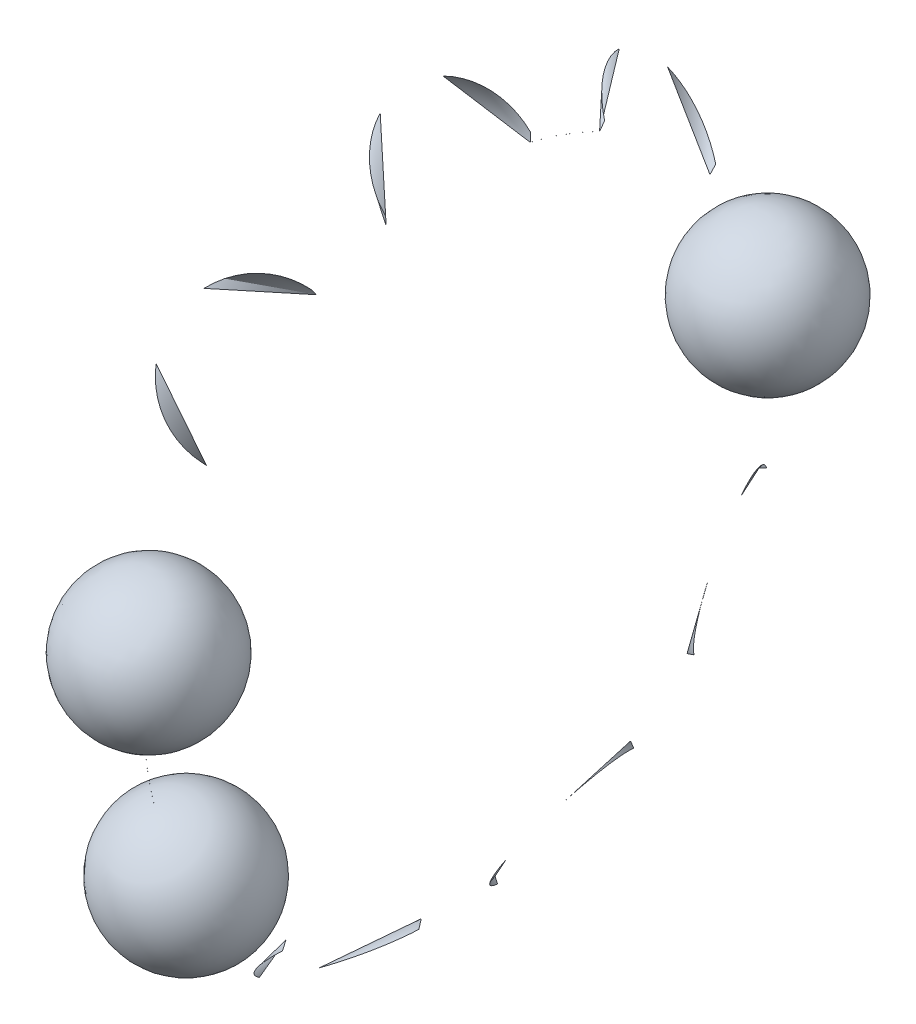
ISO-10303-21;
HEADER;
FILE_DESCRIPTION(('STEP AP214'),'2;1');
FILE_NAME('part.step','',(''),(''),'','','');
FILE_SCHEMA(('AUTOMOTIVE_DESIGN { 1 0 10303 214 1 1 1 1 }'));
ENDSEC;
DATA;
#1=APPLICATION_CONTEXT('core data for automotive mechanical design processes');
#2=APPLICATION_PROTOCOL_DEFINITION('international standard','automotive_design',2000,#1);
#3=PRODUCT_CONTEXT('',#1,'mechanical');
#4=PRODUCT('Part','Part','',(#3));
#5=PRODUCT_RELATED_PRODUCT_CATEGORY('part','',(#4));
#6=PRODUCT_DEFINITION_FORMATION('','',#4);
#7=PRODUCT_DEFINITION_CONTEXT('part definition',#1,'design');
#8=PRODUCT_DEFINITION('design','',#6,#7);
#9=PRODUCT_DEFINITION_SHAPE('','',#8);
#10=(LENGTH_UNIT() NAMED_UNIT(*) SI_UNIT(.MILLI.,.METRE.));
#11=(NAMED_UNIT(*) PLANE_ANGLE_UNIT() SI_UNIT($,.RADIAN.));
#12=(NAMED_UNIT(*) SI_UNIT($,.STERADIAN.) SOLID_ANGLE_UNIT());
#13=UNCERTAINTY_MEASURE_WITH_UNIT(LENGTH_MEASURE(1.E-05),#10,'distance_accuracy_value','');
#14=(GEOMETRIC_REPRESENTATION_CONTEXT(3) GLOBAL_UNCERTAINTY_ASSIGNED_CONTEXT((#13)) GLOBAL_UNIT_ASSIGNED_CONTEXT((#10,
#11,#12)) REPRESENTATION_CONTEXT('',''));
#15=CARTESIAN_POINT('',(0.,0.,0.));
#16=DIRECTION('',(0.,0.,1.));
#17=DIRECTION('',(1.,0.,0.));
#18=AXIS2_PLACEMENT_3D('',#15,#16,#17);
#19=CARTESIAN_POINT('',(0.,0.,0.));
#20=DIRECTION('',(1.,0.,0.));
#21=DIRECTION('',(0.,-1.,0.));
#22=AXIS2_PLACEMENT_3D('',#19,#20,#21);
#23=TOROIDAL_SURFACE('',#22,13.,0.001);
#24=CARTESIAN_POINT('',(-0.000343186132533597,7.77857497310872,-10.4172065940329));
#25=CARTESIAN_POINT('',(-0.000395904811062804,7.77856165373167,-10.41719249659));
#26=CARTESIAN_POINT('',(-0.000447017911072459,7.77854525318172,-10.4171751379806));
#27=CARTESIAN_POINT('',(-0.00054454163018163,7.77850676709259,-10.4171344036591));
#28=CARTESIAN_POINT('',(-0.000590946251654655,7.77848467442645,-10.4171110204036));
#29=CARTESIAN_POINT('',(-0.000677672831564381,7.77843547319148,-10.4170589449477));
#30=CARTESIAN_POINT('',(-0.000717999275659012,7.77840836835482,-10.4170302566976));
#31=CARTESIAN_POINT('',(-0.000791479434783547,7.77834992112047,-10.4169683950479));
#32=CARTESIAN_POINT('',(-0.000824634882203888,7.77831857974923,-10.4169352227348));
#33=CARTESIAN_POINT('',(-0.00088302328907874,7.77825238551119,-10.4168651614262));
#34=CARTESIAN_POINT('',(-0.00090821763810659,7.77821751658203,-10.4168282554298));
#35=CARTESIAN_POINT('',(-0.000949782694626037,7.77814537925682,-10.4167519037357));
#36=CARTESIAN_POINT('',(-0.000966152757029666,7.77810811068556,-10.4167124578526));
#37=CARTESIAN_POINT('',(-0.000989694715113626,7.77803199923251,-10.4166318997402));
#38=CARTESIAN_POINT('',(-0.000996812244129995,7.77799314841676,-10.416590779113));
#39=CARTESIAN_POINT('',(-0.00100147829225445,7.77791517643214,-10.4165082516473));
#40=CARTESIAN_POINT('',(-0.000999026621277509,7.77787605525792,-10.4164668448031));
#41=CARTESIAN_POINT('',(-0.000984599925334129,7.77779853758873,-10.4163847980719));
#42=CARTESIAN_POINT('',(-0.000972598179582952,7.77776014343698,-10.416344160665));
#43=CARTESIAN_POINT('',(-0.000939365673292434,7.77768528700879,-10.4162649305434));
#44=CARTESIAN_POINT('',(-0.000918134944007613,7.77764882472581,-10.4162263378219));
#45=CARTESIAN_POINT('',(-0.000867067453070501,7.77757893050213,-10.4161523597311));
#46=CARTESIAN_POINT('',(-0.000837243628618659,7.77754549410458,-10.4161169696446));
#47=CARTESIAN_POINT('',(-0.00076980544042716,7.77748255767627,-10.4160503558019));
#48=CARTESIAN_POINT('',(-0.000732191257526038,7.77745305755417,-10.4160191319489));
#49=CARTESIAN_POINT('',(-0.000650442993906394,7.77739899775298,-10.4159619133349));
#50=CARTESIAN_POINT('',(-0.000606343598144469,7.77737441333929,-10.4159358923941));
#51=CARTESIAN_POINT('',(-0.00051272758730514,7.7773307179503,-10.4158896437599));
#52=CARTESIAN_POINT('',(-0.000463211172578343,7.77731160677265,-10.4158694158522));
#53=CARTESIAN_POINT('',(-0.000360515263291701,7.77727953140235,-10.4158354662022));
#54=CARTESIAN_POINT('',(-0.000307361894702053,7.77726652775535,-10.4158217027));
#55=CARTESIAN_POINT('',(-0.00019862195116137,7.77724686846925,-10.4158008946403));
#56=CARTESIAN_POINT('',(-0.000143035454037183,7.77724021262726,-10.4157938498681));
#57=CARTESIAN_POINT('',(-3.13069222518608E-05,7.77723346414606,-10.4157867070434));
#58=CARTESIAN_POINT('',(2.48309091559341E-05,7.77723333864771,-10.4157865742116));
#59=CARTESIAN_POINT('',(0.000136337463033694,7.77723957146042,-10.4157931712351));
#60=CARTESIAN_POINT('',(0.000191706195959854,7.77724592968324,-10.415799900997));
#61=CARTESIAN_POINT('',(0.000300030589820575,7.77726492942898,-10.415820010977));
#62=CARTESIAN_POINT('',(0.000352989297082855,7.77727756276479,-10.4158333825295));
#63=CARTESIAN_POINT('',(0.000455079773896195,7.77730873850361,-10.4158663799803));
#64=CARTESIAN_POINT('',(0.000504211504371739,7.77732728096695,-10.4158860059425));
#65=CARTESIAN_POINT('',(0.000597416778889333,7.77736980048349,-10.4159310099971));
#66=CARTESIAN_POINT('',(0.000641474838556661,7.77739379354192,-10.41595640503));
#67=CARTESIAN_POINT('',(0.000723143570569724,7.77744649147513,-10.4160121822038));
#68=CARTESIAN_POINT('',(0.000760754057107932,7.77747519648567,-10.4160425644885));
#69=CARTESIAN_POINT('',(0.000828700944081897,7.777536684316,-10.4161076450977));
#70=CARTESIAN_POINT('',(0.000858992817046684,7.77756949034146,-10.4161423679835));
#71=CARTESIAN_POINT('',(0.00091118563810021,7.77763811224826,-10.4162149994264));
#72=CARTESIAN_POINT('',(0.000933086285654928,7.77767392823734,-10.4162529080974));
#73=CARTESIAN_POINT('',(0.000968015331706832,7.7777477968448,-10.4163310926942));
#74=CARTESIAN_POINT('',(0.000980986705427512,7.77778586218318,-10.4163713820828));
#75=CARTESIAN_POINT('',(0.000997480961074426,7.77786294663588,-10.4164529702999));
#76=CARTESIAN_POINT('',(0.0010010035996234,7.77790196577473,-10.4164942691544));
#77=CARTESIAN_POINT('',(0.000998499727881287,7.77798001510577,-10.4165768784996));
#78=CARTESIAN_POINT('',(0.000992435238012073,7.77801904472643,-10.4166181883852));
#79=CARTESIAN_POINT('',(0.000970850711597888,7.77809585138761,-10.4166994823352));
#80=CARTESIAN_POINT('',(0.000955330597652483,7.77813362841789,-10.4167394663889));
#81=CARTESIAN_POINT('',(0.000915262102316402,7.77820684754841,-10.4168169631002));
#82=CARTESIAN_POINT('',(0.000890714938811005,7.77824228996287,-10.4168544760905));
#83=CARTESIAN_POINT('',(0.000833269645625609,7.77830982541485,-10.4169259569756));
#84=CARTESIAN_POINT('',(0.00080037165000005,7.77834191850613,-10.4169599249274));
#85=CARTESIAN_POINT('',(0.000727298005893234,7.7784016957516,-10.4170231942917));
#86=CARTESIAN_POINT('',(0.000687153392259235,7.77842939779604,-10.4170525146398));
#87=CARTESIAN_POINT('',(0.000600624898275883,7.7784797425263,-10.4171058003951));
#88=CARTESIAN_POINT('',(0.000554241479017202,7.77850238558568,-10.4171297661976));
#89=CARTESIAN_POINT('',(0.00045687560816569,7.77854181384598,-10.417171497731));
#90=CARTESIAN_POINT('',(0.000405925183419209,7.77855863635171,-10.417189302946));
#91=CARTESIAN_POINT('',(0.000300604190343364,7.77858613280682,-10.4172184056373));
#92=CARTESIAN_POINT('',(0.000246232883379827,7.77859680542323,-10.4172297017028));
#93=CARTESIAN_POINT('',(0.000135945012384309,7.77861163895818,-10.4172454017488));
#94=CARTESIAN_POINT('',(8.00382047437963E-05,7.77861583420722,-10.4172498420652));
#95=CARTESIAN_POINT('',(-3.19576848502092E-05,7.77861769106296,-10.4172518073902));
#96=CARTESIAN_POINT('',(-8.80464546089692E-05,7.77861536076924,-10.4172493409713));
#97=CARTESIAN_POINT('',(-0.000177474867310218,7.77860640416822,-10.417239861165));
#98=CARTESIAN_POINT('',(-0.000211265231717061,7.77860177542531,-10.4172349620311));
#99=CARTESIAN_POINT('',(-0.000277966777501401,7.77859014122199,-10.4172226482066));
#100=CARTESIAN_POINT('',(-0.000310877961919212,7.77858313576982,-10.4172152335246));
#101=CARTESIAN_POINT('',(-0.000343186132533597,7.77857497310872,-10.4172065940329));
#102=B_SPLINE_CURVE_WITH_KNOTS('',3,(#24,#25,#26,#27,#28,#29,#30,#31,#32,#33,#34,#35,#36,#37,
#38,#39,#40,#41,#42,#43,#44,#45,#46,#47,#48,#49,#50,#51,#52,#53,#54,#55,#56,#57,#58,#59,#60,#61,
#62,#63,#64,#65,#66,#67,#68,#69,#70,#71,#72,#73,#74,#75,#76,#77,#78,#79,#80,#81,#82,#83,#84,#85,
#86,#87,#88,#89,#90,#91,#92,#93,#94,#95,#96,#97,#98,#99,#100,#101),.UNSPECIFIED.,.T.,.F.,(4,2,2,
2,2,2,2,2,2,2,2,2,2,2,2,2,2,2,2,2,2,2,2,2,2,2,2,2,2,2,2,2,2,2,2,2,2,2,4),(0.,
0.00016839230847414,0.000336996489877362,0.000505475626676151,0.00067391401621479,
0.000843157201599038,0.00101241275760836,0.0011826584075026,0.00135290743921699,
0.00152363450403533,0.0016943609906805,0.00186483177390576,0.00203529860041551,
0.00220488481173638,0.00237446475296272,0.00254293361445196,0.00271139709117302,
0.00287901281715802,0.00304662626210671,0.00321402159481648,0.00338141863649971,
0.0035493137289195,0.00371721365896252,0.00388611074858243,0.00405501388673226,
0.00422498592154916,0.00439496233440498,0.00456561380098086,0.00473626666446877,
0.00490689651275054,0.00507752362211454,0.00524743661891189,0.00541733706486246,
0.0055861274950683,0.00575495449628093,0.00592288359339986,0.00609060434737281,
0.00619380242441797,0.00629700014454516),.UNSPECIFIED.);
#103=CARTESIAN_POINT('',(-0.000343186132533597,7.77857497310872,-10.4172065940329));
#104=VERTEX_POINT('',#103);
#105=EDGE_CURVE('E10',#104,#104,#102,.T.);
#106=ORIENTED_EDGE('',*,*,#105,.F.);
#107=EDGE_LOOP('',(#106));
#108=FACE_BOUND('',#107,.T.);
#109=CARTESIAN_POINT('',(-0.00030095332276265,5.13228219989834,-11.9450606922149));
#110=CARTESIAN_POINT('',(-0.0002477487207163,5.13228703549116,-11.9450768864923));
#111=CARTESIAN_POINT('',(-0.000193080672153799,5.13229059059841,-11.9450887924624));
#112=CARTESIAN_POINT('',(-8.23899556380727E-05,5.13229502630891,-11.9451036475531));
#113=CARTESIAN_POINT('',(-2.636579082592E-05,5.132295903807,-11.9451065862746));
#114=CARTESIAN_POINT('',(8.53808360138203E-05,5.13229495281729,-11.9451034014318));
#115=CARTESIAN_POINT('',(0.000141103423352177,5.13229312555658,-11.9450972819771));
#116=CARTESIAN_POINT('',(0.000250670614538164,5.13228682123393,-11.9450761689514));
#117=CARTESIAN_POINT('',(0.00030451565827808,5.13228234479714,-11.9450611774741));
#118=CARTESIAN_POINT('',(0.00040884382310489,5.13227087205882,-11.9450227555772));
#119=CARTESIAN_POINT('',(0.000459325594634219,5.13226387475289,-11.9449993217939));
#120=CARTESIAN_POINT('',(0.000555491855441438,5.13224756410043,-11.944944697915));
#121=CARTESIAN_POINT('',(0.00060117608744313,5.13223825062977,-11.9449135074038));
#122=CARTESIAN_POINT('',(0.000686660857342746,5.13221753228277,-11.9448441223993));
#123=CARTESIAN_POINT('',(0.000726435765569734,5.13220611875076,-11.9448058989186));
#124=CARTESIAN_POINT('',(0.00079877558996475,5.13218155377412,-11.9447236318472));
#125=CARTESIAN_POINT('',(0.000831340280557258,5.13216840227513,-11.9446795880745));
#126=CARTESIAN_POINT('',(0.000888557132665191,5.13214064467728,-11.9445866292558));
#127=CARTESIAN_POINT('',(0.000913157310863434,5.13212602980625,-11.9445376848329));
#128=CARTESIAN_POINT('',(0.00095348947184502,5.13209583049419,-11.9444365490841));
#129=CARTESIAN_POINT('',(0.000969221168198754,5.13208024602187,-11.9443843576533));
#130=CARTESIAN_POINT('',(0.000991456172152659,5.13204845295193,-11.9442778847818));
#131=CARTESIAN_POINT('',(0.000997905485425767,5.13203224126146,-11.9442235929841));
#132=CARTESIAN_POINT('',(0.00100122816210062,5.13199973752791,-11.9441147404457));
#133=CARTESIAN_POINT('',(0.000998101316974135,5.13198344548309,-11.944060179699));
#134=CARTESIAN_POINT('',(0.000982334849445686,5.13195119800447,-11.943952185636));
#135=CARTESIAN_POINT('',(0.000969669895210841,5.13193524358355,-11.9438987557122));
#136=CARTESIAN_POINT('',(0.000935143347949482,5.13190417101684,-11.9437946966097));
#137=CARTESIAN_POINT('',(0.000913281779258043,5.13188905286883,-11.9437440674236));
#138=CARTESIAN_POINT('',(0.000861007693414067,5.13186011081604,-11.9436471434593));
#139=CARTESIAN_POINT('',(0.000830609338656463,5.13184628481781,-11.9436008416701));
#140=CARTESIAN_POINT('',(0.000762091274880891,5.13182029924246,-11.9435138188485));
#141=CARTESIAN_POINT('',(0.000723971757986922,5.13180813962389,-11.9434730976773));
#142=CARTESIAN_POINT('',(0.000641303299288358,5.1317859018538,-11.9433986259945));
#143=CARTESIAN_POINT('',(0.000596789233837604,5.13177581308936,-11.9433648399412));
#144=CARTESIAN_POINT('',(0.000502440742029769,5.13175793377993,-11.9433049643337));
#145=CARTESIAN_POINT('',(0.000452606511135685,5.13175014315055,-11.943278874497));
#146=CARTESIAN_POINT('',(0.00034938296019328,5.13173713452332,-11.9432353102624));
#147=CARTESIAN_POINT('',(0.000296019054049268,5.13173190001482,-11.9432177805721));
#148=CARTESIAN_POINT('',(0.000186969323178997,5.13172408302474,-11.9431916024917));
#149=CARTESIAN_POINT('',(0.00013128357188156,5.13172150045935,-11.9431829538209));
#150=CARTESIAN_POINT('',(1.94649613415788E-05,5.13171907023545,-11.9431748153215));
#151=CARTESIAN_POINT('',(-3.66643395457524E-05,5.13171920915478,-11.9431752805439));
#152=CARTESIAN_POINT('',(-0.000148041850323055,5.13172218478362,-11.9431852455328));
#153=CARTESIAN_POINT('',(-0.000203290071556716,5.13172502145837,-11.9431947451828));
#154=CARTESIAN_POINT('',(-0.000311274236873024,5.13173330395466,-11.9432224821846));
#155=CARTESIAN_POINT('',(-0.000364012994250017,5.13173874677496,-11.9432407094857));
#156=CARTESIAN_POINT('',(-0.000465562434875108,5.13175208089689,-11.9432853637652));
#157=CARTESIAN_POINT('',(-0.000514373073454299,5.13175997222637,-11.9433117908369));
#158=CARTESIAN_POINT('',(-0.000606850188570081,5.13177800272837,-11.9433721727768));
#159=CARTESIAN_POINT('',(-0.000650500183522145,5.13178814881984,-11.9434061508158));
#160=CARTESIAN_POINT('',(-0.000731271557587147,5.13181038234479,-11.9434806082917));
#161=CARTESIAN_POINT('',(-0.000768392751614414,5.13182246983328,-11.9435210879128));
#162=CARTESIAN_POINT('',(-0.00083529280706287,5.13184832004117,-11.9436076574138));
#163=CARTESIAN_POINT('',(-0.000865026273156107,5.13186209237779,-11.9436537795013));
#164=CARTESIAN_POINT('',(-0.000916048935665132,5.1318908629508,-11.9437501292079));
#165=CARTESIAN_POINT('',(-0.000937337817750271,5.1319058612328,-11.9438003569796));
#166=CARTESIAN_POINT('',(-0.00097100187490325,5.13193675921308,-11.9439038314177));
#167=CARTESIAN_POINT('',(-0.000983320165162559,5.13195266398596,-11.9439570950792));
#168=CARTESIAN_POINT('',(-0.000998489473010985,5.13198483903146,-11.9440648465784));
#169=CARTESIAN_POINT('',(-0.00100134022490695,5.13200110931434,-11.9441193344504));
#170=CARTESIAN_POINT('',(-0.000997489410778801,5.13203362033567,-11.9442282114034));
#171=CARTESIAN_POINT('',(-0.000990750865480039,5.1320498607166,-11.9442825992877));
#172=CARTESIAN_POINT('',(-0.000967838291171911,5.13208178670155,-11.9443895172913));
#173=CARTESIAN_POINT('',(-0.000951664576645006,5.13209747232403,-11.9444420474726));
#174=CARTESIAN_POINT('',(-0.00091033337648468,5.13212783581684,-11.9445437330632));
#175=CARTESIAN_POINT('',(-0.000885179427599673,5.13214251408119,-11.9445928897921));
#176=CARTESIAN_POINT('',(-0.000826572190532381,5.13217045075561,-11.9446864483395));
#177=CARTESIAN_POINT('',(-0.000793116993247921,5.13218370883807,-11.9447308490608));
#178=CARTESIAN_POINT('',(-0.00071899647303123,5.13220836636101,-11.9448134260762));
#179=CARTESIAN_POINT('',(-0.000678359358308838,5.13221977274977,-11.9448516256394));
#180=CARTESIAN_POINT('',(-0.000590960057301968,5.13224044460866,-11.9449208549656));
#181=CARTESIAN_POINT('',(-0.000544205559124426,5.13224971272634,-11.9449518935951));
#182=CARTESIAN_POINT('',(-0.000464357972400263,5.13226281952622,-11.9449957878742));
#183=CARTESIAN_POINT('',(-0.000432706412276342,5.13226739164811,-11.9450110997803));
#184=CARTESIAN_POINT('',(-0.0003678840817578,5.13227554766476,-11.9450384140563));
#185=CARTESIAN_POINT('',(-0.000334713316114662,5.13227913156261,-11.9450504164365));
#186=CARTESIAN_POINT('',(-0.00030095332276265,5.13228219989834,-11.9450606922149));
#187=B_SPLINE_CURVE_WITH_KNOTS('',3,(#109,#110,#111,#112,#113,#114,#115,#116,#117,#118,#119,
#120,#121,#122,#123,#124,#125,#126,#127,#128,#129,#130,#131,#132,#133,#134,#135,#136,#137,#138,
#139,#140,#141,#142,#143,#144,#145,#146,#147,#148,#149,#150,#151,#152,#153,#154,#155,#156,#157,
#158,#159,#160,#161,#162,#163,#164,#165,#166,#167,#168,#169,#170,#171,#172,#173,#174,#175,#176,
#177,#178,#179,#180,#181,#182,#183,#184,#185,#186),.UNSPECIFIED.,.T.,.F.,(4,2,2,2,2,2,2,2,2,2,2,
2,2,2,2,2,2,2,2,2,2,2,2,2,2,2,2,2,2,2,2,2,2,2,2,2,2,2,4),(0.,0.000167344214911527,
0.000334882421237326,0.00050234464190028,0.000669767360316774,0.000837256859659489,
0.00100475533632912,0.00117296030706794,0.00134117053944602,0.00151045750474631,
0.00167974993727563,0.00185002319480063,0.00202030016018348,0.00219103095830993,
0.00236176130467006,0.00253221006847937,0.00270265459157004,0.00287220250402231,
0.00304174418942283,0.00321017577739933,0.00337860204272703,0.00354619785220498,
0.00371379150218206,0.00388119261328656,0.00404859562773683,0.00421651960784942,
0.00438444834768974,0.00455338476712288,0.00472232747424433,0.00489233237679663,
0.00506234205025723,0.00523300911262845,0.0054036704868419,0.00557426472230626,
0.00574489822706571,0.00591487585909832,0.00608464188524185,0.00619082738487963,
0.00629701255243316),.UNSPECIFIED.);
#188=CARTESIAN_POINT('',(-0.00030095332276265,5.13228219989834,-11.9450606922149));
#189=VERTEX_POINT('',#188);
#190=EDGE_CURVE('E43',#189,#189,#187,.T.);
#191=ORIENTED_EDGE('',*,*,#190,.F.);
#192=EDGE_LOOP('',(#191));
#193=FACE_BOUND('',#192,.T.);
#194=ADVANCED_FACE('F14',(#108,#193),#23,.T.);
#195=CARTESIAN_POINT('',(-0.000369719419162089,-0.737317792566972,-12.9800046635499));
#196=CARTESIAN_POINT('',(-0.000421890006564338,-0.737319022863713,-12.9799837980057));
#197=CARTESIAN_POINT('',(-0.000472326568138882,-0.737320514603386,-12.9799584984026));
#198=CARTESIAN_POINT('',(-0.000568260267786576,-0.737323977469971,-12.9798997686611));
#199=CARTESIAN_POINT('',(-0.000613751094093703,-0.737325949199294,-12.9798663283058));
#200=CARTESIAN_POINT('',(-0.000698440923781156,-0.737330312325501,-12.9797923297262));
#201=CARTESIAN_POINT('',(-0.000737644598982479,-0.737332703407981,-12.9797517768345));
#202=CARTESIAN_POINT('',(-0.000808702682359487,-0.737337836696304,-12.9796647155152));
#203=CARTESIAN_POINT('',(-0.00084055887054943,-0.737340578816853,-12.9796182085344));
#204=CARTESIAN_POINT('',(-0.00089620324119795,-0.737346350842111,-12.9795203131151));
#205=CARTESIAN_POINT('',(-0.000919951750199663,-0.737349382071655,-12.9794689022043));
#206=CARTESIAN_POINT('',(-0.000958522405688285,-0.737355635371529,-12.9793628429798));
#207=CARTESIAN_POINT('',(-0.00097334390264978,-0.737358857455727,-12.979308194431));
#208=CARTESIAN_POINT('',(-0.000993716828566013,-0.737365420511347,-12.9791968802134));
#209=CARTESIAN_POINT('',(-0.000999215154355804,-0.737368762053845,-12.9791402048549));
#210=CARTESIAN_POINT('',(-0.00100062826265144,-0.737375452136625,-12.9790267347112));
#211=CARTESIAN_POINT('',(-0.000996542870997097,-0.737378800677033,-12.9789699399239));
#212=CARTESIAN_POINT('',(-0.000978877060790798,-0.737385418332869,-12.9788576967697));
#213=CARTESIAN_POINT('',(-0.000965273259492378,-0.737388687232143,-12.9788022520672));
#214=CARTESIAN_POINT('',(-0.000928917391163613,-0.737395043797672,-12.9786944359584));
#215=CARTESIAN_POINT('',(-0.000906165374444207,-0.737398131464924,-12.9786420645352));
#216=CARTESIAN_POINT('',(-0.000852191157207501,-0.737404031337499,-12.9785419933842));
#217=CARTESIAN_POINT('',(-0.000820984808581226,-0.737406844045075,-12.9784942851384));
#218=CARTESIAN_POINT('',(-0.00075095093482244,-0.737412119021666,-12.9784048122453));
#219=CARTESIAN_POINT('',(-0.000712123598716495,-0.73741458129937,-12.9783630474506));
#220=CARTESIAN_POINT('',(-0.000628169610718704,-0.73741907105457,-12.9782868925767));
#221=CARTESIAN_POINT('',(-0.000583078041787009,-0.737421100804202,-12.9782524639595));
#222=CARTESIAN_POINT('',(-0.000487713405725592,-0.737424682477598,-12.9781917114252));
#223=CARTESIAN_POINT('',(-0.000437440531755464,-0.737426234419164,-12.978165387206));
#224=CARTESIAN_POINT('',(-0.000333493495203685,-0.737428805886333,-12.9781217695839));
#225=CARTESIAN_POINT('',(-0.000279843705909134,-0.737429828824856,-12.9781044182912));
#226=CARTESIAN_POINT('',(-0.000170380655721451,-0.737431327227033,-12.9780790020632));
#227=CARTESIAN_POINT('',(-0.000114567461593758,-0.737431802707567,-12.9780709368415));
#228=CARTESIAN_POINT('',(-2.64759301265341E-06,-0.737432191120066,-12.9780643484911));
#229=CARTESIAN_POINT('',(5.34564018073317E-05,-0.737432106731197,-12.9780657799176));
#230=CARTESIAN_POINT('',(0.000164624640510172,-0.737431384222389,-12.9780780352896));
#231=CARTESIAN_POINT('',(0.000219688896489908,-0.737430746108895,-12.9780888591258));
#232=CARTESIAN_POINT('',(0.000327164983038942,-0.737428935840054,-12.9781195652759));
#233=CARTESIAN_POINT('',(0.00037957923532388,-0.73742776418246,-12.9781394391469));
#234=CARTESIAN_POINT('',(0.000480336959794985,-0.737424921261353,-12.9781876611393));
#235=CARTESIAN_POINT('',(0.00052868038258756,-0.737423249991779,-12.9782160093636));
#236=CARTESIAN_POINT('',(0.000620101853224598,-0.737419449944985,-12.9782804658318));
#237=CARTESIAN_POINT('',(0.000663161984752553,-0.737417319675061,-12.9783165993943));
#238=CARTESIAN_POINT('',(0.000742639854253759,-0.737412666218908,-12.9783955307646));
#239=CARTESIAN_POINT('',(0.00077905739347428,-0.737410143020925,-12.9784383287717));
#240=CARTESIAN_POINT('',(0.00084445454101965,-0.737404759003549,-12.9785296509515));
#241=CARTESIAN_POINT('',(0.000873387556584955,-0.737401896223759,-12.978578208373));
#242=CARTESIAN_POINT('',(0.000922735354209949,-0.737395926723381,-12.9786794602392));
#243=CARTESIAN_POINT('',(0.000943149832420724,-0.737392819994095,-12.9787321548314));
#244=CARTESIAN_POINT('',(0.00097500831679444,-0.737386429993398,-12.9788405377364));
#245=CARTESIAN_POINT('',(0.000986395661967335,-0.737383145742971,-12.9788962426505));
#246=CARTESIAN_POINT('',(0.000999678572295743,-0.737376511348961,-12.9790087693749));
#247=CARTESIAN_POINT('',(0.00100157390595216,-0.737373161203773,-12.9790655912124));
#248=CARTESIAN_POINT('',(0.000995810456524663,-0.73736647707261,-12.979178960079));
#249=CARTESIAN_POINT('',(0.000988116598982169,-0.737363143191,-12.9792355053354));
#250=CARTESIAN_POINT('',(0.000963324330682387,-0.737356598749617,-12.9793465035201));
#251=CARTESIAN_POINT('',(0.000946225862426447,-0.7373533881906,-12.9794009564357));
#252=CARTESIAN_POINT('',(0.000903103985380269,-0.73734718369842,-12.979506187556));
#253=CARTESIAN_POINT('',(0.000877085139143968,-0.737344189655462,-12.9795569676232));
#254=CARTESIAN_POINT('',(0.000816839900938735,-0.737338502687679,-12.9796534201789));
#255=CARTESIAN_POINT('',(0.000782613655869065,-0.737335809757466,-12.9796990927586));
#256=CARTESIAN_POINT('',(0.000707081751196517,-0.737330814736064,-12.9797838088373));
#257=CARTESIAN_POINT('',(0.000665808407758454,-0.73732851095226,-12.979822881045));
#258=CARTESIAN_POINT('',(0.000577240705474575,-0.737324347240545,-12.9798934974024));
#259=CARTESIAN_POINT('',(0.000529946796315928,-0.737322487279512,-12.979925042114));
#260=CARTESIAN_POINT('',(0.000431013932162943,-0.737319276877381,-12.9799794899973));
#261=CARTESIAN_POINT('',(0.000379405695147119,-0.737317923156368,-12.9800024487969));
#262=CARTESIAN_POINT('',(0.000273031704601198,-0.737315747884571,-12.9800393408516));
#263=CARTESIAN_POINT('',(0.000218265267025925,-0.73731492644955,-12.9800532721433));
#264=CARTESIAN_POINT('',(0.000107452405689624,-0.737313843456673,-12.9800716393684));
#265=CARTESIAN_POINT('',(5.14139948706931E-05,-0.737313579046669,-12.9800761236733));
#266=CARTESIAN_POINT('',(-6.05709686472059E-05,-0.737313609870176,-12.9800756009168));
#267=CARTESIAN_POINT('',(-0.000116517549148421,-0.737313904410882,-12.9800706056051));
#268=CARTESIAN_POINT('',(-0.000205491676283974,-0.737314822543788,-12.9800550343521));
#269=CARTESIAN_POINT('',(-0.000239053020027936,-0.73731527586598,-12.9800473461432));
#270=CARTESIAN_POINT('',(-0.000305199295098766,-0.737316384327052,-12.9800285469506));
#271=CARTESIAN_POINT('',(-0.000337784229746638,-0.737317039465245,-12.9800174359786));
#272=CARTESIAN_POINT('',(-0.000369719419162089,-0.737317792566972,-12.9800046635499));
#273=B_SPLINE_CURVE_WITH_KNOTS('',3,(#195,#196,#197,#198,#199,#200,#201,#202,#203,#204,#205,
#206,#207,#208,#209,#210,#211,#212,#213,#214,#215,#216,#217,#218,#219,#220,#221,#222,#223,#224,
#225,#226,#227,#228,#229,#230,#231,#232,#233,#234,#235,#236,#237,#238,#239,#240,#241,#242,#243,
#244,#245,#246,#247,#248,#249,#250,#251,#252,#253,#254,#255,#256,#257,#258,#259,#260,#261,#262,
#263,#264,#265,#266,#267,#268,#269,#270,#271,#272),.UNSPECIFIED.,.T.,.F.,(4,2,2,2,2,2,2,2,2,2,2,
2,2,2,2,2,2,2,2,2,2,2,2,2,2,2,2,2,2,2,2,2,2,2,2,2,2,2,4),(0.,0.000168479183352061,
0.000337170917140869,0.000505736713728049,0.000674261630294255,0.000843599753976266,
0.00101295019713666,0.00118326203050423,0.00135357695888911,0.00152431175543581,
0.00169504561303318,0.00186546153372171,0.00203587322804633,0.00220536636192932,
0.00237485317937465,0.0025432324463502,0.00271160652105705,0.00287917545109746,
0.00304674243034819,0.00321415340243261,0.00338156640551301,0.00354953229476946,
0.00371750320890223,0.00388649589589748,0.00405549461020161,0.00422554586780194,
0.00439560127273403,0.00456628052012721,0.00473696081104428,0.00490755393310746,
0.0050781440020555,0.00524797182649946,0.00541778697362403,0.00558648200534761,
0.00575521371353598,0.00592307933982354,0.00609073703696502,0.00619386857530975,
0.00629699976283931),.UNSPECIFIED.);
#274=CARTESIAN_POINT('',(-0.000369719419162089,-0.737317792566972,-12.9800046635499));
#275=VERTEX_POINT('',#274);
#276=EDGE_CURVE('E35',#275,#275,#273,.T.);
#277=ORIENTED_EDGE('',*,*,#276,.F.);
#278=EDGE_LOOP('',(#277));
#279=FACE_BOUND('',#278,.T.);
#280=CARTESIAN_POINT('',(-0.000433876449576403,-3.74655971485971,-12.449366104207));
#281=CARTESIAN_POINT('',(-0.000383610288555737,-3.74656938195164,-12.4493884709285));
#282=CARTESIAN_POINT('',(-0.000331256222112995,-3.74657737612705,-12.4494069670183));
#283=CARTESIAN_POINT('',(-0.000223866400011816,-3.74658977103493,-12.4494356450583));
#284=CARTESIAN_POINT('',(-0.000168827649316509,-3.74659416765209,-12.449445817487));
#285=CARTESIAN_POINT('',(-5.76859473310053E-05,-3.74659922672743,-12.449457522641));
#286=CARTESIAN_POINT('',(-1.58340336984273E-06,-3.74659989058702,-12.4494590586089));
#287=CARTESIAN_POINT('',(0.000110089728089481,-3.74659746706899,-12.4494534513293));
#288=CARTESIAN_POINT('',(0.000165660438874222,-3.74659438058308,-12.4494463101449));
#289=CARTESIAN_POINT('',(0.00027465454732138,-3.74658455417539,-12.4494235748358));
#290=CARTESIAN_POINT('',(0.000328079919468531,-3.74657781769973,-12.4494079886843));
#291=CARTESIAN_POINT('',(0.000431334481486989,-3.746560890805,-12.4493688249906));
#292=CARTESIAN_POINT('',(0.00048116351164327,-3.74655070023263,-12.4493452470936));
#293=CARTESIAN_POINT('',(0.000575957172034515,-3.7465271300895,-12.4492907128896));
#294=CARTESIAN_POINT('',(0.000620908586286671,-3.74651374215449,-12.4492597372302));
#295=CARTESIAN_POINT('',(0.000704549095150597,-3.74648417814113,-12.4491913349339));
#296=CARTESIAN_POINT('',(0.000743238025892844,-3.74646800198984,-12.4491539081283));
#297=CARTESIAN_POINT('',(0.000813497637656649,-3.74643322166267,-12.4490734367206));
#298=CARTESIAN_POINT('',(0.000845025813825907,-3.74641460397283,-12.4490303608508));
#299=CARTESIAN_POINT('',(0.000899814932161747,-3.74637554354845,-12.4489399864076));
#300=CARTESIAN_POINT('',(0.000923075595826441,-3.74635510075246,-12.448892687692));
#301=CARTESIAN_POINT('',(0.000960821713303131,-3.74631282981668,-12.4487948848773));
#302=CARTESIAN_POINT('',(0.000975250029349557,-3.74629099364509,-12.4487443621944));
#303=CARTESIAN_POINT('',(0.000994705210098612,-3.74624667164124,-12.4486418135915));
#304=CARTESIAN_POINT('',(0.000999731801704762,-3.74622418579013,-12.4485897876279));
#305=CARTESIAN_POINT('',(0.00100024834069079,-3.74617910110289,-12.4484854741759));
#306=CARTESIAN_POINT('',(0.000995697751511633,-3.74615650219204,-12.4484331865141));
#307=CARTESIAN_POINT('',(0.000977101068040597,-3.74611192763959,-12.4483300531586));
#308=CARTESIAN_POINT('',(0.000963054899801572,-3.74608995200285,-12.4482792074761));
#309=CARTESIAN_POINT('',(0.00092584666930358,-3.74604724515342,-12.4481803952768));
#310=CARTESIAN_POINT('',(0.000902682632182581,-3.74602651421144,-12.4481324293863));
#311=CARTESIAN_POINT('',(0.000847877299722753,-3.74598689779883,-12.448040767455));
#312=CARTESIAN_POINT('',(0.000816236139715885,-3.74596801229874,-12.447997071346));
#313=CARTESIAN_POINT('',(0.000745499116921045,-3.74593270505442,-12.4479153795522));
#314=CARTESIAN_POINT('',(0.000706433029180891,-3.7459162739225,-12.447877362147));
#315=CARTESIAN_POINT('',(0.000621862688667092,-3.74588626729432,-12.4478079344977));
#316=CARTESIAN_POINT('',(0.000576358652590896,-3.74587269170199,-12.4477765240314));
#317=CARTESIAN_POINT('',(0.000480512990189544,-3.74584887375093,-12.4477214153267));
#318=CARTESIAN_POINT('',(0.000430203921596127,-3.74583861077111,-12.4476976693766));
#319=CARTESIAN_POINT('',(0.000325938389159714,-3.74582160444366,-12.4476583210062));
#320=CARTESIAN_POINT('',(0.000271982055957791,-3.74581486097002,-12.4476427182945));
#321=CARTESIAN_POINT('',(0.000162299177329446,-3.74580512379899,-12.4476201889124));
#322=CARTESIAN_POINT('',(0.000106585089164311,-3.7458021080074,-12.4476132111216));
#323=CARTESIAN_POINT('',(-5.32698435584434E-06,-3.74579984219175,-12.4476079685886));
#324=CARTESIAN_POINT('',(-6.15249589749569E-05,-3.74580059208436,-12.4476097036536));
#325=CARTESIAN_POINT('',(-0.000172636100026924,-3.74580582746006,-12.447621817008));
#326=CARTESIAN_POINT('',(-0.000227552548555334,-3.74581030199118,-12.4476321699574));
#327=CARTESIAN_POINT('',(-0.000334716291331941,-3.74582284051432,-12.4476611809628));
#328=CARTESIAN_POINT('',(-0.000386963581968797,-3.7458309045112,-12.44767983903));
#329=CARTESIAN_POINT('',(-0.000487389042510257,-3.74585039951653,-12.4477249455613));
#330=CARTESIAN_POINT('',(-0.000535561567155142,-3.74586183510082,-12.4477514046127));
#331=CARTESIAN_POINT('',(-0.000626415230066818,-3.74588773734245,-12.4478113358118));
#332=CARTESIAN_POINT('',(-0.00066909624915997,-3.74590220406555,-12.4478448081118));
#333=CARTESIAN_POINT('',(-0.000747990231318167,-3.74593383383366,-12.4479179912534));
#334=CARTESIAN_POINT('',(-0.000784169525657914,-3.74595101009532,-12.4479577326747));
#335=CARTESIAN_POINT('',(-0.000848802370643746,-3.74598751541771,-12.4480421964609));
#336=CARTESIAN_POINT('',(-0.000877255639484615,-3.74600684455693,-12.4480869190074));
#337=CARTESIAN_POINT('',(-0.000925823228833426,-3.74604724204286,-12.4481803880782));
#338=CARTESIAN_POINT('',(-0.000945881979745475,-3.74606832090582,-12.4482291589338));
#339=CARTESIAN_POINT('',(-0.00097684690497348,-3.74611151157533,-12.4483290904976));
#340=CARTESIAN_POINT('',(-0.000987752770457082,-3.7461336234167,-12.4483802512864));
#341=CARTESIAN_POINT('',(-0.0010001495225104,-3.74617837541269,-12.4484837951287));
#342=CARTESIAN_POINT('',(-0.0010015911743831,-3.74620101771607,-12.4485361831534));
#343=CARTESIAN_POINT('',(-0.00099488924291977,-3.74624607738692,-12.4486404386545));
#344=CARTESIAN_POINT('',(-0.000986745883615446,-3.74626849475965,-12.4486923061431));
#345=CARTESIAN_POINT('',(-0.000961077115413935,-3.74631250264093,-12.4487941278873));
#346=CARTESIAN_POINT('',(-0.000943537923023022,-3.74633409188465,-12.4488440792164));
#347=CARTESIAN_POINT('',(-0.000899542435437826,-3.74637579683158,-12.4489405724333));
#348=CARTESIAN_POINT('',(-0.00087308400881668,-3.74639591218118,-12.448987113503));
#349=CARTESIAN_POINT('',(-0.000812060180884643,-3.7464340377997,-12.4490753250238));
#350=CARTESIAN_POINT('',(-0.00077751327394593,-3.74645205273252,-12.4491170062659));
#351=CARTESIAN_POINT('',(-0.000701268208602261,-3.74648549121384,-12.4491943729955));
#352=CARTESIAN_POINT('',(-0.000659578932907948,-3.74650091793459,-12.4492300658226));
#353=CARTESIAN_POINT('',(-0.00058688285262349,-3.74652356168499,-12.4492824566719));
#354=CARTESIAN_POINT('',(-0.000557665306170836,-3.74653169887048,-12.4493012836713));
#355=CARTESIAN_POINT('',(-0.00049720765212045,-3.74654668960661,-12.4493359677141));
#356=CARTESIAN_POINT('',(-0.000465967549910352,-3.74655354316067,-12.4493518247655));
#357=CARTESIAN_POINT('',(-0.000433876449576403,-3.74655971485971,-12.449366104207));
#358=B_SPLINE_CURVE_WITH_KNOTS('',3,(#280,#281,#282,#283,#284,#285,#286,#287,#288,#289,#290,
#291,#292,#293,#294,#295,#296,#297,#298,#299,#300,#301,#302,#303,#304,#305,#306,#307,#308,#309,
#310,#311,#312,#313,#314,#315,#316,#317,#318,#319,#320,#321,#322,#323,#324,#325,#326,#327,#328,
#329,#330,#331,#332,#333,#334,#335,#336,#337,#338,#339,#340,#341,#342,#343,#344,#345,#346,#347,
#348,#349,#350,#351,#352,#353,#354,#355,#356,#357),.UNSPECIFIED.,.T.,.F.,(4,2,2,2,2,2,2,2,2,2,2,
2,2,2,2,2,2,2,2,2,2,2,2,2,2,2,2,2,2,2,2,2,2,2,2,2,2,2,4),(0.,0.000167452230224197,
0.000335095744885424,0.000502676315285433,0.00067021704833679,0.000837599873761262,
0.00100499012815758,0.00117282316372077,0.0013406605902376,0.00150946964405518,
0.001678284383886,0.00184817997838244,0.0020180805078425,0.00218870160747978,
0.00235932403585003,0.00252998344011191,0.00270064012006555,0.00287062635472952,
0.00304060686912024,0.0032095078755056,0.00337840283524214,0.00354629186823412,
0.00371417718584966,0.00388157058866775,0.00404896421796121,0.00421658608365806,
0.00438421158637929,0.00455268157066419,0.00472115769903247,0.00489073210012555,
0.0050603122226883,0.00523077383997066,0.00540123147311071,0.00557193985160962,
0.00574268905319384,0.00591305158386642,0.00608320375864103,0.00619010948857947,
0.00629701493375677),.UNSPECIFIED.);
#359=CARTESIAN_POINT('',(-0.000433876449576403,-3.74655971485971,-12.449366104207));
#360=VERTEX_POINT('',#359);
#361=EDGE_CURVE('E74',#360,#360,#358,.T.);
#362=ORIENTED_EDGE('',*,*,#361,.F.);
#363=EDGE_LOOP('',(#362));
#364=FACE_BOUND('',#363,.T.);
#365=ADVANCED_FACE('F217',(#279,#364),#23,.T.);
#366=CARTESIAN_POINT('',(-0.000315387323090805,-8.90821627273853,-9.4693377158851));
#367=CARTESIAN_POINT('',(-0.00036862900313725,-8.9082056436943,-9.46932341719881));
#368=CARTESIAN_POINT('',(-0.000420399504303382,-8.90819231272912,-9.46930548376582));
#369=CARTESIAN_POINT('',(-0.00051948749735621,-8.90816063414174,-9.46926286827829));
#370=CARTESIAN_POINT('',(-0.000566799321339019,-8.90814228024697,-9.46923817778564));
#371=CARTESIAN_POINT('',(-0.000655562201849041,-8.90810111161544,-9.46918279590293));
#372=CARTESIAN_POINT('',(-0.000697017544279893,-8.90807830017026,-9.46915210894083));
#373=CARTESIAN_POINT('',(-0.00077294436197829,-8.90802887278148,-9.46908561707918));
#374=CARTESIAN_POINT('',(-0.000807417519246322,-8.9080022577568,-9.4690498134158));
#375=CARTESIAN_POINT('',(-0.000868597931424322,-8.9079458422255,-9.46897392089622));
#376=CARTESIAN_POINT('',(-0.000895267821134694,-8.90791602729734,-9.46893381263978));
#377=CARTESIAN_POINT('',(-0.000939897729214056,-8.90785415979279,-9.46885058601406));
#378=CARTESIAN_POINT('',(-0.000957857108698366,-8.90782210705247,-9.46880746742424));
#379=CARTESIAN_POINT('',(-0.00098466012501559,-8.90775646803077,-9.46871916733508));
#380=CARTESIAN_POINT('',(-0.000993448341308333,-8.90772287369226,-9.46867397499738));
#381=CARTESIAN_POINT('',(-0.00100147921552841,-8.90765528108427,-9.4685830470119));
#382=CARTESIAN_POINT('',(-0.00100072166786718,-8.90762128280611,-9.46853731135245));
#383=CARTESIAN_POINT('',(-0.000989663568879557,-8.90755373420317,-9.46844644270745));
#384=CARTESIAN_POINT('',(-0.000979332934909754,-8.90752018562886,-9.46840131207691));
#385=CARTESIAN_POINT('',(-0.000949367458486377,-8.90745460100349,-9.46831308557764));
#386=CARTESIAN_POINT('',(-0.000929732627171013,-8.90742256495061,-9.46826998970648));
#387=CARTESIAN_POINT('',(-0.000881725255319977,-8.90736095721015,-9.46818711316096));
#388=CARTESIAN_POINT('',(-0.00085336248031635,-8.90733138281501,-9.46814732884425));
#389=CARTESIAN_POINT('',(-0.000788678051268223,-8.90727551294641,-9.46807217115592));
#390=CARTESIAN_POINT('',(-0.00075235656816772,-8.90724921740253,-9.46803679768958));
#391=CARTESIAN_POINT('',(-0.000672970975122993,-8.90720079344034,-9.46797165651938));
#392=CARTESIAN_POINT('',(-0.00062994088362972,-8.90717864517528,-9.46794186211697));
#393=CARTESIAN_POINT('',(-0.000538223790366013,-8.90713900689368,-9.467888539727));
#394=CARTESIAN_POINT('',(-0.00048953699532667,-8.90712151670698,-9.46786501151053));
#395=CARTESIAN_POINT('',(-0.000388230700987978,-8.90709181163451,-9.46782505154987));
#396=CARTESIAN_POINT('',(-0.000335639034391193,-8.90707956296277,-9.46780857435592));
#397=CARTESIAN_POINT('',(-0.000227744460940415,-8.90706053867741,-9.46778298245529));
#398=CARTESIAN_POINT('',(-0.000172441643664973,-8.90705376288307,-9.46777386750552));
#399=CARTESIAN_POINT('',(-6.10075369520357E-05,-8.90704590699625,-9.46776329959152));
#400=CARTESIAN_POINT('',(-4.88215549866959E-06,-8.90704479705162,-9.46776180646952));
#401=CARTESIAN_POINT('',(0.000106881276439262,-8.90704822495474,-9.46776641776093));
#402=CARTESIAN_POINT('',(0.000162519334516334,-8.90705276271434,-9.46777252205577));
#403=CARTESIAN_POINT('',(0.000271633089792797,-8.90706733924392,-9.46779213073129));
#404=CARTESIAN_POINT('',(0.00032511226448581,-8.90707736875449,-9.467805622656));
#405=CARTESIAN_POINT('',(0.000428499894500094,-8.90710262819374,-9.46783960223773));
#406=CARTESIAN_POINT('',(0.000478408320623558,-8.90711785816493,-9.46786008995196));
#407=CARTESIAN_POINT('',(0.000573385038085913,-8.90715312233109,-9.46790752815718));
#408=CARTESIAN_POINT('',(0.000618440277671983,-8.90717316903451,-9.4679344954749));
#409=CARTESIAN_POINT('',(0.000702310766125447,-8.9072174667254,-9.46799408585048));
#410=CARTESIAN_POINT('',(0.000741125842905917,-8.90724171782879,-9.46802670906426));
#411=CARTESIAN_POINT('',(0.000811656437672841,-8.90729388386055,-9.46809688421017));
#412=CARTESIAN_POINT('',(0.000843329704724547,-8.90732181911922,-9.4681344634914));
#413=CARTESIAN_POINT('',(0.000898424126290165,-8.90738044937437,-9.46821333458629));
#414=CARTESIAN_POINT('',(0.000921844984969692,-8.90741114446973,-9.46825462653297));
#415=CARTESIAN_POINT('',(0.000959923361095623,-8.90747463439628,-9.46834003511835));
#416=CARTESIAN_POINT('',(0.000974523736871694,-8.90750744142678,-9.46838416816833));
#417=CARTESIAN_POINT('',(0.000994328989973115,-8.90757404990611,-9.46847377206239));
#418=CARTESIAN_POINT('',(0.000999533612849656,-8.90760785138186,-9.46851924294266));
#419=CARTESIAN_POINT('',(0.0010004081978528,-8.90767564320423,-9.46861043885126));
#420=CARTESIAN_POINT('',(0.00099603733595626,-8.90770963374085,-9.46865616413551));
#421=CARTESIAN_POINT('',(0.000977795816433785,-8.90777669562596,-9.46874637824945));
#422=CARTESIAN_POINT('',(0.000963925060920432,-8.90780976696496,-9.46879086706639));
#423=CARTESIAN_POINT('',(0.000927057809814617,-8.90787405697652,-9.46887735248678));
#424=CARTESIAN_POINT('',(0.000904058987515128,-8.90790527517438,-9.46891934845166));
#425=CARTESIAN_POINT('',(0.000849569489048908,-8.90796495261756,-9.46899962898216));
#426=CARTESIAN_POINT('',(0.00081807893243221,-8.9079934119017,-9.46903791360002));
#427=CARTESIAN_POINT('',(0.000747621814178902,-8.90804664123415,-9.46910951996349));
#428=CARTESIAN_POINT('',(0.000708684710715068,-8.908071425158,-9.46914286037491));
#429=CARTESIAN_POINT('',(0.00062435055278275,-8.90811670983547,-9.4692037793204));
#430=CARTESIAN_POINT('',(0.000578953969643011,-8.90813721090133,-9.4692313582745));
#431=CARTESIAN_POINT('',(0.000483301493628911,-8.90817320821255,-9.46927978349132));
#432=CARTESIAN_POINT('',(0.000433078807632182,-8.90818873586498,-9.4693006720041));
#433=CARTESIAN_POINT('',(0.000328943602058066,-8.90821450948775,-9.46933534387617));
#434=CARTESIAN_POINT('',(0.000275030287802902,-8.9082247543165,-9.46934912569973));
#435=CARTESIAN_POINT('',(0.000165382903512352,-8.90823961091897,-9.46936911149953));
#436=CARTESIAN_POINT('',(0.000109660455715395,-8.90824425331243,-9.46937535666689));
#437=CARTESIAN_POINT('',(-2.25133992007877E-06,-8.90824786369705,-9.46938021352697));
#438=CARTESIAN_POINT('',(-5.84400215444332E-05,-8.9082468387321,-9.46937883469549));
#439=CARTESIAN_POINT('',(-0.000148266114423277,-8.9082406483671,-9.46937050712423));
#440=CARTESIAN_POINT('',(-0.000182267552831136,-8.90823722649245,-9.469365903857));
#441=CARTESIAN_POINT('',(-0.000249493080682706,-8.90822829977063,-9.46935389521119));
#442=CARTESIAN_POINT('',(-0.000282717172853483,-8.90822279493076,-9.46934648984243));
#443=CARTESIAN_POINT('',(-0.000315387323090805,-8.90821627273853,-9.4693377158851));
#444=B_SPLINE_CURVE_WITH_KNOTS('',3,(#366,#367,#368,#369,#370,#371,#372,#373,#374,#375,#376,
#377,#378,#379,#380,#381,#382,#383,#384,#385,#386,#387,#388,#389,#390,#391,#392,#393,#394,#395,
#396,#397,#398,#399,#400,#401,#402,#403,#404,#405,#406,#407,#408,#409,#410,#411,#412,#413,#414,
#415,#416,#417,#418,#419,#420,#421,#422,#423,#424,#425,#426,#427,#428,#429,#430,#431,#432,#433,
#434,#435,#436,#437,#438,#439,#440,#441,#442,#443),.UNSPECIFIED.,.T.,.F.,(4,2,2,2,2,2,2,2,2,2,2,
2,2,2,2,2,2,2,2,2,2,2,2,2,2,2,2,2,2,2,2,2,2,2,2,2,2,2,4),(0.,0.000168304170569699,
0.000336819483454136,0.000505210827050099,0.000673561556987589,0.000842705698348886,
0.00101186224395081,0.00118203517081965,0.00135221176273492,0.00152292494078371,
0.00169363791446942,0.00186416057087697,0.0020346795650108,0.00220436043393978,
0.00237403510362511,0.00254259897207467,0.00271115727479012,0.00287882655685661,
0.00304649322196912,0.00321387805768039,0.00338126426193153,0.00354908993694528,
0.00371692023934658,0.00388571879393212,0.00405452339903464,0.00422441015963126,
0.00439430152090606,0.00456491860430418,0.00473553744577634,0.00490619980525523,
0.00507685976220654,0.00524685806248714,0.00541684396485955,0.0055857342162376,
0.0057546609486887,0.00592266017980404,0.0060904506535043,0.00619372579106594,
0.00629700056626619),.UNSPECIFIED.);
#445=CARTESIAN_POINT('',(-0.000315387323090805,-8.90821627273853,-9.4693377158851));
#446=VERTEX_POINT('',#445);
#447=EDGE_CURVE('E68',#446,#446,#444,.T.);
#448=ORIENTED_EDGE('',*,*,#447,.F.);
#449=EDGE_LOOP('',(#448));
#450=FACE_BOUND('',#449,.T.);
#451=CARTESIAN_POINT('',(-0.000424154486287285,-10.8723336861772,-7.1285276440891));
#452=CARTESIAN_POINT('',(-0.000373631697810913,-10.8723549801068,-7.12853831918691));
#453=CARTESIAN_POINT('',(-0.000321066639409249,-10.8723724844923,-7.12854709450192));
#454=CARTESIAN_POINT('',(-0.000213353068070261,-10.8723993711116,-7.12856057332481));
#455=CARTESIAN_POINT('',(-0.000158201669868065,-10.8724087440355,-7.12856527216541));
#456=CARTESIAN_POINT('',(-4.69370279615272E-05,-10.8724190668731,-7.12857044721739));
#457=CARTESIAN_POINT('',(9.17584114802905E-06,-10.8724200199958,-7.12857092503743));
#458=CARTESIAN_POINT('',(0.000120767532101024,-10.872413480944,-7.12856764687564));
#459=CARTESIAN_POINT('',(0.000176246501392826,-10.8724059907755,-7.12856389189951));
#460=CARTESIAN_POINT('',(0.000284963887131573,-10.8723828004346,-7.12855226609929));
#461=CARTESIAN_POINT('',(0.000338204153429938,-10.8723671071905,-7.12854439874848));
#462=CARTESIAN_POINT('',(0.00044099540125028,-10.8723279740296,-7.12852478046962));
#463=CARTESIAN_POINT('',(0.000490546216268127,-10.8723045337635,-7.12851302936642));
#464=CARTESIAN_POINT('',(0.000584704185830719,-10.872250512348,-7.12848594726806));
#465=CARTESIAN_POINT('',(0.000629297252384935,-10.8722199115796,-7.12847060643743));
#466=CARTESIAN_POINT('',(0.000712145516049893,-10.8721524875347,-7.12843680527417));
#467=CARTESIAN_POINT('',(0.000750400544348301,-10.8721156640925,-7.12841834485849));
#468=CARTESIAN_POINT('',(0.000819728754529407,-10.8720366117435,-7.12837871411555));
#469=CARTESIAN_POINT('',(0.00085075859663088,-10.871994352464,-7.12835752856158));
#470=CARTESIAN_POINT('',(0.000904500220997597,-10.8719058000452,-7.12831313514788));
#471=CARTESIAN_POINT('',(0.000927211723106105,-10.8718595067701,-7.12828992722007));
#472=CARTESIAN_POINT('',(0.000963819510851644,-10.8717638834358,-7.12824198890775));
#473=CARTESIAN_POINT('',(0.000977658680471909,-10.8717145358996,-7.12821724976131));
#474=CARTESIAN_POINT('',(0.000995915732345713,-10.8716144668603,-7.12816708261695));
#475=CARTESIAN_POINT('',(0.00100033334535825,-10.8715637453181,-7.12814165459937));
#476=CARTESIAN_POINT('',(0.000999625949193,-10.871462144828,-7.12809071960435));
#477=CARTESIAN_POINT('',(0.00099446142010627,-10.8714112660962,-7.12806521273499));
#478=CARTESIAN_POINT('',(0.00097465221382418,-10.8713110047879,-7.12801494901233));
#479=CARTESIAN_POINT('',(0.000960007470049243,-10.8712616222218,-7.12799019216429));
#480=CARTESIAN_POINT('',(0.000921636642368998,-10.8711657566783,-7.12794213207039));
#481=CARTESIAN_POINT('',(0.000897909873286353,-10.8711192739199,-7.12791882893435));
#482=CARTESIAN_POINT('',(0.000842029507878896,-10.871030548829,-7.12787434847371));
#483=CARTESIAN_POINT('',(0.000809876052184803,-10.8709883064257,-7.12785317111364));
#484=CARTESIAN_POINT('',(0.000738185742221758,-10.8709094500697,-7.12781363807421));
#485=CARTESIAN_POINT('',(0.000698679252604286,-10.87087281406,-7.12779527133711));
#486=CARTESIAN_POINT('',(0.00061330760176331,-10.8708060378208,-7.12776179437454));
#487=CARTESIAN_POINT('',(0.000567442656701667,-10.8707758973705,-7.1277466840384));
#488=CARTESIAN_POINT('',(0.000470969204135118,-10.8707231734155,-7.12772025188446));
#489=CARTESIAN_POINT('',(0.000420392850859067,-10.8707005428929,-7.12770890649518));
#490=CARTESIAN_POINT('',(0.000315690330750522,-10.8706632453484,-7.12769020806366));
#491=CARTESIAN_POINT('',(0.000261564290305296,-10.8706485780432,-7.12768285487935));
#492=CARTESIAN_POINT('',(0.000151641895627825,-10.8706277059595,-7.12767239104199));
#493=CARTESIAN_POINT('',(9.58572693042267E-05,-10.8706214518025,-7.1276692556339));
#494=CARTESIAN_POINT('',(-1.60929312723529E-05,-10.8706174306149,-7.12766723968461));
#495=CARTESIAN_POINT('',(-7.22584973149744E-05,-10.8706196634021,-7.127668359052));
#496=CARTESIAN_POINT('',(-0.000183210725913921,-10.8706325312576,-7.12767481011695));
#497=CARTESIAN_POINT('',(-0.000238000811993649,-10.8706431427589,-7.12768012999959));
#498=CARTESIAN_POINT('',(-0.000344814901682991,-10.8706724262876,-7.12769481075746));
#499=CARTESIAN_POINT('',(-0.000396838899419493,-10.8706910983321,-7.12770417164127));
#500=CARTESIAN_POINT('',(-0.000496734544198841,-10.8707359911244,-7.12772667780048));
#501=CARTESIAN_POINT('',(-0.000544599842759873,-10.8707622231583,-7.12773982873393));
#502=CARTESIAN_POINT('',(-0.000634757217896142,-10.8708214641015,-7.1277695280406));
#503=CARTESIAN_POINT('',(-0.0006770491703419,-10.8708544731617,-7.12778607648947));
#504=CARTESIAN_POINT('',(-0.000755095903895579,-10.8709265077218,-7.12782218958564));
#505=CARTESIAN_POINT('',(-0.000790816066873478,-10.8709655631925,-7.12784176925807));
#506=CARTESIAN_POINT('',(-0.000854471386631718,-10.8710484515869,-7.1278833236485));
#507=CARTESIAN_POINT('',(-0.000882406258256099,-10.8710922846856,-7.12790529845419));
#508=CARTESIAN_POINT('',(-0.000929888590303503,-10.8711837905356,-7.12795117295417));
#509=CARTESIAN_POINT('',(-0.000949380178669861,-10.8712314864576,-7.12797508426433));
#510=CARTESIAN_POINT('',(-0.000979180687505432,-10.8713291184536,-7.12802402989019));
#511=CARTESIAN_POINT('',(-0.000989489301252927,-10.8713790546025,-7.12804906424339));
#512=CARTESIAN_POINT('',(-0.00100067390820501,-10.8714800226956,-7.12809968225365));
#513=CARTESIAN_POINT('',(-0.00100150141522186,-10.8715310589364,-7.12812526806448));
#514=CARTESIAN_POINT('',(-0.000993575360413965,-10.8716325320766,-7.12817613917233));
#515=CARTESIAN_POINT('',(-0.000984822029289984,-10.8716829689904,-7.12820142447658));
#516=CARTESIAN_POINT('',(-0.000957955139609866,-10.8717818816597,-7.12825101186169));
#517=CARTESIAN_POINT('',(-0.000939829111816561,-10.8718303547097,-7.12827531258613));
#518=CARTESIAN_POINT('',(-0.000894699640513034,-10.8719238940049,-7.1283222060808));
#519=CARTESIAN_POINT('',(-0.000867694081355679,-10.8719689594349,-7.12834479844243));
#520=CARTESIAN_POINT('',(-0.000805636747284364,-10.872054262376,-7.12838756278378));
#521=CARTESIAN_POINT('',(-0.000770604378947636,-10.8720945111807,-7.12840774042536));
#522=CARTESIAN_POINT('',(-0.000693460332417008,-10.8721691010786,-7.12844513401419));
#523=CARTESIAN_POINT('',(-0.000651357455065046,-10.8722034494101,-7.12846235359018));
#524=CARTESIAN_POINT('',(-0.000578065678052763,-10.8722537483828,-7.12848756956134));
#525=CARTESIAN_POINT('',(-0.00054864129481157,-10.8722717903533,-7.12849661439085));
#526=CARTESIAN_POINT('',(-0.000487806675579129,-10.8723049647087,-7.12851324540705));
#527=CARTESIAN_POINT('',(-0.000456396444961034,-10.8723200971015,-7.12852083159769));
#528=CARTESIAN_POINT('',(-0.000424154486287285,-10.8723336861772,-7.1285276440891));
#529=B_SPLINE_CURVE_WITH_KNOTS('',3,(#451,#452,#453,#454,#455,#456,#457,#458,#459,#460,#461,
#462,#463,#464,#465,#466,#467,#468,#469,#470,#471,#472,#473,#474,#475,#476,#477,#478,#479,#480,
#481,#482,#483,#484,#485,#486,#487,#488,#489,#490,#491,#492,#493,#494,#495,#496,#497,#498,#499,
#500,#501,#502,#503,#504,#505,#506,#507,#508,#509,#510,#511,#512,#513,#514,#515,#516,#517,#518,
#519,#520,#521,#522,#523,#524,#525,#526,#527,#528),.UNSPECIFIED.,.T.,.F.,(4,2,2,2,2,2,2,2,2,2,2,
2,2,2,2,2,2,2,2,2,2,2,2,2,2,2,2,2,2,2,2,2,2,2,2,2,2,2,4),(0.,0.00016743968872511,
0.000335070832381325,0.000502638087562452,0.000670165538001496,0.000837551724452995,
0.00100494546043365,0.00117280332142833,0.00134066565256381,0.00150951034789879,
0.00167836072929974,0.00184828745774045,0.00201821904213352,0.00218885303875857,
0.0023594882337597,0.00253013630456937,0.00270078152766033,0.00287073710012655,
0.00304068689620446,0.00320955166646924,0.00337841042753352,0.00354627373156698,
0.00371413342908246,0.00388152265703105,0.00404891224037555,0.00421655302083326,
0.00438419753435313,0.00455270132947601,0.0047212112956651,0.00489081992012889,
0.00506043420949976,0.00523091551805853,0.00540139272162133,0.00557209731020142,
0.00574284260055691,0.00591317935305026,0.00608330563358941,0.00619016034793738,
0.00629701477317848),.UNSPECIFIED.);
#530=CARTESIAN_POINT('',(-0.000424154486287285,-10.8723336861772,-7.1285276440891));
#531=VERTEX_POINT('',#530);
#532=EDGE_CURVE('E80',#531,#531,#529,.T.);
#533=ORIENTED_EDGE('',*,*,#532,.F.);
#534=EDGE_LOOP('',(#533));
#535=FACE_BOUND('',#534,.T.);
#536=ADVANCED_FACE('F222',(#450,#535),#23,.T.);
#537=CARTESIAN_POINT('',(-0.000974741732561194,11.6087037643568,-5.8508281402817));
#538=CARTESIAN_POINT('',(-0.000987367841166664,11.6087500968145,-5.85085866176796));
#539=CARTESIAN_POINT('',(-0.000995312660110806,11.6087973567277,-5.85088979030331));
#540=CARTESIAN_POINT('',(-0.00100160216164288,11.6088923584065,-5.85095236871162));
#541=CARTESIAN_POINT('',(-0.000999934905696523,11.6089401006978,-5.85098381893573));
#542=CARTESIAN_POINT('',(-0.000987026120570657,11.6090346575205,-5.85104610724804));
#543=CARTESIAN_POINT('',(-0.000975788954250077,11.6090814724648,-5.85107694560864));
#544=CARTESIAN_POINT('',(-0.000944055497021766,11.6091728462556,-5.85113713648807));
#545=CARTESIAN_POINT('',(-0.000923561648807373,11.6092174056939,-5.85116648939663));
#546=CARTESIAN_POINT('',(-0.000873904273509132,11.6093029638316,-5.85122284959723));
#547=CARTESIAN_POINT('',(-0.000844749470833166,11.609343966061,-5.85124985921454));
#548=CARTESIAN_POINT('',(-0.000778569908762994,11.6094212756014,-5.85130078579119));
#549=CARTESIAN_POINT('',(-0.000741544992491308,11.6094575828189,-5.85132470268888));
#550=CARTESIAN_POINT('',(-0.000660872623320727,11.6095242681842,-5.85136863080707));
#551=CARTESIAN_POINT('',(-0.000617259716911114,11.6095546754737,-5.85138866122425));
#552=CARTESIAN_POINT('',(-0.00052450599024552,11.609608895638,-5.85142437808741));
#553=CARTESIAN_POINT('',(-0.000475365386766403,11.6096327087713,-5.85144006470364));
#554=CARTESIAN_POINT('',(-0.000373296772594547,11.6096729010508,-5.85146654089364));
#555=CARTESIAN_POINT('',(-0.000320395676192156,11.6096893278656,-5.85147736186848));
#556=CARTESIAN_POINT('',(-0.00021203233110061,11.6097144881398,-5.85149393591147));
#557=CARTESIAN_POINT('',(-0.000156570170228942,11.6097232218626,-5.85149968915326));
#558=CARTESIAN_POINT('',(-4.49649051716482E-05,11.6097327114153,-5.85150594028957));
#559=CARTESIAN_POINT('',(1.11732280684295E-05,11.6097335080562,-5.85150646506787));
#560=CARTESIAN_POINT('',(0.000122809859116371,11.6097272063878,-5.85150231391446));
#561=CARTESIAN_POINT('',(0.000178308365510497,11.6097201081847,-5.85149763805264));
#562=CARTESIAN_POINT('',(0.000287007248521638,11.609698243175,-5.85148323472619));
#563=CARTESIAN_POINT('',(0.000340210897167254,11.6096834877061,-5.85147351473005));
#564=CARTESIAN_POINT('',(0.000442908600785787,11.6096467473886,-5.8514493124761));
#565=CARTESIAN_POINT('',(0.000492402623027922,11.6096247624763,-5.85143483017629));
#566=CARTESIAN_POINT('',(0.00058643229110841,11.6095741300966,-5.85140147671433));
#567=CARTESIAN_POINT('',(0.000630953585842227,11.609545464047,-5.85138259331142));
#568=CARTESIAN_POINT('',(0.000713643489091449,11.6094823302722,-5.85134100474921));
#569=CARTESIAN_POINT('',(0.000751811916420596,11.6094478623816,-5.85131829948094));
#570=CARTESIAN_POINT('',(0.000820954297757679,11.6093738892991,-5.8512695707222));
#571=CARTESIAN_POINT('',(0.000851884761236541,11.60933435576,-5.85124352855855));
#572=CARTESIAN_POINT('',(0.000905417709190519,11.6092515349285,-5.85118897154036));
#573=CARTESIAN_POINT('',(0.000928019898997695,11.6092082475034,-5.85116045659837));
#574=CARTESIAN_POINT('',(0.000964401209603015,11.6091188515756,-5.85110156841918));
#575=CARTESIAN_POINT('',(0.00097812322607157,11.6090727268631,-5.85107118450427));
#576=CARTESIAN_POINT('',(0.000996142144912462,11.6089792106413,-5.85100958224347));
#577=CARTESIAN_POINT('',(0.00100043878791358,11.6089318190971,-5.85097836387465));
#578=CARTESIAN_POINT('',(0.000999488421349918,11.6088369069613,-5.85091584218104));
#579=CARTESIAN_POINT('',(0.000994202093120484,11.6087893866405,-5.85088453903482));
#580=CARTESIAN_POINT('',(0.000974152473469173,11.608695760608,-5.85082286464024));
#581=CARTESIAN_POINT('',(0.000959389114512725,11.6086496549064,-5.85079249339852));
#582=CARTESIAN_POINT('',(0.000920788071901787,11.6085601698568,-5.85073354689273));
#583=CARTESIAN_POINT('',(0.000896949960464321,11.6085167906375,-5.8507049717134));
#584=CARTESIAN_POINT('',(0.000840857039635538,11.6084340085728,-5.85065044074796));
#585=CARTESIAN_POINT('',(0.000808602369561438,11.6083946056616,-5.85062448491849));
#586=CARTESIAN_POINT('',(0.000736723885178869,11.6083210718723,-5.85057604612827));
#587=CARTESIAN_POINT('',(0.000697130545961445,11.6082869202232,-5.85055354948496));
#588=CARTESIAN_POINT('',(0.000611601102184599,11.6082246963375,-5.85051256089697));
#589=CARTESIAN_POINT('',(0.00056566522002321,11.6081966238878,-5.85049406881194));
#590=CARTESIAN_POINT('',(0.000469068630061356,11.6081475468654,-5.85046174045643));
#591=CARTESIAN_POINT('',(0.000418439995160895,11.6081264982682,-5.85044787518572));
#592=CARTESIAN_POINT('',(0.000313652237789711,11.6080918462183,-5.85042504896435));
#593=CARTESIAN_POINT('',(0.000259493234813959,11.6080782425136,-5.85041608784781));
#594=CARTESIAN_POINT('',(0.000149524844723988,11.6080589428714,-5.85040337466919));
#595=CARTESIAN_POINT('',(9.3727045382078E-05,11.6080532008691,-5.85039959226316));
#596=CARTESIAN_POINT('',(-1.82292025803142E-05,11.6080496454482,-5.85039725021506));
#597=CARTESIAN_POINT('',(-7.43876443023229E-05,11.6080518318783,-5.85039869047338));
#598=CARTESIAN_POINT('',(-0.000185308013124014,11.6080640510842,-5.85040673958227));
#599=CARTESIAN_POINT('',(-0.000240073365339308,11.6080740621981,-5.85041333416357));
#600=CARTESIAN_POINT('',(-0.000346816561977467,11.608101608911,-5.85043147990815));
#601=CARTESIAN_POINT('',(-0.000398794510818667,11.6081191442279,-5.85044303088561));
#602=CARTESIAN_POINT('',(-0.000498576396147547,11.6081612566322,-5.85047077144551));
#603=CARTESIAN_POINT('',(-0.000546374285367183,11.6081858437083,-5.85048696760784));
#604=CARTESIAN_POINT('',(-0.000636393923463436,11.6082413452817,-5.85052352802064));
#605=CARTESIAN_POINT('',(-0.000678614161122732,11.608272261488,-5.85054389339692));
#606=CARTESIAN_POINT('',(-0.000756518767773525,11.6083397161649,-5.85058832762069));
#607=CARTESIAN_POINT('',(-0.00079216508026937,11.6083762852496,-5.8506124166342));
#608=CARTESIAN_POINT('',(-0.000855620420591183,11.6084538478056,-5.8506635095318));
#609=CARTESIAN_POINT('',(-0.000883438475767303,11.6084948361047,-5.85069051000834));
#610=CARTESIAN_POINT('',(-0.000921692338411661,11.60856408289,-5.85073612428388));
#611=CARTESIAN_POINT('',(-0.000934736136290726,11.6085913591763,-5.85075409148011));
#612=CARTESIAN_POINT('',(-0.000957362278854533,11.6086468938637,-5.8507906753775));
#613=CARTESIAN_POINT('',(-0.000966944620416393,11.6086751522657,-5.85080929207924));
#614=CARTESIAN_POINT('',(-0.000974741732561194,11.6087037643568,-5.8508281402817));
#615=B_SPLINE_CURVE_WITH_KNOTS('',3,(#537,#538,#539,#540,#541,#542,#543,#544,#545,#546,#547,
#548,#549,#550,#551,#552,#553,#554,#555,#556,#557,#558,#559,#560,#561,#562,#563,#564,#565,#566,
#567,#568,#569,#570,#571,#572,#573,#574,#575,#576,#577,#578,#579,#580,#581,#582,#583,#584,#585,
#586,#587,#588,#589,#590,#591,#592,#593,#594,#595,#596,#597,#598,#599,#600,#601,#602,#603,#604,
#605,#606,#607,#608,#609,#610,#611,#612,#613,#614),.UNSPECIFIED.,.T.,.F.,(4,2,2,2,2,2,2,2,2,2,2,
2,2,2,2,2,2,2,2,2,2,2,2,2,2,2,2,2,2,2,2,2,2,2,2,2,2,2,4),(0.,0.000170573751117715,
0.000341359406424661,0.000512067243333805,0.000682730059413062,0.000853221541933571,
0.00102371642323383,0.0011933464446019,0.001362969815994,0.00153148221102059,
0.00169998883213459,0.00186762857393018,0.0020352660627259,0.00220265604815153,
0.00237004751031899,0.00253791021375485,0.00270577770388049,0.00287462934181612,
0.00304348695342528,0.0032134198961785,0.00338335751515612,0.00355399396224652,
0.00372463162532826,0.00389527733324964,0.00406592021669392,0.00423586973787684,
0.00440581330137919,0.00457467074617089,0.00474352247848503,0.00491138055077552,
0.00507923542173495,0.00524662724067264,0.00541401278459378,0.00558163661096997,
0.00574930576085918,0.0059179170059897,0.00608633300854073,0.00619166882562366,
0.00629700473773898),.UNSPECIFIED.);
#616=CARTESIAN_POINT('',(-0.000974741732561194,11.6087037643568,-5.8508281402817));
#617=VERTEX_POINT('',#616);
#618=EDGE_CURVE('E26',#617,#617,#615,.T.);
#619=ORIENTED_EDGE('',*,*,#618,.F.);
#620=EDGE_LOOP('',(#619));
#621=FACE_BOUND('',#620,.T.);
#622=CARTESIAN_POINT('',(-0.000376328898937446,12.6529197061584,-2.97985488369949));
#623=CARTESIAN_POINT('',(-0.000324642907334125,12.6528987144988,-2.97985244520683));
#624=CARTESIAN_POINT('',(-0.000271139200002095,12.652882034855,-2.97985050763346));
#625=CARTESIAN_POINT('',(-0.000162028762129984,12.6528578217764,-2.97984769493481));
#626=CARTESIAN_POINT('',(-0.000106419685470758,12.6528502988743,-2.97984682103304));
#627=CARTESIAN_POINT('',(5.26264696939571E-06,12.6528446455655,-2.97984616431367));
#628=CARTESIAN_POINT('',(6.13357035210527E-05,12.652846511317,-2.9798463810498));
#629=CARTESIAN_POINT('',(0.000172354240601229,12.6528595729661,-2.97984789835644));
#630=CARTESIAN_POINT('',(0.000227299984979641,12.6528707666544,-2.9798491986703));
#631=CARTESIAN_POINT('',(0.000334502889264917,12.6529021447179,-2.97985284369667));
#632=CARTESIAN_POINT('',(0.000386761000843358,12.652922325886,-2.97985518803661));
#633=CARTESIAN_POINT('',(0.000487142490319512,12.6529710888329,-2.97986085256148));
#634=CARTESIAN_POINT('',(0.000535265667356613,12.6529996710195,-2.97986417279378));
#635=CARTESIAN_POINT('',(0.000626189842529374,12.6530645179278,-2.97987170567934));
#636=CARTESIAN_POINT('',(0.000668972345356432,12.6531008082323,-2.97987592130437));
#637=CARTESIAN_POINT('',(0.000747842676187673,12.6531799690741,-2.97988511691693));
#638=CARTESIAN_POINT('',(0.000783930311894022,12.6532228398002,-2.97989009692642));
#639=CARTESIAN_POINT('',(0.000848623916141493,12.6533142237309,-2.97990071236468));
#640=CARTESIAN_POINT('',(0.000877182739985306,12.6533627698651,-2.97990635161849));
#641=CARTESIAN_POINT('',(0.000925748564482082,12.6534639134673,-2.97991810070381));
#642=CARTESIAN_POINT('',(0.000945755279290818,12.6535165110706,-2.97992421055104));
#643=CARTESIAN_POINT('',(0.000976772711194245,12.6536246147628,-2.97993676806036));
#644=CARTESIAN_POINT('',(0.000987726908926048,12.6536801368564,-2.97994321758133));
#645=CARTESIAN_POINT('',(0.00100013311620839,12.6537922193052,-2.97995623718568));
#646=CARTESIAN_POINT('',(0.00100158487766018,12.6538487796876,-2.97996280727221));
#647=CARTESIAN_POINT('',(0.00099493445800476,12.6539615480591,-2.97997590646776));
#648=CARTESIAN_POINT('',(0.000986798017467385,12.6540177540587,-2.97998243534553));
#649=CARTESIAN_POINT('',(0.000961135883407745,12.6541280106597,-2.97999524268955));
#650=CARTESIAN_POINT('',(0.000943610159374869,12.6541820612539,-2.98000152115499));
#651=CARTESIAN_POINT('',(0.00089966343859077,12.6542864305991,-2.98001364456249));
#652=CARTESIAN_POINT('',(0.000873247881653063,12.6543367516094,-2.980019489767));
#653=CARTESIAN_POINT('',(0.000812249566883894,12.654432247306,-2.98003058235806));
#654=CARTESIAN_POINT('',(0.000777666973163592,12.6544774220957,-2.9800358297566));
#655=CARTESIAN_POINT('',(0.000701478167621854,12.6545611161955,-2.98004555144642));
#656=CARTESIAN_POINT('',(0.000659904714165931,12.654599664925,-2.9800500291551));
#657=CARTESIAN_POINT('',(0.00057079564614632,12.6546692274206,-2.98005810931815));
#658=CARTESIAN_POINT('',(0.000523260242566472,12.6547002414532,-2.98006171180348));
#659=CARTESIAN_POINT('',(0.000423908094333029,12.6547536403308,-2.98006791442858));
#660=CARTESIAN_POINT('',(0.000372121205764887,12.6547760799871,-2.98007052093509));
#661=CARTESIAN_POINT('',(0.00026547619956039,12.6548119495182,-2.98007468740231));
#662=CARTESIAN_POINT('',(0.000210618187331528,12.6548253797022,-2.98007624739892));
#663=CARTESIAN_POINT('',(9.97157805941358E-05,12.6548427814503,-2.98007826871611));
#664=CARTESIAN_POINT('',(4.36796795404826E-05,12.654846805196,-2.98007873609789));
#665=CARTESIAN_POINT('',(-6.82744457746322E-05,12.654845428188,-2.98007857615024));
#666=CARTESIAN_POINT('',(-0.000124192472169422,12.6548400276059,-2.98007794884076));
#667=CARTESIAN_POINT('',(-0.000234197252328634,12.6548199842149,-2.98007562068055));
#668=CARTESIAN_POINT('',(-0.000288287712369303,12.6548053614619,-2.98007392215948));
#669=CARTESIAN_POINT('',(-0.000393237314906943,12.6547673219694,-2.98006950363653));
#670=CARTESIAN_POINT('',(-0.000444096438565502,12.6547439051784,-2.98006678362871));
#671=CARTESIAN_POINT('',(-0.000541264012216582,12.6546889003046,-2.98006039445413));
#672=CARTESIAN_POINT('',(-0.000587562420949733,12.6546572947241,-2.98005672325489));
#673=CARTESIAN_POINT('',(-0.00067419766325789,12.6545868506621,-2.98004854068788));
#674=CARTESIAN_POINT('',(-0.000714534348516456,12.6545480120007,-2.98004402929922));
#675=CARTESIAN_POINT('',(-0.000788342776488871,12.6544639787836,-2.98003426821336));
#676=CARTESIAN_POINT('',(-0.000821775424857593,12.6544187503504,-2.98002901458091));
#677=CARTESIAN_POINT('',(-0.000880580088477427,12.6543233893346,-2.98001793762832));
#678=CARTESIAN_POINT('',(-0.000905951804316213,12.6542732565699,-2.98001211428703));
#679=CARTESIAN_POINT('',(-0.000948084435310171,12.6541691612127,-2.98000002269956));
#680=CARTESIAN_POINT('',(-0.000964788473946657,12.6541151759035,-2.97999375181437));
#681=CARTESIAN_POINT('',(-0.000988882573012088,12.6540051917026,-2.97998097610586));
#682=CARTESIAN_POINT('',(-0.000996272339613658,12.6539491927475,-2.97997447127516));
#683=CARTESIAN_POINT('',(-0.0010015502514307,12.6538364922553,-2.97996137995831));
#684=CARTESIAN_POINT('',(-0.000999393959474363,12.6537797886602,-2.9799547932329));
#685=CARTESIAN_POINT('',(-0.000985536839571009,12.6536675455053,-2.97994175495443));
#686=CARTESIAN_POINT('',(-0.000973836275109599,12.6536120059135,-2.97993530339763));
#687=CARTESIAN_POINT('',(-0.000941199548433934,12.6535036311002,-2.97992271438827));
#688=CARTESIAN_POINT('',(-0.000920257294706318,12.6534507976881,-2.97991657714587));
#689=CARTESIAN_POINT('',(-0.000869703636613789,12.6533493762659,-2.97990479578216));
#690=CARTESIAN_POINT('',(-0.000840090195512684,12.6533007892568,-2.9798991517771));
#691=CARTESIAN_POINT('',(-0.000773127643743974,12.6532094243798,-2.97988853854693));
#692=CARTESIAN_POINT('',(-0.000735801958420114,12.6531666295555,-2.97988356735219));
#693=CARTESIAN_POINT('',(-0.000654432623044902,12.6530879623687,-2.97987442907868));
#694=CARTESIAN_POINT('',(-0.0006103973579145,12.6530520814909,-2.97987026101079));
#695=CARTESIAN_POINT('',(-0.000534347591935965,12.653000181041,-2.97986423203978));
#696=CARTESIAN_POINT('',(-0.000503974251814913,12.6529817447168,-2.97986209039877));
#697=CARTESIAN_POINT('',(-0.000441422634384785,12.6529481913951,-2.97985819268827));
#698=CARTESIAN_POINT('',(-0.000409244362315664,12.6529330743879,-2.97985643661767));
#699=CARTESIAN_POINT('',(-0.000376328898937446,12.6529197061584,-2.97985488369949));
#700=B_SPLINE_CURVE_WITH_KNOTS('',3,(#622,#623,#624,#625,#626,#627,#628,#629,#630,#631,#632,
#633,#634,#635,#636,#637,#638,#639,#640,#641,#642,#643,#644,#645,#646,#647,#648,#649,#650,#651,
#652,#653,#654,#655,#656,#657,#658,#659,#660,#661,#662,#663,#664,#665,#666,#667,#668,#669,#670,
#671,#672,#673,#674,#675,#676,#677,#678,#679,#680,#681,#682,#683,#684,#685,#686,#687,#688,#689,
#690,#691,#692,#693,#694,#695,#696,#697,#698,#699),.UNSPECIFIED.,.T.,.F.,(4,2,2,2,2,2,2,2,2,2,2,
2,2,2,2,2,2,2,2,2,2,2,2,2,2,2,2,2,2,2,2,2,2,2,2,2,2,2,4),(0.,0.000167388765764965,
0.000334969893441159,0.000502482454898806,0.000669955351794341,0.000837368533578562,
0.00100478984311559,0.00117277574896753,0.00134076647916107,0.00150978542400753,
0.00167881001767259,0.00184888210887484,0.00201895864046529,0.00218964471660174,
0.00236033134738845,0.00253091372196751,0.00270149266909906,0.00287129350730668,
0.00304108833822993,0.00320977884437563,0.00337846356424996,0.00354621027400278,
0.00371395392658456,0.00388133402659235,0.00404871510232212,0.00421645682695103,
0.00438420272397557,0.00455287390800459,0.00472155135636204,0.00489132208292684,
0.00506109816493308,0.00523166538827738,0.00540222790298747,0.00557290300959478,
0.00574361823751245,0.00591382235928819,0.00608381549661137,0.00619041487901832,
0.00629701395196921),.UNSPECIFIED.);
#701=CARTESIAN_POINT('',(-0.000376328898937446,12.6529197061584,-2.97985488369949));
#702=VERTEX_POINT('',#701);
#703=EDGE_CURVE('E182',#702,#702,#700,.T.);
#704=ORIENTED_EDGE('',*,*,#703,.F.);
#705=EDGE_LOOP('',(#704));
#706=FACE_BOUND('',#705,.T.);
#707=ADVANCED_FACE('F230',(#621,#706),#23,.T.);
#708=CARTESIAN_POINT('',(-0.000443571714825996,-12.9108108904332,-1.52783021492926));
#709=CARTESIAN_POINT('',(-0.000493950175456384,-12.9107864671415,-1.52782440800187));
#710=CARTESIAN_POINT('',(-0.000542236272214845,-12.9107578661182,-1.52781760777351));
#711=CARTESIAN_POINT('',(-0.000633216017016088,-12.9106931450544,-1.52780221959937));
#712=CARTESIAN_POINT('',(-0.000675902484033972,-12.9106570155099,-1.52779362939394));
#713=CARTESIAN_POINT('',(-0.000754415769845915,-12.910578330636,-1.52777492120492));
#714=CARTESIAN_POINT('',(-0.000790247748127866,-12.9105357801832,-1.52776480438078));
#715=CARTESIAN_POINT('',(-0.000854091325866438,-12.910445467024,-1.52774333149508));
#716=CARTESIAN_POINT('',(-0.000882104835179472,-12.9103977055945,-1.52773197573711));
#717=CARTESIAN_POINT('',(-0.000929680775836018,-12.910298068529,-1.52770828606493));
#718=CARTESIAN_POINT('',(-0.000949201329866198,-12.910246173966,-1.52769594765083));
#719=CARTESIAN_POINT('',(-0.000979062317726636,-12.9101399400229,-1.52767068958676));
#720=CARTESIAN_POINT('',(-0.000989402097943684,-12.9100856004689,-1.52765776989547));
#721=CARTESIAN_POINT('',(-0.00100064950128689,-12.9099757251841,-1.52763164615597));
#722=CARTESIAN_POINT('',(-0.00100150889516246,-12.9099201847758,-1.52761844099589));
#723=CARTESIAN_POINT('',(-0.000993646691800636,-12.9098097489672,-1.52759218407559));
#724=CARTESIAN_POINT('',(-0.00098492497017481,-12.9097548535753,-1.52757913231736));
#725=CARTESIAN_POINT('',(-0.000958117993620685,-12.9096471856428,-1.52755353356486));
#726=CARTESIAN_POINT('',(-0.000940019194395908,-12.9095944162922,-1.5275409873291));
#727=CARTESIAN_POINT('',(-0.000894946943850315,-12.9094925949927,-1.52751677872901));
#728=CARTESIAN_POINT('',(-0.000867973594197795,-12.9094435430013,-1.52750511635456));
#729=CARTESIAN_POINT('',(-0.000805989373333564,-12.9093507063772,-1.52748304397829));
#730=CARTESIAN_POINT('',(-0.000771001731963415,-12.9093069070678,-1.52747263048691));
#731=CARTESIAN_POINT('',(-0.000693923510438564,-12.9092256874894,-1.52745332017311));
#732=CARTESIAN_POINT('',(-0.000651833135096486,-12.9091882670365,-1.52744442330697));
#733=CARTESIAN_POINT('',(-0.000562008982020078,-12.9091211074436,-1.52742845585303));
#734=CARTESIAN_POINT('',(-0.000514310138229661,-12.9090913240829,-1.52742137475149));
#735=CARTESIAN_POINT('',(-0.000414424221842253,-12.9090400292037,-1.5274091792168));
#736=CARTESIAN_POINT('',(-0.000362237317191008,-12.9090185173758,-1.5274040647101));
#737=CARTESIAN_POINT('',(-0.000255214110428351,-12.9089845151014,-1.52739598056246));
#738=CARTESIAN_POINT('',(-0.00020039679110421,-12.9089719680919,-1.52739299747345));
#739=CARTESIAN_POINT('',(-8.93728196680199E-05,-12.9089560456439,-1.52738921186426));
#740=CARTESIAN_POINT('',(-3.31662052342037E-05,-12.9089526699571,-1.52738840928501));
#741=CARTESIAN_POINT('',(7.88022880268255E-05,-12.9089551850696,-1.52738900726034));
#742=CARTESIAN_POINT('',(0.000134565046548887,-12.9089610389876,-1.52739039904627));
#743=CARTESIAN_POINT('',(0.000244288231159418,-12.9089817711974,-1.52739532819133));
#744=CARTESIAN_POINT('',(0.000298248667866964,-12.908996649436,-1.52739886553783));
#745=CARTESIAN_POINT('',(0.000402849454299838,-12.9090349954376,-1.52740798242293));
#746=CARTESIAN_POINT('',(0.000453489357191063,-12.9090584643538,-1.52741356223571));
#747=CARTESIAN_POINT('',(0.000550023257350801,-12.9091133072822,-1.52742660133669));
#748=CARTESIAN_POINT('',(0.000595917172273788,-12.9091446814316,-1.52743406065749));
#749=CARTESIAN_POINT('',(0.000681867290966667,-12.9092145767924,-1.52745067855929));
#750=CARTESIAN_POINT('',(0.000721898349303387,-12.9092531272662,-1.52745984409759));
#751=CARTESIAN_POINT('',(0.000794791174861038,-12.9093361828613,-1.52747959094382));
#752=CARTESIAN_POINT('',(0.000827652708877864,-12.9093806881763,-1.5274901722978));
#753=CARTESIAN_POINT('',(0.00088549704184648,-12.9094746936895,-1.52751252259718));
#754=CARTESIAN_POINT('',(0.000910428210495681,-12.9095242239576,-1.52752429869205));
#755=CARTESIAN_POINT('',(0.000951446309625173,-12.9096266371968,-1.52754864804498));
#756=CARTESIAN_POINT('',(0.000967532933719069,-12.9096795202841,-1.52756122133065));
#757=CARTESIAN_POINT('',(0.000990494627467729,-12.9097874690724,-1.52758688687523));
#758=CARTESIAN_POINT('',(0.000997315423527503,-12.9098425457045,-1.52759998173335));
#759=CARTESIAN_POINT('',(0.00100138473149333,-12.9099530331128,-1.52762625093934));
#760=CARTESIAN_POINT('',(0.000998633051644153,-12.9100084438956,-1.5276394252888));
#761=CARTESIAN_POINT('',(0.000983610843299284,-12.9101181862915,-1.52766551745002));
#762=CARTESIAN_POINT('',(0.000971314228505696,-12.9101725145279,-1.52767843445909));
#763=CARTESIAN_POINT('',(0.000937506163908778,-12.9102783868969,-1.52770360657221));
#764=CARTESIAN_POINT('',(0.000915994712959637,-12.9103299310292,-1.52771586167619));
#765=CARTESIAN_POINT('',(0.000864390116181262,-12.9104286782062,-1.52773933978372));
#766=CARTESIAN_POINT('',(0.000834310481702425,-12.9104758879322,-1.52775056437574));
#767=CARTESIAN_POINT('',(0.000766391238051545,-12.9105646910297,-1.52777167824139));
#768=CARTESIAN_POINT('',(0.000728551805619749,-12.9106062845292,-1.52778156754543));
#769=CARTESIAN_POINT('',(0.000646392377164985,-12.9106824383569,-1.5277996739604));
#770=CARTESIAN_POINT('',(0.000602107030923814,-12.9107170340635,-1.5278078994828));
#771=CARTESIAN_POINT('',(0.000508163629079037,-12.9107784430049,-1.52782250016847));
#772=CARTESIAN_POINT('',(0.000458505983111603,-12.9108052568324,-1.52782887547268));
#773=CARTESIAN_POINT('',(0.00035558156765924,-12.9108501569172,-1.52783955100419));
#774=CARTESIAN_POINT('',(0.000302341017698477,-12.9108683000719,-1.52784386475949));
#775=CARTESIAN_POINT('',(0.000193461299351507,-12.9108955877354,-1.52785035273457));
#776=CARTESIAN_POINT('',(0.000137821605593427,-12.9109047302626,-1.52785252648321));
#777=CARTESIAN_POINT('',(2.60131515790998E-05,-12.9109137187,-1.5278546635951));
#778=CARTESIAN_POINT('',(-3.01520960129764E-05,-12.910913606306,-1.52785463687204));
#779=CARTESIAN_POINT('',(-0.000141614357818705,-12.9109041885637,-1.52785239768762));
#780=CARTESIAN_POINT('',(-0.000196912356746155,-12.910894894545,-1.52785018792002));
#781=CARTESIAN_POINT('',(-0.000284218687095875,-12.9108727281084,-1.52784491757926));
#782=CARTESIAN_POINT('',(-0.00031699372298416,-12.9108626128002,-1.52784251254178));
#783=CARTESIAN_POINT('',(-0.000381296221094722,-12.9108391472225,-1.52783693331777));
#784=CARTESIAN_POINT('',(-0.000412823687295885,-12.9108257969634,-1.52783375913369));
#785=CARTESIAN_POINT('',(-0.000443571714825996,-12.9108108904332,-1.52783021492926));
#786=B_SPLINE_CURVE_WITH_KNOTS('',3,(#708,#709,#710,#711,#712,#713,#714,#715,#716,#717,#718,
#719,#720,#721,#722,#723,#724,#725,#726,#727,#728,#729,#730,#731,#732,#733,#734,#735,#736,#737,
#738,#739,#740,#741,#742,#743,#744,#745,#746,#747,#748,#749,#750,#751,#752,#753,#754,#755,#756,
#757,#758,#759,#760,#761,#762,#763,#764,#765,#766,#767,#768,#769,#770,#771,#772,#773,#774,#775,
#776,#777,#778,#779,#780,#781,#782,#783,#784,#785),.UNSPECIFIED.,.T.,.F.,(4,2,2,2,2,2,2,2,2,2,2,
2,2,2,2,2,2,2,2,2,2,2,2,2,2,2,2,2,2,2,2,2,2,2,2,2,2,2,4),(0.,0.000168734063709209,
0.000337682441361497,0.000506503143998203,0.000675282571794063,0.000844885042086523,
0.00101449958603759,0.0011849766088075,0.00135545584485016,0.00152618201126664,
0.00169690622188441,0.00186714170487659,0.00203737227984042,0.00220659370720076,
0.00237580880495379,0.00254394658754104,0.00271207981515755,0.0028795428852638,
0.00304700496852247,0.00321448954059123,0.00338197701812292,0.00355016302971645,
0.00371835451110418,0.00388761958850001,0.00405689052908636,0.0042271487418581,
0.00439741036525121,0.00456813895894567,0.00473886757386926,0.00490932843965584,
0.005079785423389,0.00524935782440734,0.00541891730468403,0.00558734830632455,
0.00575581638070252,0.0059235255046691,0.00609102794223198,0.00619401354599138,
0.00629699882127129),.UNSPECIFIED.);
#787=CARTESIAN_POINT('',(-0.000443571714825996,-12.9108108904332,-1.52783021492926));
#788=VERTEX_POINT('',#787);
#789=EDGE_CURVE('E86',#788,#788,#786,.T.);
#790=ORIENTED_EDGE('',*,*,#789,.F.);
#791=EDGE_LOOP('',(#790));
#792=FACE_BOUND('',#791,.T.);
#793=CARTESIAN_POINT('',(-0.000443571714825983,-12.9108108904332,1.52783021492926));
#794=CARTESIAN_POINT('',(-0.000393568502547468,-12.9108351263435,1.52783597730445));
#795=CARTESIAN_POINT('',(-0.000341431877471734,-12.9108552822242,1.52784076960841));
#796=CARTESIAN_POINT('',(-0.000234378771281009,-12.9108868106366,1.52784826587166));
#797=CARTESIAN_POINT('',(-0.000179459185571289,-12.9108981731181,1.5278509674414));
#798=CARTESIAN_POINT('',(-6.84533245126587E-05,-12.9109117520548,1.52785419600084));
#799=CARTESIAN_POINT('',(-1.23674881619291E-05,-12.910913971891,1.52785472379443));
#800=CARTESIAN_POINT('',(9.93746552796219E-05,-12.9109092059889,1.52785359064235));
#801=CARTESIAN_POINT('',(0.000155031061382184,-12.9109022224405,1.52785193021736));
#802=CARTESIAN_POINT('',(0.000264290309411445,-12.9108792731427,1.52784647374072));
#803=CARTESIAN_POINT('',(0.000317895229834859,-12.9108633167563,1.52784267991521));
#804=CARTESIAN_POINT('',(0.000421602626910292,-12.9108228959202,1.5278330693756));
#805=CARTESIAN_POINT('',(0.000471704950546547,-12.910798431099,1.52782725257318));
#806=CARTESIAN_POINT('',(0.000567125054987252,-12.910741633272,1.52781374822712));
#807=CARTESIAN_POINT('',(0.000612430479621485,-12.9107092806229,1.52780605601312));
#808=CARTESIAN_POINT('',(0.000696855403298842,-12.9106376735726,1.52778903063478));
#809=CARTESIAN_POINT('',(0.000735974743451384,-12.9105984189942,1.5277796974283));
#810=CARTESIAN_POINT('',(0.000807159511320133,-12.9105138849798,1.52775959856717));
#811=CARTESIAN_POINT('',(0.000839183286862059,-12.9104685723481,1.52774882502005));
#812=CARTESIAN_POINT('',(0.000895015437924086,-12.9103733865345,1.52772619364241));
#813=CARTESIAN_POINT('',(0.000918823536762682,-12.910323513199,1.52771433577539));
#814=CARTESIAN_POINT('',(0.000957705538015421,-12.9102202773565,1.52768979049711));
#815=CARTESIAN_POINT('',(0.000972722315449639,-12.9101668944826,1.52767709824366));
#816=CARTESIAN_POINT('',(0.000993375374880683,-12.9100584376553,1.52765131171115));
#817=CARTESIAN_POINT('',(0.000999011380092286,-12.9100033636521,1.52763821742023));
#818=CARTESIAN_POINT('',(0.00100075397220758,-12.9098928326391,1.52761193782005));
#819=CARTESIAN_POINT('',(0.000996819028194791,-12.9098373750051,1.52759875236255));
#820=CARTESIAN_POINT('',(0.000979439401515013,-12.9097278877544,1.52757272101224));
#821=CARTESIAN_POINT('',(0.000965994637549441,-12.9096738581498,1.52755987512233));
#822=CARTESIAN_POINT('',(0.000929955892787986,-12.9095687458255,1.52753488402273));
#823=CARTESIAN_POINT('',(0.000907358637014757,-12.9095176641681,1.52752273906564));
#824=CARTESIAN_POINT('',(0.000853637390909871,-12.9094199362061,1.52749950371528));
#825=CARTESIAN_POINT('',(0.000822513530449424,-12.9093732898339,1.52748841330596));
#826=CARTESIAN_POINT('',(0.000752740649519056,-12.9092859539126,1.52746764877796));
#827=CARTESIAN_POINT('',(0.000714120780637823,-12.9092452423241,1.52745796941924));
#828=CARTESIAN_POINT('',(0.000630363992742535,-12.9091707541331,1.52744025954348));
#829=CARTESIAN_POINT('',(0.000585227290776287,-12.9091369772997,1.52743222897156));
#830=CARTESIAN_POINT('',(0.000490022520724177,-12.9090775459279,1.52741809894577));
#831=CARTESIAN_POINT('',(0.000439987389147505,-12.9090518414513,1.52741198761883));
#832=CARTESIAN_POINT('',(0.000336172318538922,-12.9090090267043,1.52740180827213));
#833=CARTESIAN_POINT('',(0.000282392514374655,-12.9089919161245,1.52739774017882));
#834=CARTESIAN_POINT('',(0.000172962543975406,-12.9089668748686,1.52739178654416));
#835=CARTESIAN_POINT('',(0.000117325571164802,-12.9089588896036,1.52738988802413));
#836=CARTESIAN_POINT('',(5.4645373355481E-06,-12.9089521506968,1.52738828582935));
#837=CARTESIAN_POINT('',(-5.07595102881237E-05,-12.908953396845,1.52738858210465));
#838=CARTESIAN_POINT('',(-0.000162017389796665,-12.9089650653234,1.52739135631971));
#839=CARTESIAN_POINT('',(-0.000217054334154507,-12.9089754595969,1.52739382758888));
#840=CARTESIAN_POINT('',(-0.000324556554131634,-12.9090050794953,1.52740086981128));
#841=CARTESIAN_POINT('',(-0.000377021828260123,-12.9090243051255,1.52740544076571));
#842=CARTESIAN_POINT('',(-0.000477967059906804,-12.9090710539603,1.52741655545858));
#843=CARTESIAN_POINT('',(-0.000526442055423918,-12.9090985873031,1.52742310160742));
#844=CARTESIAN_POINT('',(-0.000617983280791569,-12.9091611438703,1.52743797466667));
#845=CARTESIAN_POINT('',(-0.000661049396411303,-12.9091961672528,1.52744630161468));
#846=CARTESIAN_POINT('',(-0.000740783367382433,-12.9092728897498,1.52746454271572));
#847=CARTESIAN_POINT('',(-0.000777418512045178,-12.9093146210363,1.52747446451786));
#848=CARTESIAN_POINT('',(-0.000843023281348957,-12.9094034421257,1.52749558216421));
#849=CARTESIAN_POINT('',(-0.000871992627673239,-12.9094505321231,1.52750677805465));
#850=CARTESIAN_POINT('',(-0.000921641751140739,-12.9095490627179,1.52753020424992));
#851=CARTESIAN_POINT('',(-0.000942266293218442,-12.9096005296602,1.52754244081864));
#852=CARTESIAN_POINT('',(-0.000974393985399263,-12.9097060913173,1.52756753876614));
#853=CARTESIAN_POINT('',(-0.000985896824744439,-12.9097601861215,1.52758040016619));
#854=CARTESIAN_POINT('',(-0.000999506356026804,-12.9098697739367,1.5276064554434));
#855=CARTESIAN_POINT('',(-0.00100156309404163,-12.909925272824,1.52761965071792));
#856=CARTESIAN_POINT('',(-0.000996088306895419,-12.9100358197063,1.5276459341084));
#857=CARTESIAN_POINT('',(-0.000988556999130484,-12.9100908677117,1.52765902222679));
#858=CARTESIAN_POINT('',(-0.000964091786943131,-12.9101990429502,1.527684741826));
#859=CARTESIAN_POINT('',(-0.000947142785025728,-12.9102521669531,1.52769737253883));
#860=CARTESIAN_POINT('',(-0.000904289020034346,-12.9103548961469,1.52772179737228));
#861=CARTESIAN_POINT('',(-0.000878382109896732,-12.9104045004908,1.52773359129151));
#862=CARTESIAN_POINT('',(-0.000818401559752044,-12.910498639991,1.52775597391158));
#863=CARTESIAN_POINT('',(-0.00078434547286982,-12.9105431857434,1.52776656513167));
#864=CARTESIAN_POINT('',(-0.00070901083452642,-12.9106259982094,1.52778625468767));
#865=CARTESIAN_POINT('',(-0.000667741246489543,-12.9106642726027,1.52779535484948));
#866=CARTESIAN_POINT('',(-0.000595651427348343,-12.9107205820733,1.52780874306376));
#867=CARTESIAN_POINT('',(-0.000566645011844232,-12.9107408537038,1.52781356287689));
#868=CARTESIAN_POINT('',(-0.000506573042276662,-12.9107782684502,1.5278224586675));
#869=CARTESIAN_POINT('',(-0.000475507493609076,-12.9107954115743,1.52782653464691));
#870=CARTESIAN_POINT('',(-0.000443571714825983,-12.9108108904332,1.52783021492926));
#871=B_SPLINE_CURVE_WITH_KNOTS('',3,(#793,#794,#795,#796,#797,#798,#799,#800,#801,#802,#803,
#804,#805,#806,#807,#808,#809,#810,#811,#812,#813,#814,#815,#816,#817,#818,#819,#820,#821,#822,
#823,#824,#825,#826,#827,#828,#829,#830,#831,#832,#833,#834,#835,#836,#837,#838,#839,#840,#841,
#842,#843,#844,#845,#846,#847,#848,#849,#850,#851,#852,#853,#854,#855,#856,#857,#858,#859,#860,
#861,#862,#863,#864,#865,#866,#867,#868,#869,#870),.UNSPECIFIED.,.T.,.F.,(4,2,2,2,2,2,2,2,2,2,2,
2,2,2,2,2,2,2,2,2,2,2,2,2,2,2,2,2,2,2,2,2,2,2,2,2,2,2,4),(0.,0.000167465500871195,
0.000335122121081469,0.000502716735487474,0.000670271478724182,0.000837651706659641,
0.00100503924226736,0.00117284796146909,0.00134066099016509,0.0015094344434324,
0.00167821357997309,0.00184807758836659,0.00201794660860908,0.00218855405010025,
0.00235916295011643,0.00252983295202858,0.00270050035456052,0.00287051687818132,
0.00304052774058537,0.00320946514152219,0.00337839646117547,0.00354631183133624,
0.00371422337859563,0.00388162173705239,0.00404902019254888,0.00421662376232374,
0.00438423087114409,0.00455266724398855,0.00472110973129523,0.00489064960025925,
0.00506019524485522,0.00523063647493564,0.00540107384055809,0.00557178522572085,
0.00574253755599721,0.00591292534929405,0.00608310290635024,0.00619005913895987,
0.00629701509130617),.UNSPECIFIED.);
#872=CARTESIAN_POINT('',(-0.000443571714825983,-12.9108108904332,1.52783021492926));
#873=VERTEX_POINT('',#872);
#874=EDGE_CURVE('E110',#873,#873,#871,.T.);
#875=ORIENTED_EDGE('',*,*,#874,.F.);
#876=EDGE_LOOP('',(#875));
#877=FACE_BOUND('',#876,.T.);
#878=ADVANCED_FACE('F246',(#792,#877),#23,.T.);
#879=CARTESIAN_POINT('',(-0.00056240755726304,-10.8722628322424,7.12849212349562));
#880=CARTESIAN_POINT('',(-0.000608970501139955,-10.8722343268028,7.1284778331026));
#881=CARTESIAN_POINT('',(-0.00065286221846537,-10.8722022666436,7.12846176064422));
#882=CARTESIAN_POINT('',(-0.000734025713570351,-10.8721319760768,7.12842652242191));
#883=CARTESIAN_POINT('',(-0.000771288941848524,-10.8720937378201,7.12840735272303));
#884=CARTESIAN_POINT('',(-0.000838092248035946,-10.872012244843,7.12836649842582));
#885=CARTESIAN_POINT('',(-0.000867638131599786,-10.871968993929,7.12834481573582));
#886=CARTESIAN_POINT('',(-0.000918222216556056,-10.8718787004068,7.12829954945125));
#887=CARTESIAN_POINT('',(-0.000939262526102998,-10.8718316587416,7.12827596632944));
#888=CARTESIAN_POINT('',(-0.000972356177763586,-10.8717348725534,7.12822744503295));
#889=CARTESIAN_POINT('',(-0.000984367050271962,-10.8716851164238,7.12820250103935));
#890=CARTESIAN_POINT('',(-0.000998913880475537,-10.8715845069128,7.12815206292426));
#891=CARTESIAN_POINT('',(-0.00100144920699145,-10.8715336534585,7.12812656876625));
#892=CARTESIAN_POINT('',(-0.000996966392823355,-10.8714320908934,7.12807565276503));
#893=CARTESIAN_POINT('',(-0.000989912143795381,-10.8713813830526,7.12805023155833));
#894=CARTESIAN_POINT('',(-0.000966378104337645,-10.8712817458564,7.1280002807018));
#895=CARTESIAN_POINT('',(-0.000949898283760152,-10.8712328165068,7.12797575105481));
#896=CARTESIAN_POINT('',(-0.00090797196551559,-10.8711381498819,7.12792829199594));
#897=CARTESIAN_POINT('',(-0.000882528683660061,-10.8710924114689,7.12790536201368));
#898=CARTESIAN_POINT('',(-0.00082337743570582,-10.8710054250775,7.12786175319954));
#899=CARTESIAN_POINT('',(-0.000789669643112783,-10.870964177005,7.1278410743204));
#900=CARTESIAN_POINT('',(-0.0007150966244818,-10.8708875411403,7.12780265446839));
#901=CARTESIAN_POINT('',(-0.000674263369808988,-10.8708521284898,7.1277849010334));
#902=CARTESIAN_POINT('',(-0.000586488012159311,-10.8707879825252,7.12775274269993));
#903=CARTESIAN_POINT('',(-0.000539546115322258,-10.870759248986,7.1277383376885));
#904=CARTESIAN_POINT('',(-0.000441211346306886,-10.8707094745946,7.12771338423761));
#905=CARTESIAN_POINT('',(-0.000389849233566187,-10.8706883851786,7.12770281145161));
#906=CARTESIAN_POINT('',(-0.000283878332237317,-10.8706542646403,7.1276857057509));
#907=CARTESIAN_POINT('',(-0.000229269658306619,-10.8706412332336,7.12767917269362));
#908=CARTESIAN_POINT('',(-0.000118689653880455,-10.8706236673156,7.12767036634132));
#909=CARTESIAN_POINT('',(-6.27278460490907E-05,-10.8706190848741,7.12766806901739));
#910=CARTESIAN_POINT('',(4.92595597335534E-05,-10.8706184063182,7.1276677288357));
#911=CARTESIAN_POINT('',(0.000105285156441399,-10.870622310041,7.12766968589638));
#912=CARTESIAN_POINT('',(0.000215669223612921,-10.8706384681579,7.12767778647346));
#913=CARTESIAN_POINT('',(0.000270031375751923,-10.8706507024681,7.12768391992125));
#914=CARTESIAN_POINT('',(0.000375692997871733,-10.870683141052,7.12770018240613));
#915=CARTESIAN_POINT('',(0.000426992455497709,-10.8707033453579,7.12771031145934));
#916=CARTESIAN_POINT('',(0.000525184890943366,-10.8707511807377,7.12773429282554));
#917=CARTESIAN_POINT('',(0.000572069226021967,-10.8707788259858,7.1277481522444));
#918=CARTESIAN_POINT('',(0.000660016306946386,-10.8708407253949,7.12777918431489));
#919=CARTESIAN_POINT('',(0.000701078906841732,-10.8708749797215,7.12779635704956));
#920=CARTESIAN_POINT('',(0.000776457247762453,-10.8709493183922,7.12783362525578));
#921=CARTESIAN_POINT('',(0.000810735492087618,-10.8709894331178,7.12785373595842));
#922=CARTESIAN_POINT('',(0.000871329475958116,-10.8710742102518,7.12789623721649));
#923=CARTESIAN_POINT('',(0.000897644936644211,-10.8711188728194,7.12791862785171));
#924=CARTESIAN_POINT('',(0.000941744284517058,-10.8712117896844,7.12796520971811));
#925=CARTESIAN_POINT('',(0.000959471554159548,-10.8712600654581,7.12798941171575));
#926=CARTESIAN_POINT('',(0.000985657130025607,-10.8713585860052,7.12803880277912));
#927=CARTESIAN_POINT('',(0.000994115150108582,-10.8714088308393,7.12806399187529));
#928=CARTESIAN_POINT('',(0.00100155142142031,-10.8715101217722,7.12811477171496));
#929=CARTESIAN_POINT('',(0.0010004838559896,-10.8715611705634,7.12814036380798));
#930=CARTESIAN_POINT('',(0.000988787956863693,-10.8716623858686,7.12819110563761));
#931=CARTESIAN_POINT('',(0.000978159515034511,-10.8717125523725,7.12821625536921));
#932=CARTESIAN_POINT('',(0.000947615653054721,-10.8718106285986,7.12826542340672));
#933=CARTESIAN_POINT('',(0.000927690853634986,-10.8718585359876,7.12828944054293));
#934=CARTESIAN_POINT('',(0.000879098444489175,-10.8719506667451,7.12833562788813));
#935=CARTESIAN_POINT('',(0.000850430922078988,-10.8719948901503,7.12835779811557));
#936=CARTESIAN_POINT('',(0.000785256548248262,-10.8720782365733,7.12839958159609));
#937=CARTESIAN_POINT('',(0.000748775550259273,-10.8721173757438,7.12841920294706));
#938=CARTESIAN_POINT('',(0.000668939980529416,-10.8721895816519,7.12845540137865));
#939=CARTESIAN_POINT('',(0.0006255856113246,-10.8722226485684,7.12847197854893));
#940=CARTESIAN_POINT('',(0.000533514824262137,-10.8722815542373,7.12850150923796));
#941=CARTESIAN_POINT('',(0.000484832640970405,-10.8723074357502,7.12851448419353));
#942=CARTESIAN_POINT('',(0.000383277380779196,-10.8723514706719,7.12853655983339));
#943=CARTESIAN_POINT('',(0.000330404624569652,-10.8723696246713,7.12854566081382));
#944=CARTESIAN_POINT('',(0.000222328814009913,-10.8723975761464,7.12855967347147));
#945=CARTESIAN_POINT('',(0.000167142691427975,-10.8724074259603,7.12856461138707));
#946=CARTESIAN_POINT('',(5.56878866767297E-05,-10.8724186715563,7.12857024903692));
#947=CARTESIAN_POINT('',(-5.81037742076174E-07,-10.8724200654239,7.12857094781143));
#948=CARTESIAN_POINT('',(-0.000112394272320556,-10.8724143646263,7.12856808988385));
#949=CARTESIAN_POINT('',(-0.000167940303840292,-10.8724072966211,7.12856454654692));
#950=CARTESIAN_POINT('',(-0.000276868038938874,-10.8723849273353,7.12855333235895));
#951=CARTESIAN_POINT('',(-0.0003302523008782,-10.8723696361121,7.12854566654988));
#952=CARTESIAN_POINT('',(-0.000413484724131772,-10.8723386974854,7.12853015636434));
#953=CARTESIAN_POINT('',(-0.000444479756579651,-10.8723254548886,7.12852351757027));
#954=CARTESIAN_POINT('',(-0.000504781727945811,-10.8722961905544,7.12850884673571));
#955=CARTESIAN_POINT('',(-0.000534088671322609,-10.8722801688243,7.12850081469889));
#956=CARTESIAN_POINT('',(-0.00056240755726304,-10.8722628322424,7.12849212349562));
#957=B_SPLINE_CURVE_WITH_KNOTS('',3,(#879,#880,#881,#882,#883,#884,#885,#886,#887,#888,#889,
#890,#891,#892,#893,#894,#895,#896,#897,#898,#899,#900,#901,#902,#903,#904,#905,#906,#907,#908,
#909,#910,#911,#912,#913,#914,#915,#916,#917,#918,#919,#920,#921,#922,#923,#924,#925,#926,#927,
#928,#929,#930,#931,#932,#933,#934,#935,#936,#937,#938,#939,#940,#941,#942,#943,#944,#945,#946,
#947,#948,#949,#950,#951,#952,#953,#954,#955,#956),.UNSPECIFIED.,.T.,.F.,(4,2,2,2,2,2,2,2,2,2,2,
2,2,2,2,2,2,2,2,2,2,2,2,2,2,2,2,2,2,2,2,2,2,2,2,2,2,2,4),(0.,0.000169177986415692,
0.000338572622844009,0.000507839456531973,0.000677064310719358,0.000847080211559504,
0.00101710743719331,0.00118777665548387,0.0013584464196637,0.00152905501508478,
0.0016996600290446,0.00186951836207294,0.00203937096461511,0.0022081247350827,
0.00237687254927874,0.00254466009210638,0.00271244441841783,0.00287982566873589,
0.00304720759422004,0.00321491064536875,0.00338261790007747,0.00355122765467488,
0.00371984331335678,0.0038895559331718,0.00405927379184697,0.00422980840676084,
0.00440034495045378,0.00457105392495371,0.00474176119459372,0.00491191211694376,
0.00508205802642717,0.00525116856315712,0.00542026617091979,0.00558828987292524,
0.00575635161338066,0.0059238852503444,0.00609121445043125,0.00619410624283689,
0.00629699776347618),.UNSPECIFIED.);
#958=CARTESIAN_POINT('',(-0.00056240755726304,-10.8722628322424,7.12849212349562));
#959=VERTEX_POINT('',#958);
#960=EDGE_CURVE('E106',#959,#959,#957,.T.);
#961=ORIENTED_EDGE('',*,*,#960,.F.);
#962=EDGE_LOOP('',(#961));
#963=FACE_BOUND('',#962,.T.);
#964=CARTESIAN_POINT('',(-0.000477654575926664,-8.90817398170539,9.46928082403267));
#965=CARTESIAN_POINT('',(-0.000428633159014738,-8.90818998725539,9.4693023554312));
#966=CARTESIAN_POINT('',(-0.000377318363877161,-8.90820354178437,9.46932058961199));
#967=CARTESIAN_POINT('',(-0.000271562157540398,-8.90822533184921,9.46934990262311));
#968=CARTESIAN_POINT('',(-0.000217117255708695,-8.90823356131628,9.46936097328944));
#969=CARTESIAN_POINT('',(-0.000106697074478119,-8.90824444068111,9.4693756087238));
#970=CARTESIAN_POINT('',(-5.07223377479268E-05,-8.908247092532,9.4693791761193));
#971=CARTESIAN_POINT('',(6.11627283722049E-05,-8.90824674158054,9.46937870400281));
#972=CARTESIAN_POINT('',(0.000117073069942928,-8.90824374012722,9.46937466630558));
#973=CARTESIAN_POINT('',(0.000227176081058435,-8.90823218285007,9.46935911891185));
#974=CARTESIAN_POINT('',(0.000281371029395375,-8.90822363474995,9.46934761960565));
#975=CARTESIAN_POINT('',(0.000386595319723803,-8.90820124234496,9.46931749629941));
#976=CARTESIAN_POINT('',(0.000437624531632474,-8.90818739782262,9.46929887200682));
#977=CARTESIAN_POINT('',(0.000535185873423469,-8.90815478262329,9.46925499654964));
#978=CARTESIAN_POINT('',(0.000581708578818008,-8.90813600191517,9.46922973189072));
#979=CARTESIAN_POINT('',(0.00066884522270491,-8.90809407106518,9.46917332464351));
#980=CARTESIAN_POINT('',(0.000709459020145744,-8.90807092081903,9.46914218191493));
#981=CARTESIAN_POINT('',(0.00078386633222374,-8.90802077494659,9.469074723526));
#982=CARTESIAN_POINT('',(0.000817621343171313,-8.90799375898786,9.46903838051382));
#983=CARTESIAN_POINT('',(0.000877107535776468,-8.90793674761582,9.46896168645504));
#984=CARTESIAN_POINT('',(0.000902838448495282,-8.90790675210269,9.46892133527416));
#985=CARTESIAN_POINT('',(0.000945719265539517,-8.90784442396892,9.46883748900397));
#986=CARTESIAN_POINT('',(0.000962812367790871,-8.90781207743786,9.4687939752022));
#987=CARTESIAN_POINT('',(0.000987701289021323,-8.90774613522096,9.46870526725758));
#988=CARTESIAN_POINT('',(0.000995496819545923,-8.90771253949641,9.46866007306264));
#989=CARTESIAN_POINT('',(0.00100159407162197,-8.90764488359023,9.46856905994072));
#990=CARTESIAN_POINT('',(0.000999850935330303,-8.90761082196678,9.46852323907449));
#991=CARTESIAN_POINT('',(0.000986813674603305,-8.90754335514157,9.4684324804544));
#992=CARTESIAN_POINT('',(0.000975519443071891,-8.90750994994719,9.46838754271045));
#993=CARTESIAN_POINT('',(0.000943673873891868,-8.90744471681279,9.4682997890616));
#994=CARTESIAN_POINT('',(0.000923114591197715,-8.90741289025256,9.46825697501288));
#995=CARTESIAN_POINT('',(0.000873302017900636,-8.90735175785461,9.46817473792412));
#996=CARTESIAN_POINT('',(0.000844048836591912,-8.90732245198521,9.46813531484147));
#997=CARTESIAN_POINT('',(0.000777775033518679,-8.90726730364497,9.46806112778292));
#998=CARTESIAN_POINT('',(0.000740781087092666,-8.90724144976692,9.46802634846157));
#999=CARTESIAN_POINT('',(0.000660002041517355,-8.90719384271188,9.46796230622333));
#1000=CARTESIAN_POINT('',(0.000616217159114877,-8.90717208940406,9.46793304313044));
#1001=CARTESIAN_POINT('',(0.000523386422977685,-8.90713344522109,9.46788105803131));
#1002=CARTESIAN_POINT('',(0.000474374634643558,-8.90711652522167,9.46785829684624));
#1003=CARTESIAN_POINT('',(0.000372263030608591,-8.90708786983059,9.46781974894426));
#1004=CARTESIAN_POINT('',(0.000319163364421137,-8.90707613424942,9.46780396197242));
#1005=CARTESIAN_POINT('',(0.000210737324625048,-8.90705825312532,9.46777990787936));
#1006=CARTESIAN_POINT('',(0.000155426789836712,-8.9070520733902,9.46777159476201));
#1007=CARTESIAN_POINT('',(4.38515912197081E-05,-8.9070453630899,9.46776256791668));
#1008=CARTESIAN_POINT('',(-1.24130487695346E-05,-8.90704483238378,9.4677618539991));
#1009=CARTESIAN_POINT('',(-0.000124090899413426,-8.90704942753,9.46776803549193));
#1010=CARTESIAN_POINT('',(-0.000179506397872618,-8.90705453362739,9.46777490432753));
#1011=CARTESIAN_POINT('',(-0.000288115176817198,-8.90707022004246,9.46779600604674));
#1012=CARTESIAN_POINT('',(-0.000341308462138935,-8.90708080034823,9.46781023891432));
#1013=CARTESIAN_POINT('',(-0.000444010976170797,-8.90710713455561,9.46784566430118));
#1014=CARTESIAN_POINT('',(-0.000493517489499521,-8.9071228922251,9.46786686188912));
#1015=CARTESIAN_POINT('',(-0.000587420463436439,-8.90715912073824,9.4679155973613));
#1016=CARTESIAN_POINT('',(-0.000631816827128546,-8.90717959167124,9.46794313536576));
#1017=CARTESIAN_POINT('',(-0.000714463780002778,-8.90722476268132,9.46800390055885));
#1018=CARTESIAN_POINT('',(-0.000752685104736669,-8.90724948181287,9.46803715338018));
#1019=CARTESIAN_POINT('',(-0.000821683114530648,-8.9073023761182,9.46810830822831));
#1020=CARTESIAN_POINT('',(-0.000852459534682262,-8.90733055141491,9.46814621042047));
#1021=CARTESIAN_POINT('',(-0.000905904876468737,-8.90738975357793,9.46822585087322));
#1022=CARTESIAN_POINT('',(-0.000928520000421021,-8.90742079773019,9.46826761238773));
#1023=CARTESIAN_POINT('',(-0.000964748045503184,-8.9074847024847,9.46835357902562));
#1024=CARTESIAN_POINT('',(-0.000978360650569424,-8.90751756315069,9.46839778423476));
#1025=CARTESIAN_POINT('',(-0.000996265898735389,-8.90758436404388,9.46848764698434));
#1026=CARTESIAN_POINT('',(-0.00100050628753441,-8.90761830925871,9.46853331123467));
#1027=CARTESIAN_POINT('',(-0.000999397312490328,-8.90768614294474,9.46862456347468));
#1028=CARTESIAN_POINT('',(-0.000994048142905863,-8.90772003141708,9.46867015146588));
#1029=CARTESIAN_POINT('',(-0.000973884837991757,-8.90778686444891,9.46876005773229));
#1030=CARTESIAN_POINT('',(-0.000959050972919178,-8.90781980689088,9.4688043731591));
#1031=CARTESIAN_POINT('',(-0.000920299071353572,-8.90788374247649,9.46889038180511));
#1032=CARTESIAN_POINT('',(-0.000896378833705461,-8.90791473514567,9.46893207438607));
#1033=CARTESIAN_POINT('',(-0.000840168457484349,-8.9079738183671,9.46901155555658));
#1034=CARTESIAN_POINT('',(-0.000807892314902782,-8.90800191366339,9.46904935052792));
#1035=CARTESIAN_POINT('',(-0.000735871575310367,-8.90805442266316,9.46911998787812));
#1036=CARTESIAN_POINT('',(-0.000696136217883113,-8.90807884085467,9.46915283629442));
#1037=CARTESIAN_POINT('',(-0.000626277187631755,-8.90811504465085,9.46920153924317));
#1038=CARTESIAN_POINT('',(-0.000598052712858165,-8.90812815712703,9.46921917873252));
#1039=CARTESIAN_POINT('',(-0.000539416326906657,-8.90815250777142,9.46925193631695));
#1040=CARTESIAN_POINT('',(-0.000509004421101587,-8.90816374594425,9.46926705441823));
#1041=CARTESIAN_POINT('',(-0.000477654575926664,-8.90817398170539,9.46928082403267));
#1042=B_SPLINE_CURVE_WITH_KNOTS('',3,(#964,#965,#966,#967,#968,#969,#970,#971,#972,#973,#974,
#975,#976,#977,#978,#979,#980,#981,#982,#983,#984,#985,#986,#987,#988,#989,#990,#991,#992,#993,
#994,#995,#996,#997,#998,#999,#1000,#1001,#1002,#1003,#1004,#1005,#1006,#1007,#1008,#1009,#1010,
#1011,#1012,#1013,#1014,#1015,#1016,#1017,#1018,#1019,#1020,#1021,#1022,#1023,#1024,#1025,#1026,
#1027,#1028,#1029,#1030,#1031,#1032,#1033,#1034,#1035,#1036,#1037,#1038,#1039,#1040,#1041),
.UNSPECIFIED.,.T.,.F.,(4,2,2,2,2,2,2,2,2,2,2,2,2,2,2,2,2,2,2,2,2,2,2,2,2,2,2,2,2,2,2,2,2,2,2,2,
2,2,4),(0.,0.000167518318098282,0.000335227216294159,0.000502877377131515,0.000670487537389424,
0.000837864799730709,0.00100524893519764,0.00117297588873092,0.00134070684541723,
0.00150935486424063,0.00167800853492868,0.0018477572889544,0.00201751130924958,
0.00218806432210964,0.00235861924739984,0.0025293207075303,0.0027000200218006,
0.0028701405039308,0.00304025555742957,0.00320932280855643,0.00337838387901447,
0.00354639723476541,0.00371440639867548,0.00388182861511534,0.00404925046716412,
0.00421679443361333,0.00438434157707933,0.00455266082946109,0.0047209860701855,
0.00489040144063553,0.00505982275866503,0.00523018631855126,0.0054005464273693,
0.00557126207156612,0.00574201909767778,0.00591249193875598,0.0060827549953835,
0.00618988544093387,0.00629701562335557),.UNSPECIFIED.);
#1043=CARTESIAN_POINT('',(-0.000477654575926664,-8.90817398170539,9.46928082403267));
#1044=VERTEX_POINT('',#1043);
#1045=EDGE_CURVE('E122',#1044,#1044,#1042,.T.);
#1046=ORIENTED_EDGE('',*,*,#1045,.F.);
#1047=EDGE_LOOP('',(#1046));
#1048=FACE_BOUND('',#1047,.T.);
#1049=ADVANCED_FACE('F214',(#963,#1048),#23,.T.);
#1050=CARTESIAN_POINT('',(-0.000998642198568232,-3.74617905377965,12.4484853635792));
#1051=CARTESIAN_POINT('',(-0.000995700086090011,-3.74615654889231,12.4484332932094));
#1052=CARTESIAN_POINT('',(-0.000987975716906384,-3.74613412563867,12.4483814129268));
#1053=CARTESIAN_POINT('',(-0.000963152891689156,-3.74609009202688,12.4482795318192));
#1054=CARTESIAN_POINT('',(-0.000946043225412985,-3.74606848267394,12.4482295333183));
#1055=CARTESIAN_POINT('',(-0.000902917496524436,-3.74602671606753,12.4481328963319));
#1056=CARTESIAN_POINT('',(-0.000876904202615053,-3.74600655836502,12.4480862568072));
#1057=CARTESIAN_POINT('',(-0.000816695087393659,-3.74596827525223,12.4479976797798));
#1058=CARTESIAN_POINT('',(-0.000782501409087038,-3.74595014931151,12.4479557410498));
#1059=CARTESIAN_POINT('',(-0.000707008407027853,-3.7459165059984,12.447877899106));
#1060=CARTESIAN_POINT('',(-0.00066573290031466,-3.74590098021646,12.4478419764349));
#1061=CARTESIAN_POINT('',(-0.000577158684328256,-3.74587291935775,12.4477770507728));
#1062=CARTESIAN_POINT('',(-0.000529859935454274,-3.74586038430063,12.4477480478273));
#1063=CARTESIAN_POINT('',(-0.000430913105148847,-3.74583874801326,12.4476979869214));
#1064=CARTESIAN_POINT('',(-0.000379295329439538,-3.74582962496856,12.4476768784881));
#1065=CARTESIAN_POINT('',(-0.000272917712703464,-3.7458149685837,12.4476429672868));
#1066=CARTESIAN_POINT('',(-0.000218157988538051,-3.74580943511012,12.4476301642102));
#1067=CARTESIAN_POINT('',(-0.000107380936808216,-3.74580214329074,12.4476132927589));
#1068=CARTESIAN_POINT('',(-5.137239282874E-05,-3.74580036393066,12.4476091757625));
#1069=CARTESIAN_POINT('',(6.05999289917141E-05,-3.74580057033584,12.4476096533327));
#1070=CARTESIAN_POINT('',(0.00011656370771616,-3.74580255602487,12.4476142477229));
#1071=CARTESIAN_POINT('',(0.000226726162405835,-3.74581022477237,12.4476319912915));
#1072=CARTESIAN_POINT('',(0.000280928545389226,-3.74581589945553,12.4476451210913));
#1073=CARTESIAN_POINT('',(0.000386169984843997,-3.74583077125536,12.447679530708));
#1074=CARTESIAN_POINT('',(0.000437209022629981,-3.74583996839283,12.447700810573));
#1075=CARTESIAN_POINT('',(0.000534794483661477,-3.74586163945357,12.4477509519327));
#1076=CARTESIAN_POINT('',(0.000581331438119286,-3.7458741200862,12.4477798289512));
#1077=CARTESIAN_POINT('',(0.000668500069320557,-3.74590198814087,12.4478443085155));
#1078=CARTESIAN_POINT('',(0.000709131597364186,-3.74591737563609,12.4478799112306));
#1079=CARTESIAN_POINT('',(0.000783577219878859,-3.74595070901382,12.4479570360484));
#1080=CARTESIAN_POINT('',(0.000817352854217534,-3.74596866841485,12.4479985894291));
#1081=CARTESIAN_POINT('',(0.000876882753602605,-3.74600657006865,12.4480862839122));
#1082=CARTESIAN_POINT('',(0.00090263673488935,-3.74602651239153,12.4481324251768));
#1083=CARTESIAN_POINT('',(0.000945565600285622,-3.74606795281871,12.4482283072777));
#1084=CARTESIAN_POINT('',(0.000962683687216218,-3.74608946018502,12.4482780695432));
#1085=CARTESIAN_POINT('',(0.000987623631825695,-3.74613330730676,12.4483795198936));
#1086=CARTESIAN_POINT('',(0.000995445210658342,-3.74615564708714,12.4484312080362));
#1087=CARTESIAN_POINT('',(0.00100159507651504,-3.74620063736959,12.4485353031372));
#1088=CARTESIAN_POINT('',(0.000999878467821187,-3.74622328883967,12.4485877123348));
#1089=CARTESIAN_POINT('',(0.00098689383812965,-3.74626815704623,12.4486915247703));
#1090=CARTESIAN_POINT('',(0.000975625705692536,-3.74629037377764,12.4487429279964));
#1091=CARTESIAN_POINT('',(0.000943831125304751,-3.74633376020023,12.4488433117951));
#1092=CARTESIAN_POINT('',(0.000923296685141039,-3.74635492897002,12.4488922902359));
#1093=CARTESIAN_POINT('',(0.000873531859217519,-3.74639559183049,12.4489863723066));
#1094=CARTESIAN_POINT('',(0.000844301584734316,-3.74641508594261,12.4490314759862));
#1095=CARTESIAN_POINT('',(0.00077807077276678,-3.74645177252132,12.449116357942));
#1096=CARTESIAN_POINT('',(0.000741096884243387,-3.74646897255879,12.4491561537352));
#1097=CARTESIAN_POINT('',(0.000660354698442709,-3.74650064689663,12.4492294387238));
#1098=CARTESIAN_POINT('',(0.000616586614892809,-3.7465151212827,12.4492629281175));
#1099=CARTESIAN_POINT('',(0.000523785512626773,-3.74654083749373,12.4493224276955));
#1100=CARTESIAN_POINT('',(0.000474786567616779,-3.74655209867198,12.4493484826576));
#1101=CARTESIAN_POINT('',(0.000372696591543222,-3.74657117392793,12.4493926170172));
#1102=CARTESIAN_POINT('',(0.00031960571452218,-3.74657898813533,12.4494106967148));
#1103=CARTESIAN_POINT('',(0.00021119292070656,-3.7465908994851,12.4494382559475));
#1104=CARTESIAN_POINT('',(0.000155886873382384,-3.74659501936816,12.4494477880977));
#1105=CARTESIAN_POINT('',(4.43161086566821E-05,-3.74659950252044,12.4494581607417));
#1106=CARTESIAN_POINT('',(-1.19485865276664E-05,-3.74659986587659,12.4494590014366));
#1107=CARTESIAN_POINT('',(-0.000123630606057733,-3.74659683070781,12.449451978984));
#1108=CARTESIAN_POINT('',(-0.00017905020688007,-3.74659344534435,12.4494441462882));
#1109=CARTESIAN_POINT('',(-0.000287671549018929,-3.74658303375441,12.449420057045));
#1110=CARTESIAN_POINT('',(-0.000340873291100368,-3.74657600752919,12.4494038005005));
#1111=CARTESIAN_POINT('',(-0.000443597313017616,-3.74655851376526,12.4493633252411));
#1112=CARTESIAN_POINT('',(-0.000493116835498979,-3.74654804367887,12.4493391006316));
#1113=CARTESIAN_POINT('',(-0.000587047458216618,-3.74652396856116,12.4492833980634));
#1114=CARTESIAN_POINT('',(-0.00063145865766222,-3.74651036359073,12.4492519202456));
#1115=CARTESIAN_POINT('',(-0.000714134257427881,-3.74648034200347,12.4491824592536));
#1116=CARTESIAN_POINT('',(-0.000752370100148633,-3.74646391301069,12.449144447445));
#1117=CARTESIAN_POINT('',(-0.000821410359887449,-3.7464287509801,12.4490630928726));
#1118=CARTESIAN_POINT('',(-0.000852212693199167,-3.74641001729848,12.4490197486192));
#1119=CARTESIAN_POINT('',(-0.000905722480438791,-3.74637064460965,12.4489286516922));
#1120=CARTESIAN_POINT('',(-0.000928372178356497,-3.74634999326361,12.4488808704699));
#1121=CARTESIAN_POINT('',(-0.000964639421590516,-3.74630749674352,12.4487825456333));
#1122=CARTESIAN_POINT('',(-0.000978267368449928,-3.74628565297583,12.4487320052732));
#1123=CARTESIAN_POINT('',(-0.00099285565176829,-3.74624957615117,12.4486485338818));
#1124=CARTESIAN_POINT('',(-0.000996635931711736,-3.74623551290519,12.4486159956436));
#1125=CARTESIAN_POINT('',(-0.001000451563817,-3.74620730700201,12.4485507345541));
#1126=CARTESIAN_POINT('',(-0.00100048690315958,-3.74619316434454,12.4485180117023));
#1127=CARTESIAN_POINT('',(-0.000998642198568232,-3.74617905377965,12.4484853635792));
#1128=B_SPLINE_CURVE_WITH_KNOTS('',3,(#1050,#1051,#1052,#1053,#1054,#1055,#1056,#1057,#1058,
#1059,#1060,#1061,#1062,#1063,#1064,#1065,#1066,#1067,#1068,#1069,#1070,#1071,#1072,#1073,#1074,
#1075,#1076,#1077,#1078,#1079,#1080,#1081,#1082,#1083,#1084,#1085,#1086,#1087,#1088,#1089,#1090,
#1091,#1092,#1093,#1094,#1095,#1096,#1097,#1098,#1099,#1100,#1101,#1102,#1103,#1104,#1105,#1106,
#1107,#1108,#1109,#1110,#1111,#1112,#1113,#1114,#1115,#1116,#1117,#1118,#1119,#1120,#1121,#1122,
#1123,#1124,#1125,#1126,#1127),.UNSPECIFIED.,.T.,.F.,(4,2,2,2,2,2,2,2,2,2,2,2,2,2,2,2,2,2,2,2,2,
2,2,2,2,2,2,2,2,2,2,2,2,2,2,2,2,2,4),(0.,0.000170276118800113,0.000340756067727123,
0.000511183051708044,0.000681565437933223,0.000851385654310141,0.00102120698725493,
0.00118992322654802,0.001358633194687,0.00152639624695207,0.00169415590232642,
0.00186153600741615,0.00202891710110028,0.00219664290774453,0.0023643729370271,
0.00253301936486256,0.00270167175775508,0.00287141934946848,0.00304117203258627,
0.00321172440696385,0.00338227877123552,0.0035529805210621,0.0037236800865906,
0.00389380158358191,0.00406391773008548,0.00423298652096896,0.00440204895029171,
0.00457006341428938,0.00473807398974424,0.00490549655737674,0.00507291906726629,
0.00524046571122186,0.00540800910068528,0.00557630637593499,0.00574465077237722,
0.00591416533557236,0.00608348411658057,0.00619024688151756,0.00629701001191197),.UNSPECIFIED.);
#1129=CARTESIAN_POINT('',(-0.000998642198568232,-3.74617905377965,12.4484853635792));
#1130=VERTEX_POINT('',#1129);
#1131=EDGE_CURVE('E128',#1130,#1130,#1128,.T.);
#1132=ORIENTED_EDGE('',*,*,#1131,.F.);
#1133=EDGE_LOOP('',(#1132));
#1134=FACE_BOUND('',#1133,.T.);
#1135=CARTESIAN_POINT('',(-0.000402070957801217,-0.737427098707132,12.9781507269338));
#1136=CARTESIAN_POINT('',(-0.000453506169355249,-0.737425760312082,12.9781734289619));
#1137=CARTESIAN_POINT('',(-0.000503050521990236,-0.737424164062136,12.9782005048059));
#1138=CARTESIAN_POINT('',(-0.000596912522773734,-0.737420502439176,12.978262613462));
#1139=CARTESIAN_POINT('',(-0.000641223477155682,-0.737418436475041,12.9782976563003));
#1140=CARTESIAN_POINT('',(-0.000723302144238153,-0.737413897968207,12.9783746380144));
#1141=CARTESIAN_POINT('',(-0.000761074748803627,-0.737411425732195,12.9784165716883));
#1142=CARTESIAN_POINT('',(-0.000829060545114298,-0.737406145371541,12.9785061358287));
#1143=CARTESIAN_POINT('',(-0.000859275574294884,-0.737403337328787,12.9785537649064));
#1144=CARTESIAN_POINT('',(-0.000911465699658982,-0.737397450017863,12.9786536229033));
#1145=CARTESIAN_POINT('',(-0.000933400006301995,-0.73739436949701,12.9787058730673));
#1146=CARTESIAN_POINT('',(-0.000968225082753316,-0.737388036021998,12.9788132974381));
#1147=CARTESIAN_POINT('',(-0.000981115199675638,-0.737384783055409,12.9788684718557));
#1148=CARTESIAN_POINT('',(-0.00099754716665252,-0.737378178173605,12.9789804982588));
#1149=CARTESIAN_POINT('',(-0.00100103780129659,-0.737374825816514,12.9790373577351));
#1150=CARTESIAN_POINT('',(-0.000998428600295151,-0.737368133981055,12.9791508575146));
#1151=CARTESIAN_POINT('',(-0.000992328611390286,-0.737364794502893,12.9792074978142));
#1152=CARTESIAN_POINT('',(-0.000970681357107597,-0.737358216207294,12.979319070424));
#1153=CARTESIAN_POINT('',(-0.000955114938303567,-0.737354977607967,12.9793739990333));
#1154=CARTESIAN_POINT('',(-0.000914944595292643,-0.73734870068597,12.9794804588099));
#1155=CARTESIAN_POINT('',(-0.000890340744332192,-0.737345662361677,12.9795319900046));
#1156=CARTESIAN_POINT('',(-0.000832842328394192,-0.737339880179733,12.9796300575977));
#1157=CARTESIAN_POINT('',(-0.000799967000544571,-0.737337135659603,12.9796766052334));
#1158=CARTESIAN_POINT('',(-0.00072681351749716,-0.737332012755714,12.9797634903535));
#1159=CARTESIAN_POINT('',(-0.000686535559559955,-0.737329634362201,12.9798038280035));
#1160=CARTESIAN_POINT('',(-0.00059995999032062,-0.737325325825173,12.9798769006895));
#1161=CARTESIAN_POINT('',(-0.000553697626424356,-0.737323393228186,12.9799096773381));
#1162=CARTESIAN_POINT('',(-0.000456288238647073,-0.737320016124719,12.979966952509));
#1163=CARTESIAN_POINT('',(-0.00040514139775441,-0.737318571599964,12.9799914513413));
#1164=CARTESIAN_POINT('',(-0.000299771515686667,-0.73731622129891,12.980031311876));
#1165=CARTESIAN_POINT('',(-0.000245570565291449,-0.737315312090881,12.9800467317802));
#1166=CARTESIAN_POINT('',(-0.000135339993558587,-0.737314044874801,12.9800682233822));
#1167=CARTESIAN_POINT('',(-7.93104258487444E-05,-0.7373136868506,12.9800742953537));
#1168=CARTESIAN_POINT('',(3.27205353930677E-05,-0.737313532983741,12.9800769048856));
#1169=CARTESIAN_POINT('',(8.8720944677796E-05,-0.737313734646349,12.9800734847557));
#1170=CARTESIAN_POINT('',(0.000199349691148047,-0.737314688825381,12.9800573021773));
#1171=CARTESIAN_POINT('',(0.000253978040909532,-0.737315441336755,12.9800445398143));
#1172=CARTESIAN_POINT('',(0.000360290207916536,-0.737317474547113,12.9800100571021));
#1173=CARTESIAN_POINT('',(0.000411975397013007,-0.737318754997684,12.9799883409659));
#1174=CARTESIAN_POINT('',(0.000510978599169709,-0.737321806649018,12.9799365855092));
#1175=CARTESIAN_POINT('',(0.000558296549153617,-0.737323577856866,12.9799065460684));
#1176=CARTESIAN_POINT('',(0.000647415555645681,-0.737327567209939,12.9798388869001));
#1177=CARTESIAN_POINT('',(0.000689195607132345,-0.737329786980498,12.9798012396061));
#1178=CARTESIAN_POINT('',(0.000765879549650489,-0.737334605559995,12.9797195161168));
#1179=CARTESIAN_POINT('',(0.000800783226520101,-0.737337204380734,12.9796754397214));
#1180=CARTESIAN_POINT('',(0.000862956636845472,-0.737342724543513,12.979581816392));
#1181=CARTESIAN_POINT('',(0.000890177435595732,-0.73734564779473,12.9795322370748));
#1182=CARTESIAN_POINT('',(0.000935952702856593,-0.737351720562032,12.9794292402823));
#1183=CARTESIAN_POINT('',(0.000954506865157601,-0.737354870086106,12.9793758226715));
#1184=CARTESIAN_POINT('',(0.000982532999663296,-0.73736132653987,12.9792663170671));
#1185=CARTESIAN_POINT('',(0.000991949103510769,-0.737364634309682,12.9792102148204));
#1186=CARTESIAN_POINT('',(0.00100124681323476,-0.73737129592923,12.9790972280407));
#1187=CARTESIAN_POINT('',(0.00100112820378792,-0.737374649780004,12.97904034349));
#1188=CARTESIAN_POINT('',(0.000991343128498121,-0.737381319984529,12.9789272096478));
#1189=CARTESIAN_POINT('',(0.000981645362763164,-0.737384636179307,12.9788709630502));
#1190=CARTESIAN_POINT('',(0.00095291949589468,-0.737391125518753,12.9787608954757));
#1191=CARTESIAN_POINT('',(0.00093389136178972,-0.737394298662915,12.9787070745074));
#1192=CARTESIAN_POINT('',(0.000887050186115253,-0.737400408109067,12.9786034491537));
#1193=CARTESIAN_POINT('',(0.000859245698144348,-0.737403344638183,12.9785536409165));
#1194=CARTESIAN_POINT('',(0.000795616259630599,-0.737408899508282,12.9784594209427));
#1195=CARTESIAN_POINT('',(0.000759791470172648,-0.737411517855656,12.9784150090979));
#1196=CARTESIAN_POINT('',(0.000681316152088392,-0.737416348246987,12.9783330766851));
#1197=CARTESIAN_POINT('',(0.000638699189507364,-0.737418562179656,12.9782955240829));
#1198=CARTESIAN_POINT('',(0.000547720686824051,-0.737422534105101,12.9782281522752));
#1199=CARTESIAN_POINT('',(0.000499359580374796,-0.737424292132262,12.9781983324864));
#1200=CARTESIAN_POINT('',(0.000398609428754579,-0.737427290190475,12.9781474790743));
#1201=CARTESIAN_POINT('',(0.000346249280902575,-0.737428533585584,12.9781263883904));
#1202=CARTESIAN_POINT('',(0.000238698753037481,-0.737430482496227,12.9780933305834));
#1203=CARTESIAN_POINT('',(0.000183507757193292,-0.73743118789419,12.9780813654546));
#1204=CARTESIAN_POINT('',(7.21724385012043E-05,-0.737432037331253,12.9780669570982));
#1205=CARTESIAN_POINT('',(1.603408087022E-05,-0.73743218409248,12.9780644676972));
#1206=CARTESIAN_POINT('',(-9.58131571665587E-05,-0.73743191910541,12.9780689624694));
#1207=CARTESIAN_POINT('',(-0.000151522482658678,-0.737431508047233,12.9780759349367));
#1208=CARTESIAN_POINT('',(-0.000239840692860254,-0.737430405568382,12.978094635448));
#1209=CARTESIAN_POINT('',(-0.00027308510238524,-0.737429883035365,12.9781034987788));
#1210=CARTESIAN_POINT('',(-0.000338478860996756,-0.737428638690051,12.9781246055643));
#1211=CARTESIAN_POINT('',(-0.000370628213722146,-0.737427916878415,12.9781368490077));
#1212=CARTESIAN_POINT('',(-0.000402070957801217,-0.737427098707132,12.9781507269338));
#1213=B_SPLINE_CURVE_WITH_KNOTS('',3,(#1135,#1136,#1137,#1138,#1139,#1140,#1141,#1142,#1143,
#1144,#1145,#1146,#1147,#1148,#1149,#1150,#1151,#1152,#1153,#1154,#1155,#1156,#1157,#1158,#1159,
#1160,#1161,#1162,#1163,#1164,#1165,#1166,#1167,#1168,#1169,#1170,#1171,#1172,#1173,#1174,#1175,
#1176,#1177,#1178,#1179,#1180,#1181,#1182,#1183,#1184,#1185,#1186,#1187,#1188,#1189,#1190,#1191,
#1192,#1193,#1194,#1195,#1196,#1197,#1198,#1199,#1200,#1201,#1202,#1203,#1204,#1205,#1206,#1207,
#1208,#1209,#1210,#1211,#1212),.UNSPECIFIED.,.T.,.F.,(4,2,2,2,2,2,2,2,2,2,2,2,2,2,2,2,2,2,2,2,2,
2,2,2,2,2,2,2,2,2,2,2,2,2,2,2,2,2,4),(0.,0.000168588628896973,0.000337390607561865,
0.000506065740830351,0.000674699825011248,0.00084415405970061,0.00101362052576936,
0.00118400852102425,0.00135439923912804,0.00152513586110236,0.00169587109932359,
0.00186621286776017,0.00203655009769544,0.00220592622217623,0.00237529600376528,
0.00254356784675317,0.00271183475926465,0.00287935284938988,0.00304686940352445,
0.00321430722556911,0.00338174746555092,0.00354980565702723,0.00371786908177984,
0.00388697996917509,0.0040560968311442,0.00422624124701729,0.00439638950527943,
0.0045670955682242,0.00473780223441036,0.00490834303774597,0.00507888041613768,
0.00524859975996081,0.00541830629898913,0.00558688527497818,0.00575550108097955,
0.00592329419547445,0.00609087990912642,0.00619393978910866,0.00629699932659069),.UNSPECIFIED.);
#1214=CARTESIAN_POINT('',(-0.000402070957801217,-0.737427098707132,12.9781507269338));
#1215=VERTEX_POINT('',#1214);
#1216=EDGE_CURVE('E135',#1215,#1215,#1213,.T.);
#1217=ORIENTED_EDGE('',*,*,#1216,.F.);
#1218=EDGE_LOOP('',(#1217));
#1219=FACE_BOUND('',#1218,.T.);
#1220=ADVANCED_FACE('F206',(#1134,#1219),#23,.T.);
#1221=CARTESIAN_POINT('',(-0.000419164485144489,11.6081282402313,5.85044902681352));
#1222=CARTESIAN_POINT('',(-0.000368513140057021,11.6081085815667,5.85043607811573));
#1223=CARTESIAN_POINT('',(-0.000315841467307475,11.6080924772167,5.85042546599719));
#1224=CARTESIAN_POINT('',(-0.000207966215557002,11.6080678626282,5.85040924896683));
#1225=CARTESIAN_POINT('',(-0.000152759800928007,11.6080593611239,5.85040364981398));
#1226=CARTESIAN_POINT('',(-4.14372093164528E-05,11.6080502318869,5.85039763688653));
#1227=CARTESIAN_POINT('',(1.46786089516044E-05,11.6080496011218,5.85039722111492));
#1228=CARTESIAN_POINT('',(0.000126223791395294,11.608056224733,5.85040158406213));
#1229=CARTESIAN_POINT('',(0.000181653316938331,11.6080634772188,5.85040636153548));
#1230=CARTESIAN_POINT('',(0.000290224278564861,11.6080856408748,5.85042096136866));
#1231=CARTESIAN_POINT('',(0.000343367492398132,11.6081005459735,5.85043077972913));
#1232=CARTESIAN_POINT('',(0.000445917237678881,11.6081375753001,5.85045517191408));
#1233=CARTESIAN_POINT('',(0.000495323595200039,11.6081596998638,5.85046974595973));
#1234=CARTESIAN_POINT('',(0.000589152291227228,11.6082105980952,5.85050327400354));
#1235=CARTESIAN_POINT('',(0.000633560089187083,11.6082393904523,5.85052224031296));
#1236=CARTESIAN_POINT('',(0.00071599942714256,11.6083027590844,5.8505639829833));
#1237=CARTESIAN_POINT('',(0.000754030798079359,11.6083373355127,5.85058675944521));
#1238=CARTESIAN_POINT('',(0.000822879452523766,11.6084115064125,5.85063561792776));
#1239=CARTESIAN_POINT('',(0.000853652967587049,11.6084511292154,5.85066171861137));
#1240=CARTESIAN_POINT('',(0.000906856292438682,11.6085341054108,5.85071637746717));
#1241=CARTESIAN_POINT('',(0.000929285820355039,11.6085774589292,5.85074493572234));
#1242=CARTESIAN_POINT('',(0.000965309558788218,11.6086669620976,5.85080389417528));
#1243=CARTESIAN_POINT('',(0.000978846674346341,11.6087131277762,5.85083430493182));
#1244=CARTESIAN_POINT('',(0.000996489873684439,11.6088066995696,5.85089594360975));
#1245=CARTESIAN_POINT('',(0.00100059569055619,11.6088541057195,5.85092717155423));
#1246=CARTESIAN_POINT('',(0.000999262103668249,11.6089490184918,5.85098969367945));
#1247=CARTESIAN_POINT('',(0.000993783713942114,11.6089965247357,5.85102098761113));
#1248=CARTESIAN_POINT('',(0.000973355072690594,11.6090900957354,5.85108262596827));
#1249=CARTESIAN_POINT('',(0.000958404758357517,11.6091361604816,5.85111297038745));
#1250=CARTESIAN_POINT('',(0.000919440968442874,11.609225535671,5.85117184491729));
#1251=CARTESIAN_POINT('',(0.000895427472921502,11.6092688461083,5.85120037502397));
#1252=CARTESIAN_POINT('',(0.000838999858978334,11.6093514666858,5.85125480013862));
#1253=CARTESIAN_POINT('',(0.000806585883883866,11.6093907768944,5.85128069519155));
#1254=CARTESIAN_POINT('',(0.000734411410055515,11.6094641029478,5.85132899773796));
#1255=CARTESIAN_POINT('',(0.000694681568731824,11.6094981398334,5.85135141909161));
#1256=CARTESIAN_POINT('',(0.000608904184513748,11.6095601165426,5.85139224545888));
#1257=CARTESIAN_POINT('',(0.000562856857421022,11.6095880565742,5.85141065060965));
#1258=CARTESIAN_POINT('',(0.000466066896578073,11.6096368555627,5.85144279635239));
#1259=CARTESIAN_POINT('',(0.000415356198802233,11.6096577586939,5.8514565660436));
#1260=CARTESIAN_POINT('',(0.000310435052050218,11.6096921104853,5.85147919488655));
#1261=CARTESIAN_POINT('',(0.000256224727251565,11.6097055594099,5.85148805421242));
#1262=CARTESIAN_POINT('',(0.000146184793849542,11.6097245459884,5.85150056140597));
#1263=CARTESIAN_POINT('',(9.03665405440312E-05,11.6097301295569,5.8515042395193));
#1264=CARTESIAN_POINT('',(-2.1598268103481E-05,11.6097333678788,5.85150637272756));
#1265=CARTESIAN_POINT('',(-7.77448164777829E-05,11.6097310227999,5.85150482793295));
#1266=CARTESIAN_POINT('',(-0.000188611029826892,11.6097184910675,5.85149657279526));
#1267=CARTESIAN_POINT('',(-0.000243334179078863,11.6097083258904,5.85148987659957));
#1268=CARTESIAN_POINT('',(-0.000349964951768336,11.6096804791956,5.85147153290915));
#1269=CARTESIAN_POINT('',(-0.000401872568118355,11.6096627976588,5.85145988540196));
#1270=CARTESIAN_POINT('',(-0.000501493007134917,11.6096204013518,5.85143195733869));
#1271=CARTESIAN_POINT('',(-0.000549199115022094,11.6095956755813,5.85141566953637));
#1272=CARTESIAN_POINT('',(-0.000638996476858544,11.6095399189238,5.85137894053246));
#1273=CARTESIAN_POINT('',(-0.00068108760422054,11.6095088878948,5.85135849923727));
#1274=CARTESIAN_POINT('',(-0.000758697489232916,11.6094412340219,5.85131393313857));
#1275=CARTESIAN_POINT('',(-0.000794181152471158,11.6094045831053,5.85128978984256));
#1276=CARTESIAN_POINT('',(-0.000857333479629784,11.6093268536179,5.85123858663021));
#1277=CARTESIAN_POINT('',(-0.000885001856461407,11.6092857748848,5.85121152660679));
#1278=CARTESIAN_POINT('',(-0.000931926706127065,11.6092000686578,5.85115506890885));
#1279=CARTESIAN_POINT('',(-0.000951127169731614,11.6091554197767,5.85112565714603));
#1280=CARTESIAN_POINT('',(-0.000980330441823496,11.6090640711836,5.85106548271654));
#1281=CARTESIAN_POINT('',(-0.000990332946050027,11.6090173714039,5.85103472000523));
#1282=CARTESIAN_POINT('',(-0.0010008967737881,11.6089229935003,5.85097255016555));
#1283=CARTESIAN_POINT('',(-0.00100141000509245,11.6088753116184,5.85094114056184));
#1284=CARTESIAN_POINT('',(-0.000992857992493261,11.608780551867,5.85087871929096));
#1285=CARTESIAN_POINT('',(-0.000983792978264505,11.6087334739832,5.85084770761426));
#1286=CARTESIAN_POINT('',(-0.0009563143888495,11.6086411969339,5.8507869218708));
#1287=CARTESIAN_POINT('',(-0.00093788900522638,11.6085960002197,5.85075714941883));
#1288=CARTESIAN_POINT('',(-0.000892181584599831,11.6085088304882,5.850699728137));
#1289=CARTESIAN_POINT('',(-0.000864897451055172,11.608466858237,5.85067207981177));
#1290=CARTESIAN_POINT('',(-0.000802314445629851,11.6083874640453,5.85061978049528));
#1291=CARTESIAN_POINT('',(-0.000767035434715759,11.6083500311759,5.85059512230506));
#1292=CARTESIAN_POINT('',(-0.000689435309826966,11.6082807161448,5.85054946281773));
#1293=CARTESIAN_POINT('',(-0.000647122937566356,11.608248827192,5.85052845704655));
#1294=CARTESIAN_POINT('',(-0.000573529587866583,11.6082021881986,5.85049773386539));
#1295=CARTESIAN_POINT('',(-0.00054400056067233,11.6081854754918,5.8504867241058));
#1296=CARTESIAN_POINT('',(-0.000482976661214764,11.6081547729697,5.85046650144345));
#1297=CARTESIAN_POINT('',(-0.000451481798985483,11.6081407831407,5.85045728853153));
#1298=CARTESIAN_POINT('',(-0.000419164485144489,11.6081282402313,5.85044902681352));
#1299=B_SPLINE_CURVE_WITH_KNOTS('',3,(#1221,#1222,#1223,#1224,#1225,#1226,#1227,#1228,#1229,
#1230,#1231,#1232,#1233,#1234,#1235,#1236,#1237,#1238,#1239,#1240,#1241,#1242,#1243,#1244,#1245,
#1246,#1247,#1248,#1249,#1250,#1251,#1252,#1253,#1254,#1255,#1256,#1257,#1258,#1259,#1260,#1261,
#1262,#1263,#1264,#1265,#1266,#1267,#1268,#1269,#1270,#1271,#1272,#1273,#1274,#1275,#1276,#1277,
#1278,#1279,#1280,#1281,#1282,#1283,#1284,#1285,#1286,#1287,#1288,#1289,#1290,#1291,#1292,#1293,
#1294,#1295,#1296,#1297,#1298),.UNSPECIFIED.,.T.,.F.,(4,2,2,2,2,2,2,2,2,2,2,2,2,2,2,2,2,2,2,2,2,
2,2,2,2,2,2,2,2,2,2,2,2,2,2,2,2,2,4),(0.,0.000167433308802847,0.000335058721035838,
0.000502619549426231,0.000670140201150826,0.000837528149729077,0.00100492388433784,
0.0011727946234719,0.00134066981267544,0.00150953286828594,0.00167840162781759,
0.00184834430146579,0.00201829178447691,0.00218893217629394,0.0023595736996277,
0.00253021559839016,0.00270085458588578,0.0028707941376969,0.0030407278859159,
0.00320957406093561,0.00337841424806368,0.00354626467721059,0.00371411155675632,
0.00388149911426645,0.00404888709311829,0.00421653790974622,0.00438419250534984,
0.00455271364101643,0.00472124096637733,0.0048908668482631,0.00506049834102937,
0.00523098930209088,0.00540147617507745,0.00557217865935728,0.0057429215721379,
0.00591324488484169,0.00608335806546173,0.00619018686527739,0.00629701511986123),.UNSPECIFIED.);
#1300=CARTESIAN_POINT('',(-0.000419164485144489,11.6081282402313,5.85044902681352));
#1301=VERTEX_POINT('',#1300);
#1302=EDGE_CURVE('E169',#1301,#1301,#1299,.T.);
#1303=ORIENTED_EDGE('',*,*,#1302,.F.);
#1304=EDGE_LOOP('',(#1303));
#1305=FACE_BOUND('',#1304,.T.);
#1306=CARTESIAN_POINT('',(-0.000376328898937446,12.6529197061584,2.97985488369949));
#1307=CARTESIAN_POINT('',(-0.00042835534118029,12.6529408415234,2.97985733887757));
#1308=CARTESIAN_POINT('',(-0.000478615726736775,12.6529663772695,2.97986030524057));
#1309=CARTESIAN_POINT('',(-0.000574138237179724,12.653025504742,2.97986717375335));
#1310=CARTESIAN_POINT('',(-0.000619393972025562,12.6530591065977,2.97987107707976));
#1311=CARTESIAN_POINT('',(-0.000703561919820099,12.653133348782,2.97987970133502));
#1312=CARTESIAN_POINT('',(-0.000742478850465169,12.653173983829,2.97988442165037));
#1313=CARTESIAN_POINT('',(-0.000812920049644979,12.6532611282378,2.97989454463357));
#1314=CARTESIAN_POINT('',(-0.000844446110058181,12.6533076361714,2.97989994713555));
#1315=CARTESIAN_POINT('',(-0.000899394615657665,12.6534054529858,2.97991130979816));
#1316=CARTESIAN_POINT('',(-0.000922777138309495,12.6534567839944,2.97991727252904));
#1317=CARTESIAN_POINT('',(-0.000960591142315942,12.6535626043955,2.97992956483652));
#1318=CARTESIAN_POINT('',(-0.000975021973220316,12.6536170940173,2.97993589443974));
#1319=CARTESIAN_POINT('',(-0.000994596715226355,12.6537280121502,2.97994877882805));
#1320=CARTESIAN_POINT('',(-0.000999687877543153,12.653784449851,2.97995533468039));
#1321=CARTESIAN_POINT('',(-0.0010002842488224,12.6538973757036,2.97996845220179));
#1322=CARTESIAN_POINT('',(-0.000995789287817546,12.6539538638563,2.97997501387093));
#1323=CARTESIAN_POINT('',(-0.000977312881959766,12.6540654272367,2.97998797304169));
#1324=CARTESIAN_POINT('',(-0.000963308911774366,12.6541204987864,2.97999437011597));
#1325=CARTESIAN_POINT('',(-0.000926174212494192,12.6542275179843,2.9800068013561));
#1326=CARTESIAN_POINT('',(-0.000903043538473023,12.6542794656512,2.98001283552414));
#1327=CARTESIAN_POINT('',(-0.000848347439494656,12.6543786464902,2.98002435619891));
#1328=CARTESIAN_POINT('',(-0.000816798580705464,12.6544258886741,2.9800298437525));
#1329=CARTESIAN_POINT('',(-0.000746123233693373,12.6545144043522,2.9800401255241));
#1330=CARTESIAN_POINT('',(-0.000706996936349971,12.6545556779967,2.98004491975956));
#1331=CARTESIAN_POINT('',(-0.000622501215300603,12.6546308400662,2.98005365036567));
#1332=CARTESIAN_POINT('',(-0.000577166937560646,12.6546647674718,2.9800575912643));
#1333=CARTESIAN_POINT('',(-0.000481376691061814,12.6547245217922,2.98006453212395));
#1334=CARTESIAN_POINT('',(-0.000430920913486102,12.6547503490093,2.98006753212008));
#1335=CARTESIAN_POINT('',(-0.000326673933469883,12.654792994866,2.98007248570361));
#1336=CARTESIAN_POINT('',(-0.00027290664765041,12.6548098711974,2.98007444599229));
#1337=CARTESIAN_POINT('',(-0.000163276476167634,12.6548343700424,2.98007729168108));
#1338=CARTESIAN_POINT('',(-0.000107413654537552,12.6548419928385,2.980078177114));
#1339=CARTESIAN_POINT('',(4.53999317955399E-06,12.6548477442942,2.98007884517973));
#1340=CARTESIAN_POINT('',(6.06285018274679E-05,12.6548459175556,2.98007863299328));
#1341=CARTESIAN_POINT('',(0.000171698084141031,12.654832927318,2.98007712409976));
#1342=CARTESIAN_POINT('',(0.000226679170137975,12.6548217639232,2.98007582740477));
#1343=CARTESIAN_POINT('',(0.000333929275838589,12.6547904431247,2.98007218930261));
#1344=CARTESIAN_POINT('',(0.000386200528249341,12.654770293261,2.98006984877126));
#1345=CARTESIAN_POINT('',(0.000486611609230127,12.6547215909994,2.98006419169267));
#1346=CARTESIAN_POINT('',(0.000534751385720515,12.6546930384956,2.98006087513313));
#1347=CARTESIAN_POINT('',(0.000625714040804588,12.6546282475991,2.98005334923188));
#1348=CARTESIAN_POINT('',(0.000668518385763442,12.6545919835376,2.98004913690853));
#1349=CARTESIAN_POINT('',(0.000747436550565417,12.6545128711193,2.98003994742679));
#1350=CARTESIAN_POINT('',(0.000783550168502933,12.6544700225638,2.98003497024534));
#1351=CARTESIAN_POINT('',(0.000848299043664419,12.6543786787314,2.98002435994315));
#1352=CARTESIAN_POINT('',(0.000876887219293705,12.6543301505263,2.98001872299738));
#1353=CARTESIAN_POINT('',(0.000925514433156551,12.654229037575,2.98000697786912));
#1354=CARTESIAN_POINT('',(0.000945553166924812,12.6541764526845,2.98000086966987));
#1355=CARTESIAN_POINT('',(0.000976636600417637,12.6540683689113,2.9799883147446));
#1356=CARTESIAN_POINT('',(0.000987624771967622,12.6540128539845,2.97998186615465));
#1357=CARTESIAN_POINT('',(0.00100009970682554,12.6539007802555,2.97996884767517));
#1358=CARTESIAN_POINT('',(0.00100158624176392,12.6538442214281,2.97996227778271));
#1359=CARTESIAN_POINT('',(0.000995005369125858,12.6537314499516,2.97994917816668));
#1360=CARTESIAN_POINT('',(0.000986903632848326,12.6536752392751,2.97994264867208));
#1361=CARTESIAN_POINT('',(0.000961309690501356,12.6535649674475,2.97992983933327));
#1362=CARTESIAN_POINT('',(0.00094381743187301,12.6535109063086,2.97992355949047));
#1363=CARTESIAN_POINT('',(0.000899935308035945,12.6534065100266,2.97991143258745));
#1364=CARTESIAN_POINT('',(0.000873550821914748,12.6533561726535,2.97990558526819));
#1365=CARTESIAN_POINT('',(0.000812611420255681,12.653260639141,2.97989448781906));
#1366=CARTESIAN_POINT('',(0.000778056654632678,12.6532154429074,2.97988923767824));
#1367=CARTESIAN_POINT('',(0.000701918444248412,12.6531317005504,2.97987950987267));
#1368=CARTESIAN_POINT('',(0.000660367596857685,12.6530931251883,2.97987502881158));
#1369=CARTESIAN_POINT('',(0.000571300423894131,12.653023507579,2.97986694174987));
#1370=CARTESIAN_POINT('',(0.000523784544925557,12.6529924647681,2.97986333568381));
#1371=CARTESIAN_POINT('',(0.000424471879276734,12.6529390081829,2.97985712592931));
#1372=CARTESIAN_POINT('',(0.000372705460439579,12.6529165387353,2.97985451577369));
#1373=CARTESIAN_POINT('',(0.000266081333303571,12.6528806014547,2.97985034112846));
#1374=CARTESIAN_POINT('',(0.000211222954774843,12.6528671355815,2.97984877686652));
#1375=CARTESIAN_POINT('',(0.000100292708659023,12.6528496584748,2.97984674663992));
#1376=CARTESIAN_POINT('',(4.42284290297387E-05,12.6528455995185,2.97984627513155));
#1377=CARTESIAN_POINT('',(-6.7739595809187E-05,12.652846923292,2.97984642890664));
#1378=CARTESIAN_POINT('',(-0.000123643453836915,12.6528522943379,2.97984705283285));
#1379=CARTESIAN_POINT('',(-0.000212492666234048,12.6528684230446,2.97984892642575));
#1380=CARTESIAN_POINT('',(-0.000245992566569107,12.6528763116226,2.97984984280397));
#1381=CARTESIAN_POINT('',(-0.000311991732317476,12.6528954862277,2.97985207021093));
#1382=CARTESIAN_POINT('',(-0.000344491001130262,12.6529067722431,2.97985338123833));
#1383=CARTESIAN_POINT('',(-0.000376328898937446,12.6529197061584,2.97985488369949));
#1384=B_SPLINE_CURVE_WITH_KNOTS('',3,(#1306,#1307,#1308,#1309,#1310,#1311,#1312,#1313,#1314,
#1315,#1316,#1317,#1318,#1319,#1320,#1321,#1322,#1323,#1324,#1325,#1326,#1327,#1328,#1329,#1330,
#1331,#1332,#1333,#1334,#1335,#1336,#1337,#1338,#1339,#1340,#1341,#1342,#1343,#1344,#1345,#1346,
#1347,#1348,#1349,#1350,#1351,#1352,#1353,#1354,#1355,#1356,#1357,#1358,#1359,#1360,#1361,#1362,
#1363,#1364,#1365,#1366,#1367,#1368,#1369,#1370,#1371,#1372,#1373,#1374,#1375,#1376,#1377,#1378,
#1379,#1380,#1381,#1382,#1383),.UNSPECIFIED.,.T.,.F.,(4,2,2,2,2,2,2,2,2,2,2,2,2,2,2,2,2,2,2,2,2,
2,2,2,2,2,2,2,2,2,2,2,2,2,2,2,2,2,4),(0.,0.000168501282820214,0.000337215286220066,
0.000505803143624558,0.000674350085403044,0.000843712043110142,0.00101308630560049,
0.00118341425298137,0.00135374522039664,0.00152448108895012,0.00169521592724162,
0.00186561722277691,0.00203601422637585,0.00220548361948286,0.00237494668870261,
0.0025433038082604,0.00271165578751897,0.00287921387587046,0.0030467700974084,
0.00321418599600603,0.00338160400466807,0.00354958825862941,0.0037175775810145,
0.00388659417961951,0.00405561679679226,0.00422568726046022,0.00439576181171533,
0.00456644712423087,0.00473713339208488,0.00490771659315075,0.00507829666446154,
0.00524810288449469,0.00541789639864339,0.00558656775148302,0.00575527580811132,
0.00592312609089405,0.00609076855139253,0.00619388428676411,0.00629699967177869),.UNSPECIFIED.);
#1385=CARTESIAN_POINT('',(-0.000376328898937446,12.6529197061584,2.97985488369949));
#1386=VERTEX_POINT('',#1385);
#1387=EDGE_CURVE('E188',#1386,#1386,#1384,.T.);
#1388=ORIENTED_EDGE('',*,*,#1387,.F.);
#1389=EDGE_LOOP('',(#1388));
#1390=FACE_BOUND('',#1389,.T.);
#1391=ADVANCED_FACE('F204',(#1305,#1390),#23,.T.);
#1392=CARTESIAN_POINT('',(-0.000291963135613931,5.1317320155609,11.9432181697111));
#1393=CARTESIAN_POINT('',(-0.000238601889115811,5.13172732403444,11.9432024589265));
#1394=CARTESIAN_POINT('',(-0.000183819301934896,5.131723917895,11.9431910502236));
#1395=CARTESIAN_POINT('',(-7.29882386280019E-05,5.13171978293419,11.9431772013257));
#1396=CARTESIAN_POINT('',(-1.69383665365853E-05,5.13171905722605,11.9431747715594));
#1397=CARTESIAN_POINT('',(9.4769782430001E-05,5.1317203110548,11.9431789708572));
#1398=CARTESIAN_POINT('',(0.000150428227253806,5.13172228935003,11.9431855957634));
#1399=CARTESIAN_POINT('',(0.000259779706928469,5.1317288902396,11.9432077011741));
#1400=CARTESIAN_POINT('',(0.00031347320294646,5.1317335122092,11.9432231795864));
#1401=CARTESIAN_POINT('',(0.000417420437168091,5.13174526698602,11.9432625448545));
#1402=CARTESIAN_POINT('',(0.000467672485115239,5.13175240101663,11.9432864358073));
#1403=CARTESIAN_POINT('',(0.000563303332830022,5.13176897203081,11.9433419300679));
#1404=CARTESIAN_POINT('',(0.000608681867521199,5.13177840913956,11.943373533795));
#1405=CARTESIAN_POINT('',(0.000693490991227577,5.1317993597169,11.9434436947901));
#1406=CARTESIAN_POINT('',(0.000732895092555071,5.13181088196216,11.9434822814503));
#1407=CARTESIAN_POINT('',(0.000804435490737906,5.13183564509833,11.9435652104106));
#1408=CARTESIAN_POINT('',(0.000836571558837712,5.13184888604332,11.9436095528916));
#1409=CARTESIAN_POINT('',(0.000892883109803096,5.13187680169,11.9437030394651));
#1410=CARTESIAN_POINT('',(0.000917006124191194,5.13189148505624,11.9437522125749));
#1411=CARTESIAN_POINT('',(0.000956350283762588,5.1319217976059,11.9438537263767));
#1412=CARTESIAN_POINT('',(0.000971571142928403,5.13193742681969,11.9439060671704));
#1413=CARTESIAN_POINT('',(0.000992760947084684,5.13196928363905,11.944012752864));
#1414=CARTESIAN_POINT('',(0.000998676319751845,5.1319855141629,11.9440671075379));
#1415=CARTESIAN_POINT('',(0.00100092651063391,5.13201802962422,11.9441759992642));
#1416=CARTESIAN_POINT('',(0.00099726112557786,5.13203431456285,11.9442305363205));
#1417=CARTESIAN_POINT('',(0.000980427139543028,5.13206652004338,11.9443383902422));
#1418=CARTESIAN_POINT('',(0.000967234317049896,5.13208243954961,11.9443917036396));
#1419=CARTESIAN_POINT('',(0.000931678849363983,5.13211341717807,11.9444954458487));
#1420=CARTESIAN_POINT('',(0.000909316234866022,5.13212847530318,11.9445458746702));
#1421=CARTESIAN_POINT('',(0.000856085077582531,5.13215727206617,11.9446423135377));
#1422=CARTESIAN_POINT('',(0.000825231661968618,5.13217101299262,11.9446883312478));
#1423=CARTESIAN_POINT('',(0.000755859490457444,5.13219680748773,11.9447747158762));
#1424=CARTESIAN_POINT('',(0.000717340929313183,5.13220886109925,11.944815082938));
#1425=CARTESIAN_POINT('',(0.000633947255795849,5.13223086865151,11.9448887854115));
#1426=CARTESIAN_POINT('',(0.000589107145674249,5.13224083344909,11.9449221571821));
#1427=CARTESIAN_POINT('',(0.000494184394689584,5.13225845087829,11.9449811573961));
#1428=CARTESIAN_POINT('',(0.000444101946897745,5.13226610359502,11.9450067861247));
#1429=CARTESIAN_POINT('',(0.000340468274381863,5.13227882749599,11.9450493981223));
#1430=CARTESIAN_POINT('',(0.000286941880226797,5.13228391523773,11.9450664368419));
#1431=CARTESIAN_POINT('',(0.000177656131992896,5.13229143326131,11.9450916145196));
#1432=CARTESIAN_POINT('',(0.000121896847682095,5.1322938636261,11.9450997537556));
#1433=CARTESIAN_POINT('',(1.00174737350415E-05,5.13229598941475,11.9451068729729));
#1434=CARTESIAN_POINT('',(-4.60995572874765E-05,5.1322956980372,11.945105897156));
#1435=CARTESIAN_POINT('',(-0.000157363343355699,5.13229242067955,11.9450949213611));
#1436=CARTESIAN_POINT('',(-0.000212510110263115,5.13228943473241,11.9450849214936));
#1437=CARTESIAN_POINT('',(-0.000320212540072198,5.13228086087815,11.9450562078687));
#1438=CARTESIAN_POINT('',(-0.000372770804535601,5.13227527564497,11.9450375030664));
#1439=CARTESIAN_POINT('',(-0.000473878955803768,5.13226166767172,11.9449919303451));
#1440=CARTESIAN_POINT('',(-0.000522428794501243,5.1322536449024,11.9449650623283));
#1441=CARTESIAN_POINT('',(-0.000614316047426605,5.13223536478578,11.9449038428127));
#1442=CARTESIAN_POINT('',(-0.000657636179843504,5.13222510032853,11.9448694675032));
#1443=CARTESIAN_POINT('',(-0.000737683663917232,5.13220264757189,11.9447942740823));
#1444=CARTESIAN_POINT('',(-0.000774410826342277,5.1321904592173,11.9447534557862));
#1445=CARTESIAN_POINT('',(-0.000840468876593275,5.13216442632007,11.9446662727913));
#1446=CARTESIAN_POINT('',(-0.000869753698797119,5.13215057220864,11.9446198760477));
#1447=CARTESIAN_POINT('',(-0.000919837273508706,5.13212166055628,11.9445230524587));
#1448=CARTESIAN_POINT('',(-0.000940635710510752,5.13210660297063,11.9444726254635));
#1449=CARTESIAN_POINT('',(-0.000973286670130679,5.13207561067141,11.9443688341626));
#1450=CARTESIAN_POINT('',(-0.000985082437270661,5.13205967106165,11.9443154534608));
#1451=CARTESIAN_POINT('',(-0.00099919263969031,5.13202745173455,11.9442075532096));
#1452=CARTESIAN_POINT('',(-0.00100150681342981,5.13201117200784,11.944153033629));
#1453=CARTESIAN_POINT('',(-0.000996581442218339,5.1319786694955,11.9440441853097));
#1454=CARTESIAN_POINT('',(-0.000989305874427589,5.1319624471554,11.9439898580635));
#1455=CARTESIAN_POINT('',(-0.000965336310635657,5.13193058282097,11.9438831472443));
#1456=CARTESIAN_POINT('',(-0.000948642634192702,5.13191494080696,11.9438307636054));
#1457=CARTESIAN_POINT('',(-0.000906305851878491,5.13188469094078,11.9437294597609));
#1458=CARTESIAN_POINT('',(-0.000880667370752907,5.13187008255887,11.9436805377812));
#1459=CARTESIAN_POINT('',(-0.000821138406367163,5.13184230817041,11.9435875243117));
#1460=CARTESIAN_POINT('',(-0.00078724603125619,5.13182914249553,11.9435434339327));
#1461=CARTESIAN_POINT('',(-0.000712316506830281,5.13180469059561,11.9434615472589));
#1462=CARTESIAN_POINT('',(-0.000671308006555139,5.1317933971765,11.9434237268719));
#1463=CARTESIAN_POINT('',(-0.000583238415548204,5.13177296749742,11.9433553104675));
#1464=CARTESIAN_POINT('',(-0.000536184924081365,5.13176382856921,11.9433247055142));
#1465=CARTESIAN_POINT('',(-0.000455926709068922,5.13175094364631,11.9432815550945));
#1466=CARTESIAN_POINT('',(-0.000424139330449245,5.13174646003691,11.943266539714));
#1467=CARTESIAN_POINT('',(-0.000359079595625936,5.13173848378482,11.9432398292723));
#1468=CARTESIAN_POINT('',(-0.00032580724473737,5.13173499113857,11.9432281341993));
#1469=CARTESIAN_POINT('',(-0.000291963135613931,5.1317320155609,11.9432181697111));
#1470=B_SPLINE_CURVE_WITH_KNOTS('',3,(#1392,#1393,#1394,#1395,#1396,#1397,#1398,#1399,#1400,
#1401,#1402,#1403,#1404,#1405,#1406,#1407,#1408,#1409,#1410,#1411,#1412,#1413,#1414,#1415,#1416,
#1417,#1418,#1419,#1420,#1421,#1422,#1423,#1424,#1425,#1426,#1427,#1428,#1429,#1430,#1431,#1432,
#1433,#1434,#1435,#1436,#1437,#1438,#1439,#1440,#1441,#1442,#1443,#1444,#1445,#1446,#1447,#1448,
#1449,#1450,#1451,#1452,#1453,#1454,#1455,#1456,#1457,#1458,#1459,#1460,#1461,#1462,#1463,#1464,
#1465,#1466,#1467,#1468,#1469),.UNSPECIFIED.,.T.,.F.,(4,2,2,2,2,2,2,2,2,2,2,2,2,2,2,2,2,2,2,2,2,
2,2,2,2,2,2,2,2,2,2,2,2,2,2,2,2,2,4),(0.,0.000167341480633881,0.000334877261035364,
0.000502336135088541,0.000669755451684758,0.000837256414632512,0.00100476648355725,
0.00117299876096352,0.00134123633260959,0.00151055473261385,0.00167987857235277,
0.00185017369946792,0.00202047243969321,0.00219120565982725,0.00236193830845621,
0.00253236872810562,0.00270279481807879,0.0028723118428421,0.00304182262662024,
0.00321022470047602,0.00337862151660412,0.00354620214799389,0.00371378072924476,
0.00388118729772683,0.00404859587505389,0.00421654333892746,0.00438449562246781,
0.00455346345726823,0.00472243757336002,0.00489246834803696,0.00506250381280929,
0.00523317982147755,0.00540385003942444,0.00557443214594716,0.00574505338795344,
0.00591500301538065,0.00608474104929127,0.00619087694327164,0.00629701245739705),.UNSPECIFIED.);
#1471=CARTESIAN_POINT('',(-0.000291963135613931,5.1317320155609,11.9432181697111));
#1472=VERTEX_POINT('',#1471);
#1473=EDGE_CURVE('E147',#1472,#1472,#1470,.T.);
#1474=ORIENTED_EDGE('',*,*,#1473,.F.);
#1475=EDGE_LOOP('',(#1474));
#1476=FACE_BOUND('',#1475,.T.);
#1477=CARTESIAN_POINT('',(-0.000287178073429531,7.77726332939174,10.415818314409));
#1478=CARTESIAN_POINT('',(-0.000340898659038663,7.77727446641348,10.4158301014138));
#1479=CARTESIAN_POINT('',(-0.000393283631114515,7.77728873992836,10.4158452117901));
#1480=CARTESIAN_POINT('',(-0.000493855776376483,7.77732314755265,10.4158816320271));
#1481=CARTESIAN_POINT('',(-0.000542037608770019,7.77734328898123,10.4159029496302));
#1482=CARTESIAN_POINT('',(-0.000632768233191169,7.77738882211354,10.415951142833));
#1483=CARTESIAN_POINT('',(-0.000675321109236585,7.77741420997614,10.4159780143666));
#1484=CARTESIAN_POINT('',(-0.000753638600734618,7.77746950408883,10.4160365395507));
#1485=CARTESIAN_POINT('',(-0.000789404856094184,7.77749940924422,10.4160681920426));
#1486=CARTESIAN_POINT('',(-0.000853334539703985,7.77756303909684,10.4161355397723));
#1487=CARTESIAN_POINT('',(-0.000881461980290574,7.77759678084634,10.4161712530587));
#1488=CARTESIAN_POINT('',(-0.000929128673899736,7.77766701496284,10.4162455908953));
#1489=CARTESIAN_POINT('',(-0.000948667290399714,7.77770350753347,10.416284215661));
#1490=CARTESIAN_POINT('',(-0.000978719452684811,7.77777844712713,10.4163635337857));
#1491=CARTESIAN_POINT('',(-0.0009891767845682,7.77781690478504,10.4164042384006));
#1492=CARTESIAN_POINT('',(-0.00100057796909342,7.7778944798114,10.4164863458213));
#1493=CARTESIAN_POINT('',(-0.00100152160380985,7.77793359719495,10.4165277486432));
#1494=CARTESIAN_POINT('',(-0.000993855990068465,7.7780115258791,10.4166102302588));
#1495=CARTESIAN_POINT('',(-0.000985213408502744,7.77805033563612,10.4166513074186));
#1496=CARTESIAN_POINT('',(-0.000958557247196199,7.77812640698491,10.4167318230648));
#1497=CARTESIAN_POINT('',(-0.000940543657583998,7.77816366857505,10.4167712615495));
#1498=CARTESIAN_POINT('',(-0.000895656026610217,7.77823555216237,10.4168473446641));
#1499=CARTESIAN_POINT('',(-0.000868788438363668,7.77827017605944,10.4168839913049));
#1500=CARTESIAN_POINT('',(-0.000806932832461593,7.77833581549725,10.4169534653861));
#1501=CARTESIAN_POINT('',(-0.000771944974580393,7.77836683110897,10.4169862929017));
#1502=CARTESIAN_POINT('',(-0.000695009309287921,7.77842421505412,10.4170470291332));
#1503=CARTESIAN_POINT('',(-0.000653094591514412,7.77845060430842,10.4170749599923));
#1504=CARTESIAN_POINT('',(-0.000563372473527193,7.77849813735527,10.4171252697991));
#1505=CARTESIAN_POINT('',(-0.000515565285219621,7.77851928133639,10.4171476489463));
#1506=CARTESIAN_POINT('',(-0.000415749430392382,7.77855557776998,10.4171860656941));
#1507=CARTESIAN_POINT('',(-0.000363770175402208,7.77857076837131,10.417202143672));
#1508=CARTESIAN_POINT('',(-0.000256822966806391,7.77859490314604,10.4172276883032));
#1509=CARTESIAN_POINT('',(-0.000201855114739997,7.77860384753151,10.4172371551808));
#1510=CARTESIAN_POINT('',(-9.08155335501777E-05,7.77861519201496,10.4172491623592));
#1511=CARTESIAN_POINT('',(-3.47515343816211E-05,7.77861762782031,10.4172517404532));
#1512=CARTESIAN_POINT('',(7.71732828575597E-05,7.77861598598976,10.4172500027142));
#1513=CARTESIAN_POINT('',(0.000133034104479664,7.77861190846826,10.4172456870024));
#1514=CARTESIAN_POINT('',(0.000242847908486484,7.77859737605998,10.4172303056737));
#1515=CARTESIAN_POINT('',(0.000296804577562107,7.77858693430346,10.417219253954));
#1516=CARTESIAN_POINT('',(0.000401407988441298,7.77855999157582,10.4171907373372));
#1517=CARTESIAN_POINT('',(0.000452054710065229,7.77854349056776,10.417173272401));
#1518=CARTESIAN_POINT('',(0.000548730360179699,7.77850486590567,10.4171323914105));
#1519=CARTESIAN_POINT('',(0.000594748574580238,7.77848272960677,10.4171089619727));
#1520=CARTESIAN_POINT('',(0.000680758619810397,7.7784334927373,10.4170568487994));
#1521=CARTESIAN_POINT('',(0.000720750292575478,7.77840639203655,10.417028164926));
#1522=CARTESIAN_POINT('',(0.000793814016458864,7.77834783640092,10.4169661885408));
#1523=CARTESIAN_POINT('',(0.000826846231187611,7.77831635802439,10.4169328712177));
#1524=CARTESIAN_POINT('',(0.000884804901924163,7.77825005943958,10.4168626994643));
#1525=CARTESIAN_POINT('',(0.00090973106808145,7.77821523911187,10.4168258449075));
#1526=CARTESIAN_POINT('',(0.000950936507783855,7.77814300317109,10.4167493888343));
#1527=CARTESIAN_POINT('',(0.000967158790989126,7.77810557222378,10.4167097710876));
#1528=CARTESIAN_POINT('',(0.000990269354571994,7.77802937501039,10.4166291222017));
#1529=CARTESIAN_POINT('',(0.000997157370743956,7.77799060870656,10.4165880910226));
#1530=CARTESIAN_POINT('',(0.00100142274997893,7.77791265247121,10.4165055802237));
#1531=CARTESIAN_POINT('',(0.000998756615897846,7.77787346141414,10.4164640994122));
#1532=CARTESIAN_POINT('',(0.000983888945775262,7.77779594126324,10.4163820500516));
#1533=CARTESIAN_POINT('',(0.000971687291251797,7.77775761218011,10.4163414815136));
#1534=CARTESIAN_POINT('',(0.000938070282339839,7.77768288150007,10.4162623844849));
#1535=CARTESIAN_POINT('',(0.0009166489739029,7.77764648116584,10.4162238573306));
#1536=CARTESIAN_POINT('',(0.000865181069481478,7.77757667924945,10.4161499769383));
#1537=CARTESIAN_POINT('',(0.000835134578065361,7.77754327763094,10.4161146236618));
#1538=CARTESIAN_POINT('',(0.000767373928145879,7.77748055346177,10.4160482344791));
#1539=CARTESIAN_POINT('',(0.000729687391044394,7.77745121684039,10.41601718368));
#1540=CARTESIAN_POINT('',(0.000647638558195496,7.77739733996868,10.4159601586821));
#1541=CARTESIAN_POINT('',(0.000603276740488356,7.7773727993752,10.41593418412));
#1542=CARTESIAN_POINT('',(0.000509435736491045,7.77732937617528,10.4158882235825));
#1543=CARTESIAN_POINT('',(0.000459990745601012,7.77731045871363,10.4158682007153));
#1544=CARTESIAN_POINT('',(0.000357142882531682,7.77727862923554,10.4158345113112));
#1545=CARTESIAN_POINT('',(0.000303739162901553,7.77726571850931,10.4158208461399));
#1546=CARTESIAN_POINT('',(0.000194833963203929,7.77724634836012,10.4158003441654));
#1547=CARTESIAN_POINT('',(0.000139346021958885,7.77723985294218,10.4157934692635));
#1548=CARTESIAN_POINT('',(2.76169080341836E-05,7.77723338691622,10.4157866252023));
#1549=CARTESIAN_POINT('',(-2.8623242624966E-05,7.77723340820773,10.4157866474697));
#1550=CARTESIAN_POINT('',(-0.000118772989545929,7.77723868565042,10.415792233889));
#1551=CARTESIAN_POINT('',(-0.000152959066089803,7.77724192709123,10.4157956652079));
#1552=CARTESIAN_POINT('',(-0.000220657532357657,7.77725082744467,10.4158050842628));
#1553=CARTESIAN_POINT('',(-0.000254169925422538,7.7772564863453,10.4158110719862));
#1554=CARTESIAN_POINT('',(-0.000287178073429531,7.77726332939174,10.415818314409));
#1555=B_SPLINE_CURVE_WITH_KNOTS('',3,(#1477,#1478,#1479,#1480,#1481,#1482,#1483,#1484,#1485,
#1486,#1487,#1488,#1489,#1490,#1491,#1492,#1493,#1494,#1495,#1496,#1497,#1498,#1499,#1500,#1501,
#1502,#1503,#1504,#1505,#1506,#1507,#1508,#1509,#1510,#1511,#1512,#1513,#1514,#1515,#1516,#1517,
#1518,#1519,#1520,#1521,#1522,#1523,#1524,#1525,#1526,#1527,#1528,#1529,#1530,#1531,#1532,#1533,
#1534,#1535,#1536,#1537,#1538,#1539,#1540,#1541,#1542,#1543,#1544,#1545,#1546,#1547,#1548,#1549,
#1550,#1551,#1552,#1553,#1554),.UNSPECIFIED.,.T.,.F.,(4,2,2,2,2,2,2,2,2,2,2,2,2,2,2,2,2,2,2,2,2,
2,2,2,2,2,2,2,2,2,2,2,2,2,2,2,2,2,4),(0.,0.000168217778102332,0.000336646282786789,
0.000504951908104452,0.000673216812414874,0.00084226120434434,0.00101131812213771,
0.00118141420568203,0.00135151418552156,0.00152220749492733,0.00169290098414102,
0.0018634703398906,0.00203403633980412,0.00220380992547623,0.00237357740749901,
0.00254223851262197,0.00271089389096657,0.00287862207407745,0.00304634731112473,
0.00321372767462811,0.00338110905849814,0.00354886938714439,0.00371663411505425,
0.00388533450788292,0.00405404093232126,0.00422383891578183,0.0043936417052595,
0.00456421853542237,0.00473479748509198,0.00490548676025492,0.0050761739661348,
0.00524625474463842,0.00541632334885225,0.00558531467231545,0.00575434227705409,
0.00592241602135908,0.0060902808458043,0.00619364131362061,0.00629700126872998),.UNSPECIFIED.);
#1556=CARTESIAN_POINT('',(-0.000287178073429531,7.77726332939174,10.415818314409));
#1557=VERTEX_POINT('',#1556);
#1558=EDGE_CURVE('E165',#1557,#1557,#1555,.T.);
#1559=ORIENTED_EDGE('',*,*,#1558,.F.);
#1560=EDGE_LOOP('',(#1559));
#1561=FACE_BOUND('',#1560,.T.);
#1562=ADVANCED_FACE('F16',(#1476,#1561),#23,.T.);
#1563=CARTESIAN_POINT('',(0.,13.,0.));
#1564=DIRECTION('',(0.,0.,1.));
#1565=DIRECTION('',(1.,0.,0.));
#1566=AXIS2_PLACEMENT_3D('',#1563,#1564,#1565);
#1567=SPHERICAL_SURFACE('',#1566,3.);
#1568=ORIENTED_EDGE('',*,*,#703,.T.);
#1569=EDGE_LOOP('',(#1568));
#1570=FACE_BOUND('',#1569,.T.);
#1571=ORIENTED_EDGE('',*,*,#1387,.T.);
#1572=EDGE_LOOP('',(#1571));
#1573=FACE_BOUND('',#1572,.T.);
#1574=ADVANCED_FACE('F160',(#1570,#1573),#1567,.T.);
#1575=CARTESIAN_POINT('',(0.,9.95857776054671,8.35623892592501));
#1576=DIRECTION('',(0.,-0.642787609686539,0.766044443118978));
#1577=DIRECTION('',(1.,0.,0.));
#1578=AXIS2_PLACEMENT_3D('',#1575,#1576,#1577);
#1579=SPHERICAL_SURFACE('',#1578,3.);
#1580=ORIENTED_EDGE('',*,*,#1302,.T.);
#1581=EDGE_LOOP('',(#1580));
#1582=FACE_BOUND('',#1581,.T.);
#1583=ORIENTED_EDGE('',*,*,#1558,.T.);
#1584=EDGE_LOOP('',(#1583));
#1585=FACE_BOUND('',#1584,.T.);
#1586=ADVANCED_FACE('F155',(#1582,#1585),#1579,.T.);
#1587=CARTESIAN_POINT('',(0.,2.2574263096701,12.8025007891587));
#1588=DIRECTION('',(0.,-0.984807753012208,0.17364817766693));
#1589=DIRECTION('',(1.,0.,0.));
#1590=AXIS2_PLACEMENT_3D('',#1587,#1588,#1589);
#1591=SPHERICAL_SURFACE('',#1590,3.);
#1592=ORIENTED_EDGE('',*,*,#1216,.T.);
#1593=EDGE_LOOP('',(#1592));
#1594=FACE_BOUND('',#1593,.T.);
#1595=ORIENTED_EDGE('',*,*,#1473,.T.);
#1596=EDGE_LOOP('',(#1595));
#1597=FACE_BOUND('',#1596,.T.);
#1598=ADVANCED_FACE('F151',(#1594,#1597),#1591,.T.);
#1599=CARTESIAN_POINT('',(0.,-6.5,11.2583302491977));
#1600=DIRECTION('',(0.,-0.866025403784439,-0.5));
#1601=DIRECTION('',(1.,0.,0.));
#1602=AXIS2_PLACEMENT_3D('',#1599,#1600,#1601);
#1603=SPHERICAL_SURFACE('',#1602,3.);
#1604=ORIENTED_EDGE('',*,*,#1045,.T.);
#1605=EDGE_LOOP('',(#1604));
#1606=FACE_BOUND('',#1605,.T.);
#1607=ORIENTED_EDGE('',*,*,#1131,.T.);
#1608=EDGE_LOOP('',(#1607));
#1609=FACE_BOUND('',#1608,.T.);
#1610=ADVANCED_FACE('F100',(#1606,#1609),#1603,.T.);
#1611=CARTESIAN_POINT('',(0.,-12.2160040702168,4.44626186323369));
#1612=DIRECTION('',(0.,-0.342020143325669,-0.939692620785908));
#1613=DIRECTION('',(1.,0.,0.));
#1614=AXIS2_PLACEMENT_3D('',#1611,#1612,#1613);
#1615=SPHERICAL_SURFACE('',#1614,3.);
#1616=ORIENTED_EDGE('',*,*,#874,.T.);
#1617=EDGE_LOOP('',(#1616));
#1618=FACE_BOUND('',#1617,.T.);
#1619=ORIENTED_EDGE('',*,*,#960,.T.);
#1620=EDGE_LOOP('',(#1619));
#1621=FACE_BOUND('',#1620,.T.);
#1622=ADVANCED_FACE('F94',(#1618,#1621),#1615,.T.);
#1623=CARTESIAN_POINT('',(0.,-12.2160040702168,-4.44626186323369));
#1624=DIRECTION('',(0.,0.342020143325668,-0.939692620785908));
#1625=DIRECTION('',(1.,0.,0.));
#1626=AXIS2_PLACEMENT_3D('',#1623,#1624,#1625);
#1627=SPHERICAL_SURFACE('',#1626,3.);
#1628=ORIENTED_EDGE('',*,*,#532,.T.);
#1629=EDGE_LOOP('',(#1628));
#1630=FACE_BOUND('',#1629,.T.);
#1631=ORIENTED_EDGE('',*,*,#789,.T.);
#1632=EDGE_LOOP('',(#1631));
#1633=FACE_BOUND('',#1632,.T.);
#1634=ADVANCED_FACE('F90',(#1630,#1633),#1627,.T.);
#1635=CARTESIAN_POINT('',(0.,-6.5,-11.2583302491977));
#1636=DIRECTION('',(0.,0.866025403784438,-0.5));
#1637=DIRECTION('',(1.,0.,0.));
#1638=AXIS2_PLACEMENT_3D('',#1635,#1636,#1637);
#1639=SPHERICAL_SURFACE('',#1638,3.);
#1640=ORIENTED_EDGE('',*,*,#447,.T.);
#1641=EDGE_LOOP('',(#1640));
#1642=FACE_BOUND('',#1641,.T.);
#1643=ORIENTED_EDGE('',*,*,#361,.T.);
#1644=EDGE_LOOP('',(#1643));
#1645=FACE_BOUND('',#1644,.T.);
#1646=ADVANCED_FACE('F59',(#1642,#1645),#1639,.T.);
#1647=CARTESIAN_POINT('',(0.,2.25742630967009,-12.8025007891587));
#1648=DIRECTION('',(0.,0.984807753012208,0.17364817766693));
#1649=DIRECTION('',(1.,0.,0.));
#1650=AXIS2_PLACEMENT_3D('',#1647,#1648,#1649);
#1651=SPHERICAL_SURFACE('',#1650,3.);
#1652=ORIENTED_EDGE('',*,*,#276,.T.);
#1653=EDGE_LOOP('',(#1652));
#1654=FACE_BOUND('',#1653,.T.);
#1655=ORIENTED_EDGE('',*,*,#190,.T.);
#1656=EDGE_LOOP('',(#1655));
#1657=FACE_BOUND('',#1656,.T.);
#1658=ADVANCED_FACE('F54',(#1654,#1657),#1651,.T.);
#1659=CARTESIAN_POINT('',(0.,9.95857776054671,-8.35623892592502));
#1660=DIRECTION('',(0.,0.64278760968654,0.766044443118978));
#1661=DIRECTION('',(1.,0.,0.));
#1662=AXIS2_PLACEMENT_3D('',#1659,#1660,#1661);
#1663=SPHERICAL_SURFACE('',#1662,3.);
#1664=ORIENTED_EDGE('',*,*,#105,.T.);
#1665=EDGE_LOOP('',(#1664));
#1666=FACE_BOUND('',#1665,.T.);
#1667=ORIENTED_EDGE('',*,*,#618,.T.);
#1668=EDGE_LOOP('',(#1667));
#1669=FACE_BOUND('',#1668,.T.);
#1670=ADVANCED_FACE('F51',(#1666,#1669),#1663,.T.);
#1671=CLOSED_SHELL('',(#194,#365,#536,#707,#878,#1049,#1220,#1391,#1562,#1574,#1586,#1598,#1610,
#1622,#1634,#1646,#1658,#1670));
#1672=MANIFOLD_SOLID_BREP('B1',#1671);
#1673=ADVANCED_BREP_SHAPE_REPRESENTATION('',(#18,#1672),#14);
#1674=SHAPE_DEFINITION_REPRESENTATION(#9,#1673);
ENDSEC;
END-ISO-10303-21;
